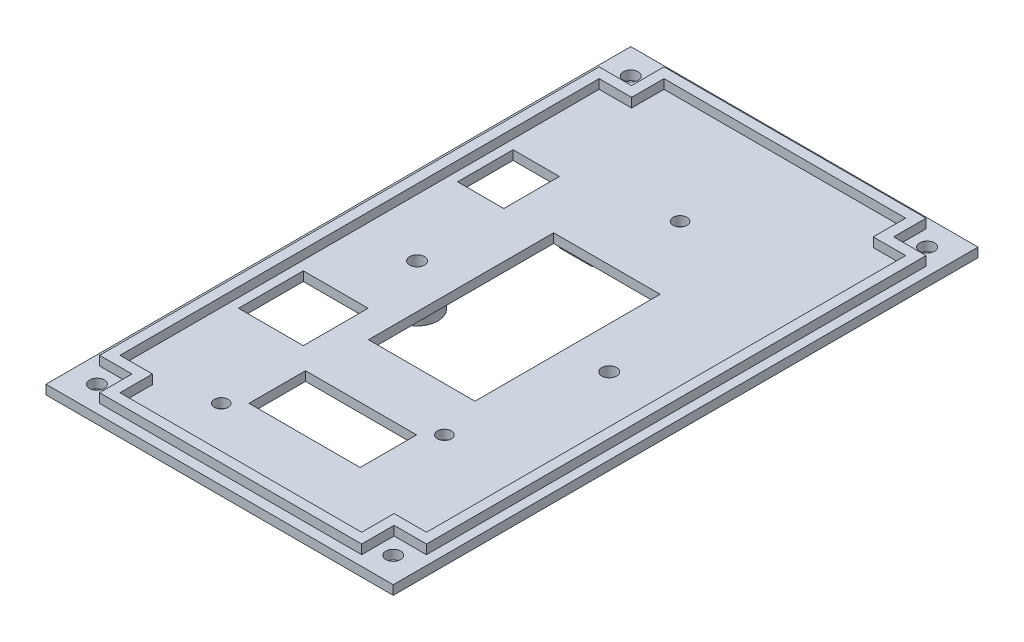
ISO-10303-21;
HEADER;
FILE_DESCRIPTION(('STEP AP214'),'2;1');
FILE_NAME('part.step','',(''),(''),'','','');
FILE_SCHEMA(('AUTOMOTIVE_DESIGN { 1 0 10303 214 1 1 1 1 }'));
ENDSEC;
DATA;
#1=APPLICATION_CONTEXT('core data for automotive mechanical design processes');
#2=APPLICATION_PROTOCOL_DEFINITION('international standard','automotive_design',2000,#1);
#3=PRODUCT_CONTEXT('',#1,'mechanical');
#4=PRODUCT('Part','Part','',(#3));
#5=PRODUCT_RELATED_PRODUCT_CATEGORY('part','',(#4));
#6=PRODUCT_DEFINITION_FORMATION('','',#4);
#7=PRODUCT_DEFINITION_CONTEXT('part definition',#1,'design');
#8=PRODUCT_DEFINITION('design','',#6,#7);
#9=PRODUCT_DEFINITION_SHAPE('','',#8);
#10=(LENGTH_UNIT() NAMED_UNIT(*) SI_UNIT(.MILLI.,.METRE.));
#11=(NAMED_UNIT(*) PLANE_ANGLE_UNIT() SI_UNIT($,.RADIAN.));
#12=(NAMED_UNIT(*) SI_UNIT($,.STERADIAN.) SOLID_ANGLE_UNIT());
#13=UNCERTAINTY_MEASURE_WITH_UNIT(LENGTH_MEASURE(1.E-05),#10,'distance_accuracy_value','');
#14=(GEOMETRIC_REPRESENTATION_CONTEXT(3) GLOBAL_UNCERTAINTY_ASSIGNED_CONTEXT((#13)) GLOBAL_UNIT_ASSIGNED_CONTEXT((#10,
#11,#12)) REPRESENTATION_CONTEXT('',''));
#15=CARTESIAN_POINT('',(0.,0.,0.));
#16=DIRECTION('',(0.,0.,1.));
#17=DIRECTION('',(1.,0.,0.));
#18=AXIS2_PLACEMENT_3D('',#15,#16,#17);
#19=CARTESIAN_POINT('',(0.,0.,0.));
#20=DIRECTION('',(0.,1.,0.));
#21=DIRECTION('',(0.,0.,1.));
#22=AXIS2_PLACEMENT_3D('',#19,#20,#21);
#23=PLANE('',#22);
#24=DIRECTION('',(1.,0.,0.));
#25=VECTOR('',#24,1.);
#26=CARTESIAN_POINT('',(0.,0.,-64.7222963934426));
#27=LINE('',#26,#25);
#28=CARTESIAN_POINT('',(-60.6700196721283,0.,-64.7222963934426));
#29=VERTEX_POINT('',#28);
#30=CARTESIAN_POINT('',(-50.6700196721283,0.,-64.7222963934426));
#31=VERTEX_POINT('',#30);
#32=EDGE_CURVE('E648',#29,#31,#27,.T.);
#33=ORIENTED_EDGE('',*,*,#32,.F.);
#34=DIRECTION('',(0.,0.,1.));
#35=VECTOR('',#34,1.);
#36=CARTESIAN_POINT('',(-60.6700196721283,0.,0.));
#37=LINE('',#36,#35);
#38=CARTESIAN_POINT('',(-60.6700196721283,0.,37.1777036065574));
#39=VERTEX_POINT('',#38);
#40=EDGE_CURVE('E566',#29,#39,#37,.T.);
#41=ORIENTED_EDGE('',*,*,#40,.T.);
#42=DIRECTION('',(1.,0.,0.));
#43=VECTOR('',#42,1.);
#44=CARTESIAN_POINT('',(0.,0.,37.1777036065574));
#45=LINE('',#44,#43);
#46=CARTESIAN_POINT('',(-50.6700196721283,0.,37.1777036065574));
#47=VERTEX_POINT('',#46);
#48=EDGE_CURVE('E675',#39,#47,#45,.T.);
#49=ORIENTED_EDGE('',*,*,#48,.T.);
#50=DIRECTION('',(0.,0.,-1.));
#51=VECTOR('',#50,1.);
#52=CARTESIAN_POINT('',(-50.6700196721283,0.,0.));
#53=LINE('',#52,#51);
#54=CARTESIAN_POINT('',(-50.6700196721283,0.,47.1777036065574));
#55=VERTEX_POINT('',#54);
#56=EDGE_CURVE('E52',#55,#47,#53,.T.);
#57=ORIENTED_EDGE('',*,*,#56,.F.);
#58=DIRECTION('',(1.,0.,0.));
#59=VECTOR('',#58,1.);
#60=CARTESIAN_POINT('',(0.,0.,47.1777036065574));
#61=LINE('',#60,#59);
#62=CARTESIAN_POINT('',(-0.0700196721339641,0.,47.1777036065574));
#63=VERTEX_POINT('',#62);
#64=EDGE_CURVE('E671',#55,#63,#61,.T.);
#65=ORIENTED_EDGE('',*,*,#64,.T.);
#66=DIRECTION('',(0.,0.,-1.));
#67=VECTOR('',#66,1.);
#68=CARTESIAN_POINT('',(-0.0700196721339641,0.,0.));
#69=LINE('',#68,#67);
#70=CARTESIAN_POINT('',(-0.0700196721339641,0.,37.1777036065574));
#71=VERTEX_POINT('',#70);
#72=EDGE_CURVE('E668',#63,#71,#69,.T.);
#73=ORIENTED_EDGE('',*,*,#72,.T.);
#74=DIRECTION('',(-1.,0.,0.));
#75=VECTOR('',#74,1.);
#76=CARTESIAN_POINT('',(0.,0.,37.1777036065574));
#77=LINE('',#76,#75);
#78=CARTESIAN_POINT('',(9.92998032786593,0.,37.1777036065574));
#79=VERTEX_POINT('',#78);
#80=EDGE_CURVE('E665',#79,#71,#77,.T.);
#81=ORIENTED_EDGE('',*,*,#80,.F.);
#82=DIRECTION('',(0.,0.,-1.));
#83=VECTOR('',#82,1.);
#84=CARTESIAN_POINT('',(9.92998032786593,0.,0.));
#85=LINE('',#84,#83);
#86=CARTESIAN_POINT('',(9.92998032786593,0.,-64.7222963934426));
#87=VERTEX_POINT('',#86);
#88=EDGE_CURVE('E662',#79,#87,#85,.T.);
#89=ORIENTED_EDGE('',*,*,#88,.T.);
#90=DIRECTION('',(-1.,0.,0.));
#91=VECTOR('',#90,1.);
#92=CARTESIAN_POINT('',(0.,0.,-64.7222963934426));
#93=LINE('',#92,#91);
#94=CARTESIAN_POINT('',(-0.0700196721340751,0.,-64.7222963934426));
#95=VERTEX_POINT('',#94);
#96=EDGE_CURVE('E659',#87,#95,#93,.T.);
#97=ORIENTED_EDGE('',*,*,#96,.T.);
#98=DIRECTION('',(0.,0.,1.));
#99=VECTOR('',#98,1.);
#100=CARTESIAN_POINT('',(-0.0700196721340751,0.,0.));
#101=LINE('',#100,#99);
#102=CARTESIAN_POINT('',(-0.0700196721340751,0.,-74.7222963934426));
#103=VERTEX_POINT('',#102);
#104=EDGE_CURVE('E656',#103,#95,#101,.T.);
#105=ORIENTED_EDGE('',*,*,#104,.F.);
#106=DIRECTION('',(-1.,0.,0.));
#107=VECTOR('',#106,1.);
#108=CARTESIAN_POINT('',(0.,0.,-74.7222963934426));
#109=LINE('',#108,#107);
#110=CARTESIAN_POINT('',(-50.6700196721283,0.,-74.7222963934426));
#111=VERTEX_POINT('',#110);
#112=EDGE_CURVE('E653',#103,#111,#109,.T.);
#113=ORIENTED_EDGE('',*,*,#112,.T.);
#114=DIRECTION('',(0.,0.,1.));
#115=VECTOR('',#114,1.);
#116=CARTESIAN_POINT('',(-50.6700196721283,0.,0.));
#117=LINE('',#116,#115);
#118=EDGE_CURVE('E650',#111,#31,#117,.T.);
#119=ORIENTED_EDGE('',*,*,#118,.T.);
#120=EDGE_LOOP('',(#33,#41,#49,#57,#65,#73,#81,#89,#97,#105,#113,#119));
#121=FACE_BOUND('',#120,.T.);
#122=DIRECTION('',(0.,0.,1.));
#123=VECTOR('',#122,1.);
#124=CARTESIAN_POINT('',(-62.8700196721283,0.,0.));
#125=LINE('',#124,#123);
#126=CARTESIAN_POINT('',(-62.8700196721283,0.,-76.9222963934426));
#127=VERTEX_POINT('',#126);
#128=CARTESIAN_POINT('',(-62.8700196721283,0.,49.3777036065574));
#129=VERTEX_POINT('',#128);
#130=EDGE_CURVE('E1271',#127,#129,#125,.T.);
#131=ORIENTED_EDGE('',*,*,#130,.F.);
#132=DIRECTION('',(-1.,0.,0.));
#133=VECTOR('',#132,1.);
#134=CARTESIAN_POINT('',(0.,0.,-76.9222963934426));
#135=LINE('',#134,#133);
#136=CARTESIAN_POINT('',(12.129980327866,0.,-76.9222963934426));
#137=VERTEX_POINT('',#136);
#138=EDGE_CURVE('E1241',#137,#127,#135,.T.);
#139=ORIENTED_EDGE('',*,*,#138,.F.);
#140=DIRECTION('',(0.,0.,-1.));
#141=VECTOR('',#140,1.);
#142=CARTESIAN_POINT('',(12.129980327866,0.,0.));
#143=LINE('',#142,#141);
#144=CARTESIAN_POINT('',(12.129980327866,0.,49.3777036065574));
#145=VERTEX_POINT('',#144);
#146=EDGE_CURVE('E1276',#145,#137,#143,.T.);
#147=ORIENTED_EDGE('',*,*,#146,.F.);
#148=DIRECTION('',(1.,0.,0.));
#149=VECTOR('',#148,1.);
#150=CARTESIAN_POINT('',(0.,0.,49.3777036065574));
#151=LINE('',#150,#149);
#152=EDGE_CURVE('E1274',#129,#145,#151,.T.);
#153=ORIENTED_EDGE('',*,*,#152,.F.);
#154=EDGE_LOOP('',(#131,#139,#147,#153));
#155=FACE_BOUND('',#154,.T.);
#156=CARTESIAN_POINT('',(-57.3700196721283,0.,43.8777036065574));
#157=DIRECTION('',(0.,1.,0.));
#158=DIRECTION('',(0.,0.,1.));
#159=AXIS2_PLACEMENT_3D('',#156,#157,#158);
#160=CIRCLE('',#159,1.6);
#161=CARTESIAN_POINT('',(-57.3700196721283,0.,45.4777036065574));
#162=VERTEX_POINT('',#161);
#163=EDGE_CURVE('E1268',#162,#162,#160,.T.);
#164=ORIENTED_EDGE('',*,*,#163,.T.);
#165=EDGE_LOOP('',(#164));
#166=FACE_BOUND('',#165,.T.);
#167=CARTESIAN_POINT('',(6.62998032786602,0.,43.8777036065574));
#168=DIRECTION('',(0.,1.,0.));
#169=DIRECTION('',(0.,0.,1.));
#170=AXIS2_PLACEMENT_3D('',#167,#168,#169);
#171=CIRCLE('',#170,1.6);
#172=CARTESIAN_POINT('',(6.62998032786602,0.,45.4777036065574));
#173=VERTEX_POINT('',#172);
#174=EDGE_CURVE('E1265',#173,#173,#171,.T.);
#175=ORIENTED_EDGE('',*,*,#174,.T.);
#176=EDGE_LOOP('',(#175));
#177=FACE_BOUND('',#176,.T.);
#178=CARTESIAN_POINT('',(6.62998032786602,0.,-71.4222963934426));
#179=DIRECTION('',(0.,1.,0.));
#180=DIRECTION('',(0.,0.,1.));
#181=AXIS2_PLACEMENT_3D('',#178,#179,#180);
#182=CIRCLE('',#181,1.6);
#183=CARTESIAN_POINT('',(6.62998032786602,0.,-69.8222963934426));
#184=VERTEX_POINT('',#183);
#185=EDGE_CURVE('E1262',#184,#184,#182,.T.);
#186=ORIENTED_EDGE('',*,*,#185,.T.);
#187=EDGE_LOOP('',(#186));
#188=FACE_BOUND('',#187,.T.);
#189=CARTESIAN_POINT('',(-57.3700196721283,0.,-71.4222963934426));
#190=DIRECTION('',(0.,1.,0.));
#191=DIRECTION('',(0.,0.,1.));
#192=AXIS2_PLACEMENT_3D('',#189,#190,#191);
#193=CIRCLE('',#192,1.6);
#194=CARTESIAN_POINT('',(-57.3700196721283,0.,-69.8222963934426));
#195=VERTEX_POINT('',#194);
#196=EDGE_CURVE('E1236',#195,#195,#193,.T.);
#197=ORIENTED_EDGE('',*,*,#196,.T.);
#198=EDGE_LOOP('',(#197));
#199=FACE_BOUND('',#198,.T.);
#200=ADVANCED_FACE('F37',(#121,#155,#166,#177,#188,#199),#23,.F.);
#201=DIRECTION('',(0.,0.,1.));
#202=VECTOR('',#201,1.);
#203=CARTESIAN_POINT('',(-58.6700196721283,0.,0.));
#204=LINE('',#203,#202);
#205=CARTESIAN_POINT('',(-58.6700196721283,0.,-62.7222963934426));
#206=VERTEX_POINT('',#205);
#207=CARTESIAN_POINT('',(-58.6700196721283,0.,35.1777036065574));
#208=VERTEX_POINT('',#207);
#209=EDGE_CURVE('E60',#206,#208,#204,.T.);
#210=ORIENTED_EDGE('',*,*,#209,.F.);
#211=DIRECTION('',(1.,0.,0.));
#212=VECTOR('',#211,1.);
#213=CARTESIAN_POINT('',(0.,0.,-62.7222963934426));
#214=LINE('',#213,#212);
#215=CARTESIAN_POINT('',(-48.6700196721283,0.,-62.7222963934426));
#216=VERTEX_POINT('',#215);
#217=EDGE_CURVE('E678',#206,#216,#214,.T.);
#218=ORIENTED_EDGE('',*,*,#217,.T.);
#219=DIRECTION('',(0.,0.,1.));
#220=VECTOR('',#219,1.);
#221=CARTESIAN_POINT('',(-48.6700196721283,0.,0.));
#222=LINE('',#221,#220);
#223=CARTESIAN_POINT('',(-48.6700196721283,0.,-72.7222963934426));
#224=VERTEX_POINT('',#223);
#225=EDGE_CURVE('E585',#224,#216,#222,.T.);
#226=ORIENTED_EDGE('',*,*,#225,.F.);
#227=DIRECTION('',(-1.,0.,0.));
#228=VECTOR('',#227,1.);
#229=CARTESIAN_POINT('',(0.,0.,-72.7222963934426));
#230=LINE('',#229,#228);
#231=CARTESIAN_POINT('',(-2.07001967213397,0.,-72.7222963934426));
#232=VERTEX_POINT('',#231);
#233=EDGE_CURVE('E588',#232,#224,#230,.T.);
#234=ORIENTED_EDGE('',*,*,#233,.F.);
#235=DIRECTION('',(0.,0.,1.));
#236=VECTOR('',#235,1.);
#237=CARTESIAN_POINT('',(-2.07001967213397,0.,0.));
#238=LINE('',#237,#236);
#239=CARTESIAN_POINT('',(-2.07001967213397,0.,-62.7222963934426));
#240=VERTEX_POINT('',#239);
#241=EDGE_CURVE('E700',#232,#240,#238,.T.);
#242=ORIENTED_EDGE('',*,*,#241,.T.);
#243=DIRECTION('',(-1.,0.,0.));
#244=VECTOR('',#243,1.);
#245=CARTESIAN_POINT('',(0.,0.,-62.7222963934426));
#246=LINE('',#245,#244);
#247=CARTESIAN_POINT('',(7.92998032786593,0.,-62.7222963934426));
#248=VERTEX_POINT('',#247);
#249=EDGE_CURVE('E697',#248,#240,#246,.T.);
#250=ORIENTED_EDGE('',*,*,#249,.F.);
#251=DIRECTION('',(0.,0.,-1.));
#252=VECTOR('',#251,1.);
#253=CARTESIAN_POINT('',(7.92998032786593,0.,0.));
#254=LINE('',#253,#252);
#255=CARTESIAN_POINT('',(7.92998032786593,0.,35.1777036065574));
#256=VERTEX_POINT('',#255);
#257=EDGE_CURVE('E694',#256,#248,#254,.T.);
#258=ORIENTED_EDGE('',*,*,#257,.F.);
#259=DIRECTION('',(-1.,0.,0.));
#260=VECTOR('',#259,1.);
#261=CARTESIAN_POINT('',(0.,0.,35.1777036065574));
#262=LINE('',#261,#260);
#263=CARTESIAN_POINT('',(-2.07001967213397,0.,35.1777036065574));
#264=VERTEX_POINT('',#263);
#265=EDGE_CURVE('E692',#256,#264,#262,.T.);
#266=ORIENTED_EDGE('',*,*,#265,.T.);
#267=DIRECTION('',(0.,0.,-1.));
#268=VECTOR('',#267,1.);
#269=CARTESIAN_POINT('',(-2.07001967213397,0.,0.));
#270=LINE('',#269,#268);
#271=CARTESIAN_POINT('',(-2.07001967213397,0.,45.1777036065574));
#272=VERTEX_POINT('',#271);
#273=EDGE_CURVE('E689',#272,#264,#270,.T.);
#274=ORIENTED_EDGE('',*,*,#273,.F.);
#275=DIRECTION('',(1.,0.,0.));
#276=VECTOR('',#275,1.);
#277=CARTESIAN_POINT('',(0.,0.,45.1777036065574));
#278=LINE('',#277,#276);
#279=CARTESIAN_POINT('',(-48.6700196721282,0.,45.1777036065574));
#280=VERTEX_POINT('',#279);
#281=EDGE_CURVE('E686',#280,#272,#278,.T.);
#282=ORIENTED_EDGE('',*,*,#281,.F.);
#283=DIRECTION('',(0.,0.,-1.));
#284=VECTOR('',#283,1.);
#285=CARTESIAN_POINT('',(-48.6700196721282,0.,0.));
#286=LINE('',#285,#284);
#287=CARTESIAN_POINT('',(-48.6700196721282,0.,35.1777036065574));
#288=VERTEX_POINT('',#287);
#289=EDGE_CURVE('E684',#280,#288,#286,.T.);
#290=ORIENTED_EDGE('',*,*,#289,.T.);
#291=DIRECTION('',(1.,0.,0.));
#292=VECTOR('',#291,1.);
#293=CARTESIAN_POINT('',(0.,0.,35.1777036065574));
#294=LINE('',#293,#292);
#295=EDGE_CURVE('E681',#208,#288,#294,.T.);
#296=ORIENTED_EDGE('',*,*,#295,.F.);
#297=EDGE_LOOP('',(#210,#218,#226,#234,#242,#250,#258,#266,#274,#282,#290,#296));
#298=FACE_BOUND('',#297,.T.);
#299=DIRECTION('',(0.,0.,-1.));
#300=VECTOR('',#299,1.);
#301=CARTESIAN_POINT('',(-46.2909711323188,0.,0.));
#302=LINE('',#301,#300);
#303=CARTESIAN_POINT('',(-46.2909711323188,0.,-32.9222963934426));
#304=VERTEX_POINT('',#303);
#305=CARTESIAN_POINT('',(-46.2909711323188,0.,-44.9222963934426));
#306=VERTEX_POINT('',#305);
#307=EDGE_CURVE('E738',#304,#306,#302,.T.);
#308=ORIENTED_EDGE('',*,*,#307,.T.);
#309=DIRECTION('',(1.,0.,0.));
#310=VECTOR('',#309,1.);
#311=CARTESIAN_POINT('',(0.,0.,-44.9222963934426));
#312=LINE('',#311,#310);
#313=CARTESIAN_POINT('',(-56.2909711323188,0.,-44.9222963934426));
#314=VERTEX_POINT('',#313);
#315=EDGE_CURVE('E795',#314,#306,#312,.T.);
#316=ORIENTED_EDGE('',*,*,#315,.F.);
#317=DIRECTION('',(0.,0.,-1.));
#318=VECTOR('',#317,1.);
#319=CARTESIAN_POINT('',(-56.2909711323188,0.,0.));
#320=LINE('',#319,#318);
#321=CARTESIAN_POINT('',(-56.2909711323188,0.,-32.9222963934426));
#322=VERTEX_POINT('',#321);
#323=EDGE_CURVE('E809',#322,#314,#320,.T.);
#324=ORIENTED_EDGE('',*,*,#323,.F.);
#325=DIRECTION('',(1.,0.,0.));
#326=VECTOR('',#325,1.);
#327=CARTESIAN_POINT('',(0.,0.,-32.9222963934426));
#328=LINE('',#327,#326);
#329=EDGE_CURVE('E806',#322,#304,#328,.T.);
#330=ORIENTED_EDGE('',*,*,#329,.T.);
#331=EDGE_LOOP('',(#308,#316,#324,#330));
#332=FACE_BOUND('',#331,.T.);
#333=DIRECTION('',(-1.,0.,0.));
#334=VECTOR('',#333,1.);
#335=CARTESIAN_POINT('',(0.,0.,-56.5722963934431));
#336=LINE('',#335,#334);
#337=CARTESIAN_POINT('',(-34.8700196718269,0.,-56.5722963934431));
#338=VERTEX_POINT('',#337);
#339=CARTESIAN_POINT('',(-39.870019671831,0.,-56.5722963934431));
#340=VERTEX_POINT('',#339);
#341=EDGE_CURVE('E846',#338,#340,#336,.T.);
#342=ORIENTED_EDGE('',*,*,#341,.F.);
#343=DIRECTION('',(0.,0.,-1.));
#344=VECTOR('',#343,1.);
#345=CARTESIAN_POINT('',(-34.8700196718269,0.,0.));
#346=LINE('',#345,#344);
#347=CARTESIAN_POINT('',(-34.8700196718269,0.,-58.5722963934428));
#348=VERTEX_POINT('',#347);
#349=EDGE_CURVE('E785',#338,#348,#346,.T.);
#350=ORIENTED_EDGE('',*,*,#349,.T.);
#351=DIRECTION('',(-1.,0.,0.));
#352=VECTOR('',#351,1.);
#353=CARTESIAN_POINT('',(0.,0.,-58.5722963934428));
#354=LINE('',#353,#352);
#355=CARTESIAN_POINT('',(-41.8700196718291,0.,-58.5722963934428));
#356=VERTEX_POINT('',#355);
#357=EDGE_CURVE('E825',#348,#356,#354,.T.);
#358=ORIENTED_EDGE('',*,*,#357,.T.);
#359=DIRECTION('',(0.,0.,1.));
#360=VECTOR('',#359,1.);
#361=CARTESIAN_POINT('',(-41.8700196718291,0.,0.));
#362=LINE('',#361,#360);
#363=CARTESIAN_POINT('',(-41.8700196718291,0.,-40.5722963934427));
#364=VERTEX_POINT('',#363);
#365=EDGE_CURVE('E860',#356,#364,#362,.T.);
#366=ORIENTED_EDGE('',*,*,#365,.T.);
#367=DIRECTION('',(-1.,0.,0.));
#368=VECTOR('',#367,1.);
#369=CARTESIAN_POINT('',(0.,0.,-40.5722963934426));
#370=LINE('',#369,#368);
#371=CARTESIAN_POINT('',(-34.8700196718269,0.,-40.5722963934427));
#372=VERTEX_POINT('',#371);
#373=EDGE_CURVE('E857',#372,#364,#370,.T.);
#374=ORIENTED_EDGE('',*,*,#373,.F.);
#375=DIRECTION('',(0.,0.,-1.));
#376=VECTOR('',#375,1.);
#377=CARTESIAN_POINT('',(-34.8700196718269,0.,0.));
#378=LINE('',#377,#376);
#379=CARTESIAN_POINT('',(-34.8700196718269,0.,-42.5722963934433));
#380=VERTEX_POINT('',#379);
#381=EDGE_CURVE('E854',#372,#380,#378,.T.);
#382=ORIENTED_EDGE('',*,*,#381,.T.);
#383=DIRECTION('',(-1.,0.,0.));
#384=VECTOR('',#383,1.);
#385=CARTESIAN_POINT('',(0.,0.,-42.5722963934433));
#386=LINE('',#385,#384);
#387=CARTESIAN_POINT('',(-39.870019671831,0.,-42.5722963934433));
#388=VERTEX_POINT('',#387);
#389=EDGE_CURVE('E851',#380,#388,#386,.T.);
#390=ORIENTED_EDGE('',*,*,#389,.T.);
#391=DIRECTION('',(0.,0.,1.));
#392=VECTOR('',#391,1.);
#393=CARTESIAN_POINT('',(-39.870019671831,0.,0.));
#394=LINE('',#393,#392);
#395=EDGE_CURVE('E848',#340,#388,#394,.T.);
#396=ORIENTED_EDGE('',*,*,#395,.F.);
#397=EDGE_LOOP('',(#342,#350,#358,#366,#374,#382,#390,#396));
#398=FACE_BOUND('',#397,.T.);
#399=DIRECTION('',(0.,0.,-1.));
#400=VECTOR('',#399,1.);
#401=CARTESIAN_POINT('',(-13.3700196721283,0.,0.));
#402=LINE('',#401,#400);
#403=CARTESIAN_POINT('',(-13.3700196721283,0.,6.22770360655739));
#404=VERTEX_POINT('',#403);
#405=CARTESIAN_POINT('',(-13.3700196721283,0.,-33.7722963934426));
#406=VERTEX_POINT('',#405);
#407=EDGE_CURVE('E955',#404,#406,#402,.T.);
#408=ORIENTED_EDGE('',*,*,#407,.T.);
#409=DIRECTION('',(1.,0.,0.));
#410=VECTOR('',#409,1.);
#411=CARTESIAN_POINT('',(0.,0.,-33.7722963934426));
#412=LINE('',#411,#410);
#413=CARTESIAN_POINT('',(-36.3700196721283,0.,-33.7722963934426));
#414=VERTEX_POINT('',#413);
#415=EDGE_CURVE('E975',#414,#406,#412,.T.);
#416=ORIENTED_EDGE('',*,*,#415,.F.);
#417=DIRECTION('',(0.,0.,-1.));
#418=VECTOR('',#417,1.);
#419=CARTESIAN_POINT('',(-36.3700196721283,0.,0.));
#420=LINE('',#419,#418);
#421=CARTESIAN_POINT('',(-36.3700196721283,0.,6.22770360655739));
#422=VERTEX_POINT('',#421);
#423=EDGE_CURVE('E989',#422,#414,#420,.T.);
#424=ORIENTED_EDGE('',*,*,#423,.F.);
#425=DIRECTION('',(1.,0.,0.));
#426=VECTOR('',#425,1.);
#427=CARTESIAN_POINT('',(0.,0.,6.22770360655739));
#428=LINE('',#427,#426);
#429=EDGE_CURVE('E986',#422,#404,#428,.T.);
#430=ORIENTED_EDGE('',*,*,#429,.T.);
#431=EDGE_LOOP('',(#408,#416,#424,#430));
#432=FACE_BOUND('',#431,.T.);
#433=CARTESIAN_POINT('',(-24.8700196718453,0.,-49.5722963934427));
#434=DIRECTION('',(0.,-1.,0.));
#435=DIRECTION('',(0.,0.,-1.));
#436=AXIS2_PLACEMENT_3D('',#433,#434,#435);
#437=CIRCLE('',#436,1.5);
#438=CARTESIAN_POINT('',(-24.8700196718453,0.,-51.0722963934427));
#439=VERTEX_POINT('',#438);
#440=EDGE_CURVE('E968',#439,#439,#437,.T.);
#441=ORIENTED_EDGE('',*,*,#440,.F.);
#442=EDGE_LOOP('',(#441));
#443=FACE_BOUND('',#442,.T.);
#444=CARTESIAN_POINT('',(-10.370019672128,0.,15.8277036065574));
#445=DIRECTION('',(0.,-1.,0.));
#446=DIRECTION('',(0.,0.,-1.));
#447=AXIS2_PLACEMENT_3D('',#444,#445,#446);
#448=CIRCLE('',#447,1.50000000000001);
#449=CARTESIAN_POINT('',(-10.370019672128,0.,14.3277036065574));
#450=VERTEX_POINT('',#449);
#451=EDGE_CURVE('E1003',#450,#450,#448,.T.);
#452=ORIENTED_EDGE('',*,*,#451,.F.);
#453=EDGE_LOOP('',(#452));
#454=FACE_BOUND('',#453,.T.);
#455=DIRECTION('',(-1.,0.,0.));
#456=VECTOR('',#455,1.);
#457=CARTESIAN_POINT('',(0.,0.,18.8277036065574));
#458=LINE('',#457,#456);
#459=CARTESIAN_POINT('',(-13.3700196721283,0.,18.8277036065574));
#460=VERTEX_POINT('',#459);
#461=CARTESIAN_POINT('',(-37.3700196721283,0.,18.8277036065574));
#462=VERTEX_POINT('',#461);
#463=EDGE_CURVE('E1019',#460,#462,#458,.T.);
#464=ORIENTED_EDGE('',*,*,#463,.T.);
#465=DIRECTION('',(0.,0.,-1.));
#466=VECTOR('',#465,1.);
#467=CARTESIAN_POINT('',(-37.3700196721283,0.,0.));
#468=LINE('',#467,#466);
#469=CARTESIAN_POINT('',(-37.3700196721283,0.,31.0277036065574));
#470=VERTEX_POINT('',#469);
#471=EDGE_CURVE('E1010',#470,#462,#468,.T.);
#472=ORIENTED_EDGE('',*,*,#471,.F.);
#473=DIRECTION('',(-1.,0.,0.));
#474=VECTOR('',#473,1.);
#475=CARTESIAN_POINT('',(0.,0.,31.0277036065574));
#476=LINE('',#475,#474);
#477=CARTESIAN_POINT('',(-13.3700196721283,0.,31.0277036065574));
#478=VERTEX_POINT('',#477);
#479=EDGE_CURVE('E1026',#478,#470,#476,.T.);
#480=ORIENTED_EDGE('',*,*,#479,.F.);
#481=DIRECTION('',(0.,0.,-1.));
#482=VECTOR('',#481,1.);
#483=CARTESIAN_POINT('',(-13.3700196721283,0.,0.));
#484=LINE('',#483,#482);
#485=EDGE_CURVE('E1022',#478,#460,#484,.T.);
#486=ORIENTED_EDGE('',*,*,#485,.T.);
#487=EDGE_LOOP('',(#464,#472,#480,#486));
#488=FACE_BOUND('',#487,.T.);
#489=CARTESIAN_POINT('',(-40.3700196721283,0.,34.0277036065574));
#490=DIRECTION('',(0.,-1.,0.));
#491=DIRECTION('',(0.,0.,-1.));
#492=AXIS2_PLACEMENT_3D('',#489,#490,#491);
#493=CIRCLE('',#492,1.5);
#494=CARTESIAN_POINT('',(-40.3700196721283,0.,32.5277036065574));
#495=VERTEX_POINT('',#494);
#496=EDGE_CURVE('E960',#495,#495,#493,.T.);
#497=ORIENTED_EDGE('',*,*,#496,.F.);
#498=EDGE_LOOP('',(#497));
#499=FACE_BOUND('',#498,.T.);
#500=CARTESIAN_POINT('',(-45.8700196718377,0.,-13.7722963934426));
#501=DIRECTION('',(0.,1.,0.));
#502=DIRECTION('',(0.,0.,1.));
#503=AXIS2_PLACEMENT_3D('',#500,#501,#502);
#504=CIRCLE('',#503,4.5);
#505=CARTESIAN_POINT('',(-45.8700196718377,0.,-9.27229639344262));
#506=VERTEX_POINT('',#505);
#507=EDGE_CURVE('E45',#506,#506,#504,.F.);
#508=ORIENTED_EDGE('',*,*,#507,.F.);
#509=EDGE_LOOP('',(#508));
#510=FACE_BOUND('',#509,.T.);
#511=CARTESIAN_POINT('',(-4.37001967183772,0.,-13.7722963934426));
#512=DIRECTION('',(0.,1.,0.));
#513=DIRECTION('',(0.,0.,1.));
#514=AXIS2_PLACEMENT_3D('',#511,#512,#513);
#515=CIRCLE('',#514,4.5);
#516=CARTESIAN_POINT('',(-4.37001967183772,0.,-9.27229639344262));
#517=VERTEX_POINT('',#516);
#518=EDGE_CURVE('E11',#517,#517,#515,.F.);
#519=ORIENTED_EDGE('',*,*,#518,.F.);
#520=EDGE_LOOP('',(#519));
#521=FACE_BOUND('',#520,.T.);
#522=DIRECTION('',(-1.,0.,0.));
#523=VECTOR('',#522,1.);
#524=CARTESIAN_POINT('',(0.,0.,-56.5722963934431));
#525=LINE('',#524,#523);
#526=CARTESIAN_POINT('',(-10.8700196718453,0.,-56.5722963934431));
#527=VERTEX_POINT('',#526);
#528=CARTESIAN_POINT('',(-15.8700196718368,0.,-56.5722963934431));
#529=VERTEX_POINT('',#528);
#530=EDGE_CURVE('E882',#527,#529,#525,.T.);
#531=ORIENTED_EDGE('',*,*,#530,.F.);
#532=DIRECTION('',(0.,0.,1.));
#533=VECTOR('',#532,1.);
#534=CARTESIAN_POINT('',(-10.8700196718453,0.,0.));
#535=LINE('',#534,#533);
#536=CARTESIAN_POINT('',(-10.8700196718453,0.,-42.5722963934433));
#537=VERTEX_POINT('',#536);
#538=EDGE_CURVE('E887',#527,#537,#535,.T.);
#539=ORIENTED_EDGE('',*,*,#538,.T.);
#540=DIRECTION('',(-1.,0.,0.));
#541=VECTOR('',#540,1.);
#542=CARTESIAN_POINT('',(0.,0.,-42.5722963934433));
#543=LINE('',#542,#541);
#544=CARTESIAN_POINT('',(-15.8700196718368,0.,-42.5722963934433));
#545=VERTEX_POINT('',#544);
#546=EDGE_CURVE('E920',#537,#545,#543,.T.);
#547=ORIENTED_EDGE('',*,*,#546,.T.);
#548=DIRECTION('',(0.,0.,-1.));
#549=VECTOR('',#548,1.);
#550=CARTESIAN_POINT('',(-15.8700196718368,0.,0.));
#551=LINE('',#550,#549);
#552=CARTESIAN_POINT('',(-15.8700196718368,0.,-40.5722963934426));
#553=VERTEX_POINT('',#552);
#554=EDGE_CURVE('E917',#553,#545,#551,.T.);
#555=ORIENTED_EDGE('',*,*,#554,.F.);
#556=DIRECTION('',(-1.,0.,0.));
#557=VECTOR('',#556,1.);
#558=CARTESIAN_POINT('',(0.,0.,-40.5722963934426));
#559=LINE('',#558,#557);
#560=CARTESIAN_POINT('',(-8.87001967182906,0.,-40.5722963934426));
#561=VERTEX_POINT('',#560);
#562=EDGE_CURVE('E915',#561,#553,#559,.T.);
#563=ORIENTED_EDGE('',*,*,#562,.F.);
#564=DIRECTION('',(0.,0.,1.));
#565=VECTOR('',#564,1.);
#566=CARTESIAN_POINT('',(-8.87001967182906,0.,0.));
#567=LINE('',#566,#565);
#568=CARTESIAN_POINT('',(-8.87001967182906,0.,-58.5722963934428));
#569=VERTEX_POINT('',#568);
#570=EDGE_CURVE('E913',#569,#561,#567,.T.);
#571=ORIENTED_EDGE('',*,*,#570,.F.);
#572=DIRECTION('',(-1.,0.,0.));
#573=VECTOR('',#572,1.);
#574=CARTESIAN_POINT('',(0.,0.,-58.5722963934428));
#575=LINE('',#574,#573);
#576=CARTESIAN_POINT('',(-15.8700196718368,0.,-58.5722963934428));
#577=VERTEX_POINT('',#576);
#578=EDGE_CURVE('E910',#569,#577,#575,.T.);
#579=ORIENTED_EDGE('',*,*,#578,.T.);
#580=DIRECTION('',(0.,0.,-1.));
#581=VECTOR('',#580,1.);
#582=CARTESIAN_POINT('',(-15.8700196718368,0.,0.));
#583=LINE('',#582,#581);
#584=EDGE_CURVE('E907',#529,#577,#583,.T.);
#585=ORIENTED_EDGE('',*,*,#584,.F.);
#586=EDGE_LOOP('',(#531,#539,#547,#555,#563,#571,#579,#585));
#587=FACE_BOUND('',#586,.T.);
#588=DIRECTION('',(0.,0.,-1.));
#589=VECTOR('',#588,1.);
#590=CARTESIAN_POINT('',(-42.2909711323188,0.,0.));
#591=LINE('',#590,#589);
#592=CARTESIAN_POINT('',(-42.2909711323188,0.,14.3777036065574));
#593=VERTEX_POINT('',#592);
#594=CARTESIAN_POINT('',(-42.2909711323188,0.,0.377703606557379));
#595=VERTEX_POINT('',#594);
#596=EDGE_CURVE('E771',#593,#595,#591,.T.);
#597=ORIENTED_EDGE('',*,*,#596,.T.);
#598=DIRECTION('',(1.,0.,0.));
#599=VECTOR('',#598,1.);
#600=CARTESIAN_POINT('',(0.,0.,0.377703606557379));
#601=LINE('',#600,#599);
#602=CARTESIAN_POINT('',(-56.2909711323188,0.,0.377703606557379));
#603=VERTEX_POINT('',#602);
#604=EDGE_CURVE('E762',#603,#595,#601,.T.);
#605=ORIENTED_EDGE('',*,*,#604,.F.);
#606=DIRECTION('',(0.,0.,-1.));
#607=VECTOR('',#606,1.);
#608=CARTESIAN_POINT('',(-56.2909711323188,0.,0.));
#609=LINE('',#608,#607);
#610=CARTESIAN_POINT('',(-56.2909711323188,0.,14.3777036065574));
#611=VERTEX_POINT('',#610);
#612=EDGE_CURVE('E778',#611,#603,#609,.T.);
#613=ORIENTED_EDGE('',*,*,#612,.F.);
#614=DIRECTION('',(1.,0.,0.));
#615=VECTOR('',#614,1.);
#616=CARTESIAN_POINT('',(0.,0.,14.3777036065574));
#617=LINE('',#616,#615);
#618=EDGE_CURVE('E774',#611,#593,#617,.T.);
#619=ORIENTED_EDGE('',*,*,#618,.T.);
#620=EDGE_LOOP('',(#597,#605,#613,#619));
#621=FACE_BOUND('',#620,.T.);
#622=ADVANCED_FACE('F1294',(#298,#332,#398,#432,#443,#454,#488,#499,#510,#521,#587,#621),#23,.F.);
#623=CARTESIAN_POINT('',(0.,2.,0.));
#624=DIRECTION('',(0.,1.,0.));
#625=DIRECTION('',(0.,0.,1.));
#626=AXIS2_PLACEMENT_3D('',#623,#624,#625);
#627=PLANE('',#626);
#628=DIRECTION('',(0.,0.,-1.));
#629=VECTOR('',#628,1.);
#630=CARTESIAN_POINT('',(-13.3700196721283,2.,0.));
#631=LINE('',#630,#629);
#632=CARTESIAN_POINT('',(-13.3700196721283,2.,6.22770360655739));
#633=VERTEX_POINT('',#632);
#634=CARTESIAN_POINT('',(-13.3700196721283,2.,-33.7722963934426));
#635=VERTEX_POINT('',#634);
#636=EDGE_CURVE('E972',#633,#635,#631,.T.);
#637=ORIENTED_EDGE('',*,*,#636,.F.);
#638=DIRECTION('',(1.,0.,0.));
#639=VECTOR('',#638,1.);
#640=CARTESIAN_POINT('',(0.,2.,6.22770360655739));
#641=LINE('',#640,#639);
#642=CARTESIAN_POINT('',(-36.3700196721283,2.,6.22770360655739));
#643=VERTEX_POINT('',#642);
#644=EDGE_CURVE('E974',#643,#633,#641,.T.);
#645=ORIENTED_EDGE('',*,*,#644,.F.);
#646=DIRECTION('',(0.,0.,-1.));
#647=VECTOR('',#646,1.);
#648=CARTESIAN_POINT('',(-36.3700196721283,2.,0.));
#649=LINE('',#648,#647);
#650=CARTESIAN_POINT('',(-36.3700196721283,2.,-33.7722963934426));
#651=VERTEX_POINT('',#650);
#652=EDGE_CURVE('E977',#643,#651,#649,.T.);
#653=ORIENTED_EDGE('',*,*,#652,.T.);
#654=DIRECTION('',(1.,0.,0.));
#655=VECTOR('',#654,1.);
#656=CARTESIAN_POINT('',(0.,2.,-33.7722963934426));
#657=LINE('',#656,#655);
#658=EDGE_CURVE('E980',#651,#635,#657,.T.);
#659=ORIENTED_EDGE('',*,*,#658,.T.);
#660=EDGE_LOOP('',(#637,#645,#653,#659));
#661=FACE_BOUND('',#660,.T.);
#662=CARTESIAN_POINT('',(-40.3700196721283,2.,34.0277036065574));
#663=DIRECTION('',(0.,-1.,0.));
#664=DIRECTION('',(0.,0.,-1.));
#665=AXIS2_PLACEMENT_3D('',#662,#663,#664);
#666=CIRCLE('',#665,1.5);
#667=CARTESIAN_POINT('',(-40.3700196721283,2.,32.5277036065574));
#668=VERTEX_POINT('',#667);
#669=EDGE_CURVE('E956',#668,#668,#666,.T.);
#670=ORIENTED_EDGE('',*,*,#669,.T.);
#671=EDGE_LOOP('',(#670));
#672=FACE_BOUND('',#671,.T.);
#673=CARTESIAN_POINT('',(-24.8700196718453,2.,-49.5722963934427));
#674=DIRECTION('',(0.,-1.,0.));
#675=DIRECTION('',(0.,0.,-1.));
#676=AXIS2_PLACEMENT_3D('',#673,#674,#675);
#677=CIRCLE('',#676,1.5);
#678=CARTESIAN_POINT('',(-24.8700196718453,2.,-51.0722963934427));
#679=VERTEX_POINT('',#678);
#680=EDGE_CURVE('E964',#679,#679,#677,.T.);
#681=ORIENTED_EDGE('',*,*,#680,.T.);
#682=EDGE_LOOP('',(#681));
#683=FACE_BOUND('',#682,.T.);
#684=CARTESIAN_POINT('',(-4.37001967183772,2.,-13.7722963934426));
#685=DIRECTION('',(0.,-1.,0.));
#686=DIRECTION('',(0.,0.,-1.));
#687=AXIS2_PLACEMENT_3D('',#684,#685,#686);
#688=CIRCLE('',#687,1.6);
#689=CARTESIAN_POINT('',(-4.37001967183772,2.,-15.3722963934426));
#690=VERTEX_POINT('',#689);
#691=EDGE_CURVE('E967',#690,#690,#688,.T.);
#692=ORIENTED_EDGE('',*,*,#691,.T.);
#693=EDGE_LOOP('',(#692));
#694=FACE_BOUND('',#693,.T.);
#695=CARTESIAN_POINT('',(-45.8700196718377,2.,-13.7722963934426));
#696=DIRECTION('',(0.,-1.,0.));
#697=DIRECTION('',(0.,0.,-1.));
#698=AXIS2_PLACEMENT_3D('',#695,#696,#697);
#699=CIRCLE('',#698,1.6);
#700=CARTESIAN_POINT('',(-45.8700196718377,2.,-15.3722963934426));
#701=VERTEX_POINT('',#700);
#702=EDGE_CURVE('E1023',#701,#701,#699,.T.);
#703=ORIENTED_EDGE('',*,*,#702,.T.);
#704=EDGE_LOOP('',(#703));
#705=FACE_BOUND('',#704,.T.);
#706=CARTESIAN_POINT('',(-10.370019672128,2.,15.8277036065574));
#707=DIRECTION('',(0.,-1.,0.));
#708=DIRECTION('',(0.,0.,-1.));
#709=AXIS2_PLACEMENT_3D('',#706,#707,#708);
#710=CIRCLE('',#709,1.50000000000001);
#711=CARTESIAN_POINT('',(-10.370019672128,2.,14.3277036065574));
#712=VERTEX_POINT('',#711);
#713=EDGE_CURVE('E963',#712,#712,#710,.T.);
#714=ORIENTED_EDGE('',*,*,#713,.T.);
#715=EDGE_LOOP('',(#714));
#716=FACE_BOUND('',#715,.T.);
#717=DIRECTION('',(1.,0.,0.));
#718=VECTOR('',#717,1.);
#719=CARTESIAN_POINT('',(0.,2.,-72.5222963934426));
#720=LINE('',#719,#718);
#721=CARTESIAN_POINT('',(-51.2909711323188,2.,-72.5222963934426));
#722=VERTEX_POINT('',#721);
#723=CARTESIAN_POINT('',(0.909028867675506,2.,-72.5222963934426));
#724=VERTEX_POINT('',#723);
#725=EDGE_CURVE('E1233',#722,#724,#720,.T.);
#726=ORIENTED_EDGE('',*,*,#725,.F.);
#727=DIRECTION('',(0.,0.,-1.));
#728=VECTOR('',#727,1.);
#729=CARTESIAN_POINT('',(-51.2909711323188,2.,0.));
#730=LINE('',#729,#728);
#731=CARTESIAN_POINT('',(-51.2909711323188,2.,-65.5222963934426));
#732=VERTEX_POINT('',#731);
#733=EDGE_CURVE('E1139',#732,#722,#730,.T.);
#734=ORIENTED_EDGE('',*,*,#733,.F.);
#735=DIRECTION('',(-1.,0.,0.));
#736=VECTOR('',#735,1.);
#737=CARTESIAN_POINT('',(0.,2.,-65.5222963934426));
#738=LINE('',#737,#736);
#739=CARTESIAN_POINT('',(-58.2909711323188,2.,-65.5222963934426));
#740=VERTEX_POINT('',#739);
#741=EDGE_CURVE('E1207',#732,#740,#738,.T.);
#742=ORIENTED_EDGE('',*,*,#741,.T.);
#743=DIRECTION('',(0.,0.,-1.));
#744=VECTOR('',#743,1.);
#745=CARTESIAN_POINT('',(-58.2909711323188,2.,0.));
#746=LINE('',#745,#744);
#747=CARTESIAN_POINT('',(-58.2909711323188,2.,37.9777036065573));
#748=VERTEX_POINT('',#747);
#749=EDGE_CURVE('E1209',#748,#740,#746,.T.);
#750=ORIENTED_EDGE('',*,*,#749,.F.);
#751=DIRECTION('',(-1.,0.,0.));
#752=VECTOR('',#751,1.);
#753=CARTESIAN_POINT('',(0.,2.,37.9777036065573));
#754=LINE('',#753,#752);
#755=CARTESIAN_POINT('',(-51.2909711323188,2.,37.9777036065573));
#756=VERTEX_POINT('',#755);
#757=EDGE_CURVE('E1212',#756,#748,#754,.T.);
#758=ORIENTED_EDGE('',*,*,#757,.F.);
#759=DIRECTION('',(0.,0.,1.));
#760=VECTOR('',#759,1.);
#761=CARTESIAN_POINT('',(-51.2909711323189,2.,1.01686459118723E-13));
#762=LINE('',#761,#760);
#763=CARTESIAN_POINT('',(-51.2909711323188,2.,44.9777036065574));
#764=VERTEX_POINT('',#763);
#765=EDGE_CURVE('E1215',#756,#764,#762,.T.);
#766=ORIENTED_EDGE('',*,*,#765,.T.);
#767=DIRECTION('',(-1.,0.,0.));
#768=VECTOR('',#767,1.);
#769=CARTESIAN_POINT('',(0.,2.,44.9777036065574));
#770=LINE('',#769,#768);
#771=CARTESIAN_POINT('',(0.909028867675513,2.,44.9777036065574));
#772=VERTEX_POINT('',#771);
#773=EDGE_CURVE('E1217',#772,#764,#770,.T.);
#774=ORIENTED_EDGE('',*,*,#773,.F.);
#775=DIRECTION('',(0.,0.,1.));
#776=VECTOR('',#775,1.);
#777=CARTESIAN_POINT('',(0.909028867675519,2.,0.));
#778=LINE('',#777,#776);
#779=CARTESIAN_POINT('',(0.909028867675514,2.,37.9777036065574));
#780=VERTEX_POINT('',#779);
#781=EDGE_CURVE('E1220',#780,#772,#778,.T.);
#782=ORIENTED_EDGE('',*,*,#781,.F.);
#783=DIRECTION('',(1.,0.,0.));
#784=VECTOR('',#783,1.);
#785=CARTESIAN_POINT('',(0.,2.,37.9777036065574));
#786=LINE('',#785,#784);
#787=CARTESIAN_POINT('',(7.9090288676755,2.,37.9777036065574));
#788=VERTEX_POINT('',#787);
#789=EDGE_CURVE('E1223',#780,#788,#786,.T.);
#790=ORIENTED_EDGE('',*,*,#789,.T.);
#791=DIRECTION('',(0.,0.,1.));
#792=VECTOR('',#791,1.);
#793=CARTESIAN_POINT('',(7.9090288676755,2.,0.));
#794=LINE('',#793,#792);
#795=CARTESIAN_POINT('',(7.9090288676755,2.,-65.5222963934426));
#796=VERTEX_POINT('',#795);
#797=EDGE_CURVE('E1225',#796,#788,#794,.T.);
#798=ORIENTED_EDGE('',*,*,#797,.F.);
#799=DIRECTION('',(1.,0.,0.));
#800=VECTOR('',#799,1.);
#801=CARTESIAN_POINT('',(0.,2.,-65.5222963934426));
#802=LINE('',#801,#800);
#803=CARTESIAN_POINT('',(0.909028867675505,2.,-65.5222963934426));
#804=VERTEX_POINT('',#803);
#805=EDGE_CURVE('E1228',#804,#796,#802,.T.);
#806=ORIENTED_EDGE('',*,*,#805,.F.);
#807=DIRECTION('',(0.,0.,-1.));
#808=VECTOR('',#807,1.);
#809=CARTESIAN_POINT('',(0.909028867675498,2.,0.));
#810=LINE('',#809,#808);
#811=EDGE_CURVE('E1231',#804,#724,#810,.T.);
#812=ORIENTED_EDGE('',*,*,#811,.T.);
#813=EDGE_LOOP('',(#726,#734,#742,#750,#758,#766,#774,#782,#790,#798,#806,#812));
#814=FACE_BOUND('',#813,.T.);
#815=DIRECTION('',(0.,0.,-1.));
#816=VECTOR('',#815,1.);
#817=CARTESIAN_POINT('',(-37.3700196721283,2.,0.));
#818=LINE('',#817,#816);
#819=CARTESIAN_POINT('',(-37.3700196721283,2.,31.0277036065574));
#820=VERTEX_POINT('',#819);
#821=CARTESIAN_POINT('',(-37.3700196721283,2.,18.8277036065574));
#822=VERTEX_POINT('',#821);
#823=EDGE_CURVE('E1015',#820,#822,#818,.T.);
#824=ORIENTED_EDGE('',*,*,#823,.T.);
#825=DIRECTION('',(-1.,0.,0.));
#826=VECTOR('',#825,1.);
#827=CARTESIAN_POINT('',(0.,2.,18.8277036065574));
#828=LINE('',#827,#826);
#829=CARTESIAN_POINT('',(-13.3700196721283,2.,18.8277036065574));
#830=VERTEX_POINT('',#829);
#831=EDGE_CURVE('E1007',#830,#822,#828,.T.);
#832=ORIENTED_EDGE('',*,*,#831,.F.);
#833=DIRECTION('',(0.,0.,-1.));
#834=VECTOR('',#833,1.);
#835=CARTESIAN_POINT('',(-13.3700196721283,2.,0.));
#836=LINE('',#835,#834);
#837=CARTESIAN_POINT('',(-13.3700196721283,2.,31.0277036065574));
#838=VERTEX_POINT('',#837);
#839=EDGE_CURVE('E1009',#838,#830,#836,.T.);
#840=ORIENTED_EDGE('',*,*,#839,.F.);
#841=DIRECTION('',(-1.,0.,0.));
#842=VECTOR('',#841,1.);
#843=CARTESIAN_POINT('',(0.,2.,31.0277036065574));
#844=LINE('',#843,#842);
#845=EDGE_CURVE('E1012',#838,#820,#844,.T.);
#846=ORIENTED_EDGE('',*,*,#845,.T.);
#847=EDGE_LOOP('',(#824,#832,#840,#846));
#848=FACE_BOUND('',#847,.T.);
#849=DIRECTION('',(1.,0.,0.));
#850=VECTOR('',#849,1.);
#851=CARTESIAN_POINT('',(0.,2.,-44.9222963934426));
#852=LINE('',#851,#850);
#853=CARTESIAN_POINT('',(-56.2909711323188,2.,-44.9222963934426));
#854=VERTEX_POINT('',#853);
#855=CARTESIAN_POINT('',(-46.2909711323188,2.,-44.9222963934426));
#856=VERTEX_POINT('',#855);
#857=EDGE_CURVE('E800',#854,#856,#852,.T.);
#858=ORIENTED_EDGE('',*,*,#857,.T.);
#859=DIRECTION('',(0.,0.,-1.));
#860=VECTOR('',#859,1.);
#861=CARTESIAN_POINT('',(-46.2909711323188,2.,0.));
#862=LINE('',#861,#860);
#863=CARTESIAN_POINT('',(-46.2909711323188,2.,-32.9222963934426));
#864=VERTEX_POINT('',#863);
#865=EDGE_CURVE('E792',#864,#856,#862,.T.);
#866=ORIENTED_EDGE('',*,*,#865,.F.);
#867=DIRECTION('',(1.,0.,0.));
#868=VECTOR('',#867,1.);
#869=CARTESIAN_POINT('',(0.,2.,-32.9222963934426));
#870=LINE('',#869,#868);
#871=CARTESIAN_POINT('',(-56.2909711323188,2.,-32.9222963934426));
#872=VERTEX_POINT('',#871);
#873=EDGE_CURVE('E794',#872,#864,#870,.T.);
#874=ORIENTED_EDGE('',*,*,#873,.F.);
#875=DIRECTION('',(0.,0.,-1.));
#876=VECTOR('',#875,1.);
#877=CARTESIAN_POINT('',(-56.2909711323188,2.,0.));
#878=LINE('',#877,#876);
#879=EDGE_CURVE('E797',#872,#854,#878,.T.);
#880=ORIENTED_EDGE('',*,*,#879,.T.);
#881=EDGE_LOOP('',(#858,#866,#874,#880));
#882=FACE_BOUND('',#881,.T.);
#883=DIRECTION('',(1.,0.,0.));
#884=VECTOR('',#883,1.);
#885=CARTESIAN_POINT('',(0.,2.,0.377703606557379));
#886=LINE('',#885,#884);
#887=CARTESIAN_POINT('',(-56.2909711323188,2.,0.377703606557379));
#888=VERTEX_POINT('',#887);
#889=CARTESIAN_POINT('',(-42.2909711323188,2.,0.377703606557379));
#890=VERTEX_POINT('',#889);
#891=EDGE_CURVE('E767',#888,#890,#886,.T.);
#892=ORIENTED_EDGE('',*,*,#891,.T.);
#893=DIRECTION('',(0.,0.,-1.));
#894=VECTOR('',#893,1.);
#895=CARTESIAN_POINT('',(-42.2909711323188,2.,0.));
#896=LINE('',#895,#894);
#897=CARTESIAN_POINT('',(-42.2909711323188,2.,14.3777036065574));
#898=VERTEX_POINT('',#897);
#899=EDGE_CURVE('E759',#898,#890,#896,.T.);
#900=ORIENTED_EDGE('',*,*,#899,.F.);
#901=DIRECTION('',(1.,0.,0.));
#902=VECTOR('',#901,1.);
#903=CARTESIAN_POINT('',(0.,2.,14.3777036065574));
#904=LINE('',#903,#902);
#905=CARTESIAN_POINT('',(-56.2909711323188,2.,14.3777036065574));
#906=VERTEX_POINT('',#905);
#907=EDGE_CURVE('E761',#906,#898,#904,.T.);
#908=ORIENTED_EDGE('',*,*,#907,.F.);
#909=DIRECTION('',(0.,0.,-1.));
#910=VECTOR('',#909,1.);
#911=CARTESIAN_POINT('',(-56.2909711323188,2.,0.));
#912=LINE('',#911,#910);
#913=EDGE_CURVE('E764',#906,#888,#912,.T.);
#914=ORIENTED_EDGE('',*,*,#913,.T.);
#915=EDGE_LOOP('',(#892,#900,#908,#914));
#916=FACE_BOUND('',#915,.T.);
#917=ADVANCED_FACE('F1297',(#661,#672,#683,#694,#705,#716,#814,#848,#882,#916),#627,.T.);
#918=DIRECTION('',(0.,0.,-1.));
#919=VECTOR('',#918,1.);
#920=CARTESIAN_POINT('',(3.10902886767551,2.,0.));
#921=LINE('',#920,#919);
#922=CARTESIAN_POINT('',(3.10902886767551,2.,-67.7222963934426));
#923=VERTEX_POINT('',#922);
#924=CARTESIAN_POINT('',(3.10902886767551,2.,-74.7222963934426));
#925=VERTEX_POINT('',#924);
#926=EDGE_CURVE('E1205',#923,#925,#921,.T.);
#927=ORIENTED_EDGE('',*,*,#926,.F.);
#928=DIRECTION('',(1.,0.,0.));
#929=VECTOR('',#928,1.);
#930=CARTESIAN_POINT('',(0.,2.,-67.7222963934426));
#931=LINE('',#930,#929);
#932=CARTESIAN_POINT('',(10.1090288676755,2.,-67.7222963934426));
#933=VERTEX_POINT('',#932);
#934=EDGE_CURVE('E1175',#923,#933,#931,.T.);
#935=ORIENTED_EDGE('',*,*,#934,.T.);
#936=DIRECTION('',(0.,0.,1.));
#937=VECTOR('',#936,1.);
#938=CARTESIAN_POINT('',(10.1090288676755,2.,0.));
#939=LINE('',#938,#937);
#940=CARTESIAN_POINT('',(10.1090288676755,2.,40.1777036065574));
#941=VERTEX_POINT('',#940);
#942=EDGE_CURVE('E1178',#933,#941,#939,.T.);
#943=ORIENTED_EDGE('',*,*,#942,.T.);
#944=DIRECTION('',(1.,0.,0.));
#945=VECTOR('',#944,1.);
#946=CARTESIAN_POINT('',(0.,2.,40.1777036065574));
#947=LINE('',#946,#945);
#948=CARTESIAN_POINT('',(3.10902886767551,2.,40.1777036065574));
#949=VERTEX_POINT('',#948);
#950=EDGE_CURVE('E1181',#949,#941,#947,.T.);
#951=ORIENTED_EDGE('',*,*,#950,.F.);
#952=DIRECTION('',(0.,0.,1.));
#953=VECTOR('',#952,1.);
#954=CARTESIAN_POINT('',(3.10902886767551,2.,0.));
#955=LINE('',#954,#953);
#956=CARTESIAN_POINT('',(3.10902886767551,2.,47.1777036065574));
#957=VERTEX_POINT('',#956);
#958=EDGE_CURVE('E1183',#949,#957,#955,.T.);
#959=ORIENTED_EDGE('',*,*,#958,.T.);
#960=DIRECTION('',(-1.,0.,0.));
#961=VECTOR('',#960,1.);
#962=CARTESIAN_POINT('',(0.,2.,47.1777036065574));
#963=LINE('',#962,#961);
#964=CARTESIAN_POINT('',(-53.4909711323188,2.,47.1777036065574));
#965=VERTEX_POINT('',#964);
#966=EDGE_CURVE('E1186',#957,#965,#963,.T.);
#967=ORIENTED_EDGE('',*,*,#966,.T.);
#968=DIRECTION('',(0.,0.,1.));
#969=VECTOR('',#968,1.);
#970=CARTESIAN_POINT('',(-53.4909711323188,2.,0.));
#971=LINE('',#970,#969);
#972=CARTESIAN_POINT('',(-53.4909711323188,2.,40.1777036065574));
#973=VERTEX_POINT('',#972);
#974=EDGE_CURVE('E1189',#973,#965,#971,.T.);
#975=ORIENTED_EDGE('',*,*,#974,.F.);
#976=DIRECTION('',(-1.,0.,0.));
#977=VECTOR('',#976,1.);
#978=CARTESIAN_POINT('',(-1.59307898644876E-13,2.,40.1777036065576));
#979=LINE('',#978,#977);
#980=CARTESIAN_POINT('',(-60.4909711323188,2.,40.1777036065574));
#981=VERTEX_POINT('',#980);
#982=EDGE_CURVE('E1191',#973,#981,#979,.T.);
#983=ORIENTED_EDGE('',*,*,#982,.T.);
#984=DIRECTION('',(0.,0.,-1.));
#985=VECTOR('',#984,1.);
#986=CARTESIAN_POINT('',(-60.4909711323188,2.,0.));
#987=LINE('',#986,#985);
#988=CARTESIAN_POINT('',(-60.4909711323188,2.,-67.7222963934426));
#989=VERTEX_POINT('',#988);
#990=EDGE_CURVE('E1194',#981,#989,#987,.T.);
#991=ORIENTED_EDGE('',*,*,#990,.T.);
#992=DIRECTION('',(-1.,0.,0.));
#993=VECTOR('',#992,1.);
#994=CARTESIAN_POINT('',(0.,2.,-67.7222963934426));
#995=LINE('',#994,#993);
#996=CARTESIAN_POINT('',(-53.4909711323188,2.,-67.7222963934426));
#997=VERTEX_POINT('',#996);
#998=EDGE_CURVE('E1197',#997,#989,#995,.T.);
#999=ORIENTED_EDGE('',*,*,#998,.F.);
#1000=DIRECTION('',(0.,0.,-1.));
#1001=VECTOR('',#1000,1.);
#1002=CARTESIAN_POINT('',(-53.4909711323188,2.,0.));
#1003=LINE('',#1002,#1001);
#1004=CARTESIAN_POINT('',(-53.4909711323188,2.,-74.7222963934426));
#1005=VERTEX_POINT('',#1004);
#1006=EDGE_CURVE('E1199',#997,#1005,#1003,.T.);
#1007=ORIENTED_EDGE('',*,*,#1006,.T.);
#1008=DIRECTION('',(1.,0.,0.));
#1009=VECTOR('',#1008,1.);
#1010=CARTESIAN_POINT('',(0.,2.,-74.7222963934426));
#1011=LINE('',#1010,#1009);
#1012=EDGE_CURVE('E1202',#1005,#925,#1011,.T.);
#1013=ORIENTED_EDGE('',*,*,#1012,.T.);
#1014=EDGE_LOOP('',(#927,#935,#943,#951,#959,#967,#975,#983,#991,#999,#1007,#1013));
#1015=FACE_BOUND('',#1014,.T.);
#1016=CARTESIAN_POINT('',(-57.3700196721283,2.,-71.4222963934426));
#1017=DIRECTION('',(0.,1.,0.));
#1018=DIRECTION('',(0.,0.,1.));
#1019=AXIS2_PLACEMENT_3D('',#1016,#1017,#1018);
#1020=CIRCLE('',#1019,1.6);
#1021=CARTESIAN_POINT('',(-57.3700196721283,2.,-69.8222963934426));
#1022=VERTEX_POINT('',#1021);
#1023=EDGE_CURVE('E1237',#1022,#1022,#1020,.T.);
#1024=ORIENTED_EDGE('',*,*,#1023,.F.);
#1025=EDGE_LOOP('',(#1024));
#1026=FACE_BOUND('',#1025,.T.);
#1027=CARTESIAN_POINT('',(6.62998032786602,2.,-71.4222963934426));
#1028=DIRECTION('',(0.,1.,0.));
#1029=DIRECTION('',(0.,0.,1.));
#1030=AXIS2_PLACEMENT_3D('',#1027,#1028,#1029);
#1031=CIRCLE('',#1030,1.6);
#1032=CARTESIAN_POINT('',(6.62998032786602,2.,-69.8222963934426));
#1033=VERTEX_POINT('',#1032);
#1034=EDGE_CURVE('E1240',#1033,#1033,#1031,.T.);
#1035=ORIENTED_EDGE('',*,*,#1034,.F.);
#1036=EDGE_LOOP('',(#1035));
#1037=FACE_BOUND('',#1036,.T.);
#1038=CARTESIAN_POINT('',(6.62998032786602,2.,43.8777036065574));
#1039=DIRECTION('',(0.,1.,0.));
#1040=DIRECTION('',(0.,0.,1.));
#1041=AXIS2_PLACEMENT_3D('',#1038,#1039,#1040);
#1042=CIRCLE('',#1041,1.6);
#1043=CARTESIAN_POINT('',(6.62998032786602,2.,45.4777036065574));
#1044=VERTEX_POINT('',#1043);
#1045=EDGE_CURVE('E1244',#1044,#1044,#1042,.T.);
#1046=ORIENTED_EDGE('',*,*,#1045,.F.);
#1047=EDGE_LOOP('',(#1046));
#1048=FACE_BOUND('',#1047,.T.);
#1049=CARTESIAN_POINT('',(-57.3700196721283,2.,43.8777036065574));
#1050=DIRECTION('',(0.,1.,0.));
#1051=DIRECTION('',(0.,0.,1.));
#1052=AXIS2_PLACEMENT_3D('',#1049,#1050,#1051);
#1053=CIRCLE('',#1052,1.6);
#1054=CARTESIAN_POINT('',(-57.3700196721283,2.,45.4777036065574));
#1055=VERTEX_POINT('',#1054);
#1056=EDGE_CURVE('E1247',#1055,#1055,#1053,.T.);
#1057=ORIENTED_EDGE('',*,*,#1056,.F.);
#1058=EDGE_LOOP('',(#1057));
#1059=FACE_BOUND('',#1058,.T.);
#1060=DIRECTION('',(0.,0.,1.));
#1061=VECTOR('',#1060,1.);
#1062=CARTESIAN_POINT('',(-62.8700196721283,2.,0.));
#1063=LINE('',#1062,#1061);
#1064=CARTESIAN_POINT('',(-62.8700196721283,2.,-76.9222963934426));
#1065=VERTEX_POINT('',#1064);
#1066=CARTESIAN_POINT('',(-62.8700196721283,2.,49.3777036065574));
#1067=VERTEX_POINT('',#1066);
#1068=EDGE_CURVE('E1250',#1065,#1067,#1063,.T.);
#1069=ORIENTED_EDGE('',*,*,#1068,.T.);
#1070=DIRECTION('',(1.,0.,0.));
#1071=VECTOR('',#1070,1.);
#1072=CARTESIAN_POINT('',(0.,2.,49.3777036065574));
#1073=LINE('',#1072,#1071);
#1074=CARTESIAN_POINT('',(12.129980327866,2.,49.3777036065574));
#1075=VERTEX_POINT('',#1074);
#1076=EDGE_CURVE('E1253',#1067,#1075,#1073,.T.);
#1077=ORIENTED_EDGE('',*,*,#1076,.T.);
#1078=DIRECTION('',(0.,0.,-1.));
#1079=VECTOR('',#1078,1.);
#1080=CARTESIAN_POINT('',(12.129980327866,2.,0.));
#1081=LINE('',#1080,#1079);
#1082=CARTESIAN_POINT('',(12.129980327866,2.,-76.9222963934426));
#1083=VERTEX_POINT('',#1082);
#1084=EDGE_CURVE('E1255',#1075,#1083,#1081,.T.);
#1085=ORIENTED_EDGE('',*,*,#1084,.T.);
#1086=DIRECTION('',(-1.,0.,0.));
#1087=VECTOR('',#1086,1.);
#1088=CARTESIAN_POINT('',(0.,2.,-76.9222963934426));
#1089=LINE('',#1088,#1087);
#1090=EDGE_CURVE('E1257',#1083,#1065,#1089,.T.);
#1091=ORIENTED_EDGE('',*,*,#1090,.T.);
#1092=EDGE_LOOP('',(#1069,#1077,#1085,#1091));
#1093=FACE_BOUND('',#1092,.T.);
#1094=ADVANCED_FACE('F1356',(#1015,#1026,#1037,#1048,#1059,#1093),#627,.T.);
#1095=CARTESIAN_POINT('',(-62.8700196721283,2.,0.));
#1096=DIRECTION('',(1.,0.,0.));
#1097=DIRECTION('',(0.,0.,-1.));
#1098=AXIS2_PLACEMENT_3D('',#1095,#1096,#1097);
#1099=PLANE('',#1098);
#1100=ORIENTED_EDGE('',*,*,#130,.T.);
#1101=DIRECTION('',(0.,-1.,0.));
#1102=VECTOR('',#1101,1.);
#1103=CARTESIAN_POINT('',(-62.8700196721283,2.,49.3777036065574));
#1104=LINE('',#1103,#1102);
#1105=EDGE_CURVE('E1287',#1067,#129,#1104,.T.);
#1106=ORIENTED_EDGE('',*,*,#1105,.F.);
#1107=ORIENTED_EDGE('',*,*,#1068,.F.);
#1108=DIRECTION('',(0.,-1.,0.));
#1109=VECTOR('',#1108,1.);
#1110=CARTESIAN_POINT('',(-62.8700196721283,2.,-76.9222963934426));
#1111=LINE('',#1110,#1109);
#1112=EDGE_CURVE('E1259',#1065,#127,#1111,.T.);
#1113=ORIENTED_EDGE('',*,*,#1112,.T.);
#1114=EDGE_LOOP('',(#1100,#1106,#1107,#1113));
#1115=FACE_BOUND('',#1114,.T.);
#1116=ADVANCED_FACE('F1352',(#1115),#1099,.F.);
#1117=CARTESIAN_POINT('',(0.,2.,49.3777036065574));
#1118=DIRECTION('',(0.,0.,-1.));
#1119=DIRECTION('',(-1.,0.,0.));
#1120=AXIS2_PLACEMENT_3D('',#1117,#1118,#1119);
#1121=PLANE('',#1120);
#1122=ORIENTED_EDGE('',*,*,#152,.T.);
#1123=DIRECTION('',(0.,-1.,0.));
#1124=VECTOR('',#1123,1.);
#1125=CARTESIAN_POINT('',(12.129980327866,2.,49.3777036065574));
#1126=LINE('',#1125,#1124);
#1127=EDGE_CURVE('E1284',#1075,#145,#1126,.T.);
#1128=ORIENTED_EDGE('',*,*,#1127,.F.);
#1129=ORIENTED_EDGE('',*,*,#1076,.F.);
#1130=ORIENTED_EDGE('',*,*,#1105,.T.);
#1131=EDGE_LOOP('',(#1122,#1128,#1129,#1130));
#1132=FACE_BOUND('',#1131,.T.);
#1133=ADVANCED_FACE('F1348',(#1132),#1121,.F.);
#1134=CARTESIAN_POINT('',(12.129980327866,2.,0.));
#1135=DIRECTION('',(-1.,0.,0.));
#1136=DIRECTION('',(0.,0.,1.));
#1137=AXIS2_PLACEMENT_3D('',#1134,#1135,#1136);
#1138=PLANE('',#1137);
#1139=ORIENTED_EDGE('',*,*,#146,.T.);
#1140=DIRECTION('',(0.,-1.,0.));
#1141=VECTOR('',#1140,1.);
#1142=CARTESIAN_POINT('',(12.129980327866,2.,-76.9222963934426));
#1143=LINE('',#1142,#1141);
#1144=EDGE_CURVE('E1281',#1083,#137,#1143,.T.);
#1145=ORIENTED_EDGE('',*,*,#1144,.F.);
#1146=ORIENTED_EDGE('',*,*,#1084,.F.);
#1147=ORIENTED_EDGE('',*,*,#1127,.T.);
#1148=EDGE_LOOP('',(#1139,#1145,#1146,#1147));
#1149=FACE_BOUND('',#1148,.T.);
#1150=ADVANCED_FACE('F1344',(#1149),#1138,.F.);
#1151=CARTESIAN_POINT('',(-57.3700196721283,2.,43.8777036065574));
#1152=DIRECTION('',(0.,-1.,0.));
#1153=DIRECTION('',(0.,0.,-1.));
#1154=AXIS2_PLACEMENT_3D('',#1151,#1152,#1153);
#1155=CYLINDRICAL_SURFACE('',#1154,1.6);
#1156=ORIENTED_EDGE('',*,*,#1056,.T.);
#1157=EDGE_LOOP('',(#1156));
#1158=FACE_BOUND('',#1157,.T.);
#1159=ORIENTED_EDGE('',*,*,#163,.F.);
#1160=EDGE_LOOP('',(#1159));
#1161=FACE_BOUND('',#1160,.T.);
#1162=ADVANCED_FACE('F1347',(#1158,#1161),#1155,.F.);
#1163=CARTESIAN_POINT('',(6.62998032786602,2.,43.8777036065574));
#1164=DIRECTION('',(0.,-1.,0.));
#1165=DIRECTION('',(0.,0.,-1.));
#1166=AXIS2_PLACEMENT_3D('',#1163,#1164,#1165);
#1167=CYLINDRICAL_SURFACE('',#1166,1.6);
#1168=ORIENTED_EDGE('',*,*,#1045,.T.);
#1169=EDGE_LOOP('',(#1168));
#1170=FACE_BOUND('',#1169,.T.);
#1171=ORIENTED_EDGE('',*,*,#174,.F.);
#1172=EDGE_LOOP('',(#1171));
#1173=FACE_BOUND('',#1172,.T.);
#1174=ADVANCED_FACE('F1360',(#1170,#1173),#1167,.F.);
#1175=CARTESIAN_POINT('',(6.62998032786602,2.,-71.4222963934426));
#1176=DIRECTION('',(0.,-1.,0.));
#1177=DIRECTION('',(0.,0.,-1.));
#1178=AXIS2_PLACEMENT_3D('',#1175,#1176,#1177);
#1179=CYLINDRICAL_SURFACE('',#1178,1.6);
#1180=ORIENTED_EDGE('',*,*,#1034,.T.);
#1181=EDGE_LOOP('',(#1180));
#1182=FACE_BOUND('',#1181,.T.);
#1183=ORIENTED_EDGE('',*,*,#185,.F.);
#1184=EDGE_LOOP('',(#1183));
#1185=FACE_BOUND('',#1184,.T.);
#1186=ADVANCED_FACE('F1363',(#1182,#1185),#1179,.F.);
#1187=CARTESIAN_POINT('',(-57.3700196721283,2.,-71.4222963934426));
#1188=DIRECTION('',(0.,-1.,0.));
#1189=DIRECTION('',(0.,0.,-1.));
#1190=AXIS2_PLACEMENT_3D('',#1187,#1188,#1189);
#1191=CYLINDRICAL_SURFACE('',#1190,1.6);
#1192=ORIENTED_EDGE('',*,*,#1023,.T.);
#1193=EDGE_LOOP('',(#1192));
#1194=FACE_BOUND('',#1193,.T.);
#1195=ORIENTED_EDGE('',*,*,#196,.F.);
#1196=EDGE_LOOP('',(#1195));
#1197=FACE_BOUND('',#1196,.T.);
#1198=ADVANCED_FACE('F39',(#1194,#1197),#1191,.F.);
#1199=CARTESIAN_POINT('',(0.,2.,-76.9222963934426));
#1200=DIRECTION('',(0.,0.,1.));
#1201=DIRECTION('',(1.,0.,0.));
#1202=AXIS2_PLACEMENT_3D('',#1199,#1200,#1201);
#1203=PLANE('',#1202);
#1204=ORIENTED_EDGE('',*,*,#138,.T.);
#1205=ORIENTED_EDGE('',*,*,#1112,.F.);
#1206=ORIENTED_EDGE('',*,*,#1090,.F.);
#1207=ORIENTED_EDGE('',*,*,#1144,.T.);
#1208=EDGE_LOOP('',(#1204,#1205,#1206,#1207));
#1209=FACE_BOUND('',#1208,.T.);
#1210=ADVANCED_FACE('F1339',(#1209),#1203,.F.);
#1211=CARTESIAN_POINT('',(0.,4.,-72.5222963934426));
#1212=DIRECTION('',(0.,0.,1.));
#1213=DIRECTION('',(1.,0.,0.));
#1214=AXIS2_PLACEMENT_3D('',#1211,#1212,#1213);
#1215=PLANE('',#1214);
#1216=DIRECTION('',(0.,-1.,0.));
#1217=VECTOR('',#1216,1.);
#1218=CARTESIAN_POINT('',(-51.2909711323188,4.,-72.5222963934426));
#1219=LINE('',#1218,#1217);
#1220=CARTESIAN_POINT('',(-51.2909711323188,4.,-72.5222963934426));
#1221=VERTEX_POINT('',#1220);
#1222=EDGE_CURVE('E1102',#1221,#722,#1219,.T.);
#1223=ORIENTED_EDGE('',*,*,#1222,.T.);
#1224=ORIENTED_EDGE('',*,*,#725,.T.);
#1225=DIRECTION('',(0.,-1.,0.));
#1226=VECTOR('',#1225,1.);
#1227=CARTESIAN_POINT('',(0.909028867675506,4.,-72.5222963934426));
#1228=LINE('',#1227,#1226);
#1229=CARTESIAN_POINT('',(0.909028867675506,4.,-72.5222963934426));
#1230=VERTEX_POINT('',#1229);
#1231=EDGE_CURVE('E1136',#1230,#724,#1228,.T.);
#1232=ORIENTED_EDGE('',*,*,#1231,.F.);
#1233=DIRECTION('',(-1.,0.,0.));
#1234=VECTOR('',#1233,1.);
#1235=CARTESIAN_POINT('',(0.,4.,-72.5222963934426));
#1236=LINE('',#1235,#1234);
#1237=EDGE_CURVE('E1069',#1230,#1221,#1236,.T.);
#1238=ORIENTED_EDGE('',*,*,#1237,.T.);
#1239=EDGE_LOOP('',(#1223,#1224,#1232,#1238));
#1240=FACE_BOUND('',#1239,.T.);
#1241=ADVANCED_FACE('F1342',(#1240),#1215,.T.);
#1242=CARTESIAN_POINT('',(0.909028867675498,4.,0.));
#1243=DIRECTION('',(1.,0.,0.));
#1244=DIRECTION('',(0.,0.,-1.));
#1245=AXIS2_PLACEMENT_3D('',#1242,#1243,#1244);
#1246=PLANE('',#1245);
#1247=ORIENTED_EDGE('',*,*,#811,.F.);
#1248=DIRECTION('',(0.,-1.,0.));
#1249=VECTOR('',#1248,1.);
#1250=CARTESIAN_POINT('',(0.909028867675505,4.,-65.5222963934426));
#1251=LINE('',#1250,#1249);
#1252=CARTESIAN_POINT('',(0.909028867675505,4.,-65.5222963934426));
#1253=VERTEX_POINT('',#1252);
#1254=EDGE_CURVE('E1133',#1253,#804,#1251,.T.);
#1255=ORIENTED_EDGE('',*,*,#1254,.F.);
#1256=DIRECTION('',(0.,0.,1.));
#1257=VECTOR('',#1256,1.);
#1258=CARTESIAN_POINT('',(0.909028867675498,4.,0.));
#1259=LINE('',#1258,#1257);
#1260=EDGE_CURVE('E1072',#1230,#1253,#1259,.T.);
#1261=ORIENTED_EDGE('',*,*,#1260,.F.);
#1262=ORIENTED_EDGE('',*,*,#1231,.T.);
#1263=EDGE_LOOP('',(#1247,#1255,#1261,#1262));
#1264=FACE_BOUND('',#1263,.T.);
#1265=ADVANCED_FACE('F1514',(#1264),#1246,.F.);
#1266=CARTESIAN_POINT('',(0.,4.,-65.5222963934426));
#1267=DIRECTION('',(0.,0.,1.));
#1268=DIRECTION('',(1.,0.,0.));
#1269=AXIS2_PLACEMENT_3D('',#1266,#1267,#1268);
#1270=PLANE('',#1269);
#1271=ORIENTED_EDGE('',*,*,#1254,.T.);
#1272=ORIENTED_EDGE('',*,*,#805,.T.);
#1273=DIRECTION('',(0.,-1.,0.));
#1274=VECTOR('',#1273,1.);
#1275=CARTESIAN_POINT('',(7.9090288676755,4.,-65.5222963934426));
#1276=LINE('',#1275,#1274);
#1277=CARTESIAN_POINT('',(7.9090288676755,4.,-65.5222963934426));
#1278=VERTEX_POINT('',#1277);
#1279=EDGE_CURVE('E1130',#1278,#796,#1276,.T.);
#1280=ORIENTED_EDGE('',*,*,#1279,.F.);
#1281=DIRECTION('',(-1.,0.,0.));
#1282=VECTOR('',#1281,1.);
#1283=CARTESIAN_POINT('',(0.,4.,-65.5222963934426));
#1284=LINE('',#1283,#1282);
#1285=EDGE_CURVE('E1074',#1278,#1253,#1284,.T.);
#1286=ORIENTED_EDGE('',*,*,#1285,.T.);
#1287=EDGE_LOOP('',(#1271,#1272,#1280,#1286));
#1288=FACE_BOUND('',#1287,.T.);
#1289=ADVANCED_FACE('F1510',(#1288),#1270,.T.);
#1290=CARTESIAN_POINT('',(7.9090288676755,4.,0.));
#1291=DIRECTION('',(-1.,0.,0.));
#1292=DIRECTION('',(0.,0.,1.));
#1293=AXIS2_PLACEMENT_3D('',#1290,#1291,#1292);
#1294=PLANE('',#1293);
#1295=ORIENTED_EDGE('',*,*,#1279,.T.);
#1296=ORIENTED_EDGE('',*,*,#797,.T.);
#1297=DIRECTION('',(0.,-1.,0.));
#1298=VECTOR('',#1297,1.);
#1299=CARTESIAN_POINT('',(7.9090288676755,4.,37.9777036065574));
#1300=LINE('',#1299,#1298);
#1301=CARTESIAN_POINT('',(7.9090288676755,4.,37.9777036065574));
#1302=VERTEX_POINT('',#1301);
#1303=EDGE_CURVE('E1127',#1302,#788,#1300,.T.);
#1304=ORIENTED_EDGE('',*,*,#1303,.F.);
#1305=DIRECTION('',(0.,0.,-1.));
#1306=VECTOR('',#1305,1.);
#1307=CARTESIAN_POINT('',(7.9090288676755,4.,0.));
#1308=LINE('',#1307,#1306);
#1309=EDGE_CURVE('E1077',#1302,#1278,#1308,.T.);
#1310=ORIENTED_EDGE('',*,*,#1309,.T.);
#1311=EDGE_LOOP('',(#1295,#1296,#1304,#1310));
#1312=FACE_BOUND('',#1311,.T.);
#1313=ADVANCED_FACE('F1506',(#1312),#1294,.T.);
#1314=CARTESIAN_POINT('',(0.,4.,37.9777036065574));
#1315=DIRECTION('',(0.,0.,1.));
#1316=DIRECTION('',(1.,0.,0.));
#1317=AXIS2_PLACEMENT_3D('',#1314,#1315,#1316);
#1318=PLANE('',#1317);
#1319=ORIENTED_EDGE('',*,*,#789,.F.);
#1320=DIRECTION('',(0.,-1.,0.));
#1321=VECTOR('',#1320,1.);
#1322=CARTESIAN_POINT('',(0.909028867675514,4.,37.9777036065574));
#1323=LINE('',#1322,#1321);
#1324=CARTESIAN_POINT('',(0.909028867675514,4.,37.9777036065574));
#1325=VERTEX_POINT('',#1324);
#1326=EDGE_CURVE('E1124',#1325,#780,#1323,.T.);
#1327=ORIENTED_EDGE('',*,*,#1326,.F.);
#1328=DIRECTION('',(-1.,0.,0.));
#1329=VECTOR('',#1328,1.);
#1330=CARTESIAN_POINT('',(0.,4.,37.9777036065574));
#1331=LINE('',#1330,#1329);
#1332=EDGE_CURVE('E1080',#1302,#1325,#1331,.T.);
#1333=ORIENTED_EDGE('',*,*,#1332,.F.);
#1334=ORIENTED_EDGE('',*,*,#1303,.T.);
#1335=EDGE_LOOP('',(#1319,#1327,#1333,#1334));
#1336=FACE_BOUND('',#1335,.T.);
#1337=ADVANCED_FACE('F1502',(#1336),#1318,.F.);
#1338=CARTESIAN_POINT('',(0.909028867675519,4.,0.));
#1339=DIRECTION('',(-1.,0.,0.));
#1340=DIRECTION('',(0.,0.,1.));
#1341=AXIS2_PLACEMENT_3D('',#1338,#1339,#1340);
#1342=PLANE('',#1341);
#1343=ORIENTED_EDGE('',*,*,#1326,.T.);
#1344=ORIENTED_EDGE('',*,*,#781,.T.);
#1345=DIRECTION('',(0.,-1.,0.));
#1346=VECTOR('',#1345,1.);
#1347=CARTESIAN_POINT('',(0.909028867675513,4.,44.9777036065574));
#1348=LINE('',#1347,#1346);
#1349=CARTESIAN_POINT('',(0.909028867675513,4.,44.9777036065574));
#1350=VERTEX_POINT('',#1349);
#1351=EDGE_CURVE('E1121',#1350,#772,#1348,.T.);
#1352=ORIENTED_EDGE('',*,*,#1351,.F.);
#1353=DIRECTION('',(0.,0.,-1.));
#1354=VECTOR('',#1353,1.);
#1355=CARTESIAN_POINT('',(0.909028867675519,4.,0.));
#1356=LINE('',#1355,#1354);
#1357=EDGE_CURVE('E1082',#1350,#1325,#1356,.T.);
#1358=ORIENTED_EDGE('',*,*,#1357,.T.);
#1359=EDGE_LOOP('',(#1343,#1344,#1352,#1358));
#1360=FACE_BOUND('',#1359,.T.);
#1361=ADVANCED_FACE('F1498',(#1360),#1342,.T.);
#1362=CARTESIAN_POINT('',(0.,4.,44.9777036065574));
#1363=DIRECTION('',(0.,0.,-1.));
#1364=DIRECTION('',(-1.,0.,0.));
#1365=AXIS2_PLACEMENT_3D('',#1362,#1363,#1364);
#1366=PLANE('',#1365);
#1367=ORIENTED_EDGE('',*,*,#1351,.T.);
#1368=ORIENTED_EDGE('',*,*,#773,.T.);
#1369=DIRECTION('',(0.,-1.,0.));
#1370=VECTOR('',#1369,1.);
#1371=CARTESIAN_POINT('',(-51.2909711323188,4.,44.9777036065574));
#1372=LINE('',#1371,#1370);
#1373=CARTESIAN_POINT('',(-51.2909711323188,4.,44.9777036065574));
#1374=VERTEX_POINT('',#1373);
#1375=EDGE_CURVE('E1118',#1374,#764,#1372,.T.);
#1376=ORIENTED_EDGE('',*,*,#1375,.F.);
#1377=DIRECTION('',(1.,0.,0.));
#1378=VECTOR('',#1377,1.);
#1379=CARTESIAN_POINT('',(0.,4.,44.9777036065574));
#1380=LINE('',#1379,#1378);
#1381=EDGE_CURVE('E1085',#1374,#1350,#1380,.T.);
#1382=ORIENTED_EDGE('',*,*,#1381,.T.);
#1383=EDGE_LOOP('',(#1367,#1368,#1376,#1382));
#1384=FACE_BOUND('',#1383,.T.);
#1385=ADVANCED_FACE('F1494',(#1384),#1366,.T.);
#1386=CARTESIAN_POINT('',(-51.2909711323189,4.,1.01686459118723E-13));
#1387=DIRECTION('',(-1.,0.,0.));
#1388=DIRECTION('',(0.,0.,1.));
#1389=AXIS2_PLACEMENT_3D('',#1386,#1387,#1388);
#1390=PLANE('',#1389);
#1391=ORIENTED_EDGE('',*,*,#765,.F.);
#1392=DIRECTION('',(0.,-1.,0.));
#1393=VECTOR('',#1392,1.);
#1394=CARTESIAN_POINT('',(-51.2909711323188,4.,37.9777036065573));
#1395=LINE('',#1394,#1393);
#1396=CARTESIAN_POINT('',(-51.2909711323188,4.,37.9777036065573));
#1397=VERTEX_POINT('',#1396);
#1398=EDGE_CURVE('E1115',#1397,#756,#1395,.T.);
#1399=ORIENTED_EDGE('',*,*,#1398,.F.);
#1400=DIRECTION('',(0.,0.,-1.));
#1401=VECTOR('',#1400,1.);
#1402=CARTESIAN_POINT('',(-51.2909711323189,4.,1.01686459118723E-13));
#1403=LINE('',#1402,#1401);
#1404=EDGE_CURVE('E1088',#1374,#1397,#1403,.T.);
#1405=ORIENTED_EDGE('',*,*,#1404,.F.);
#1406=ORIENTED_EDGE('',*,*,#1375,.T.);
#1407=EDGE_LOOP('',(#1391,#1399,#1405,#1406));
#1408=FACE_BOUND('',#1407,.T.);
#1409=ADVANCED_FACE('F1490',(#1408),#1390,.F.);
#1410=CARTESIAN_POINT('',(0.,4.,37.9777036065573));
#1411=DIRECTION('',(0.,0.,-1.));
#1412=DIRECTION('',(-1.,0.,0.));
#1413=AXIS2_PLACEMENT_3D('',#1410,#1411,#1412);
#1414=PLANE('',#1413);
#1415=ORIENTED_EDGE('',*,*,#1398,.T.);
#1416=ORIENTED_EDGE('',*,*,#757,.T.);
#1417=DIRECTION('',(0.,-1.,0.));
#1418=VECTOR('',#1417,1.);
#1419=CARTESIAN_POINT('',(-58.2909711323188,4.,37.9777036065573));
#1420=LINE('',#1419,#1418);
#1421=CARTESIAN_POINT('',(-58.2909711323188,4.,37.9777036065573));
#1422=VERTEX_POINT('',#1421);
#1423=EDGE_CURVE('E1112',#1422,#748,#1420,.T.);
#1424=ORIENTED_EDGE('',*,*,#1423,.F.);
#1425=DIRECTION('',(1.,0.,0.));
#1426=VECTOR('',#1425,1.);
#1427=CARTESIAN_POINT('',(0.,4.,37.9777036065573));
#1428=LINE('',#1427,#1426);
#1429=EDGE_CURVE('E1090',#1422,#1397,#1428,.T.);
#1430=ORIENTED_EDGE('',*,*,#1429,.T.);
#1431=EDGE_LOOP('',(#1415,#1416,#1424,#1430));
#1432=FACE_BOUND('',#1431,.T.);
#1433=ADVANCED_FACE('F1480',(#1432),#1414,.T.);
#1434=CARTESIAN_POINT('',(-58.2909711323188,4.,0.));
#1435=DIRECTION('',(1.,0.,0.));
#1436=DIRECTION('',(0.,0.,-1.));
#1437=AXIS2_PLACEMENT_3D('',#1434,#1435,#1436);
#1438=PLANE('',#1437);
#1439=ORIENTED_EDGE('',*,*,#1423,.T.);
#1440=ORIENTED_EDGE('',*,*,#749,.T.);
#1441=DIRECTION('',(0.,-1.,0.));
#1442=VECTOR('',#1441,1.);
#1443=CARTESIAN_POINT('',(-58.2909711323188,4.,-65.5222963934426));
#1444=LINE('',#1443,#1442);
#1445=CARTESIAN_POINT('',(-58.2909711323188,4.,-65.5222963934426));
#1446=VERTEX_POINT('',#1445);
#1447=EDGE_CURVE('E1109',#1446,#740,#1444,.T.);
#1448=ORIENTED_EDGE('',*,*,#1447,.F.);
#1449=DIRECTION('',(0.,0.,1.));
#1450=VECTOR('',#1449,1.);
#1451=CARTESIAN_POINT('',(-58.2909711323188,4.,0.));
#1452=LINE('',#1451,#1450);
#1453=EDGE_CURVE('E1093',#1446,#1422,#1452,.T.);
#1454=ORIENTED_EDGE('',*,*,#1453,.T.);
#1455=EDGE_LOOP('',(#1439,#1440,#1448,#1454));
#1456=FACE_BOUND('',#1455,.T.);
#1457=ADVANCED_FACE('F1474',(#1456),#1438,.T.);
#1458=CARTESIAN_POINT('',(0.,4.,-65.5222963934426));
#1459=DIRECTION('',(0.,0.,-1.));
#1460=DIRECTION('',(-1.,0.,0.));
#1461=AXIS2_PLACEMENT_3D('',#1458,#1459,#1460);
#1462=PLANE('',#1461);
#1463=ORIENTED_EDGE('',*,*,#741,.F.);
#1464=DIRECTION('',(0.,-1.,0.));
#1465=VECTOR('',#1464,1.);
#1466=CARTESIAN_POINT('',(-51.2909711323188,4.,-65.5222963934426));
#1467=LINE('',#1466,#1465);
#1468=CARTESIAN_POINT('',(-51.2909711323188,4.,-65.5222963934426));
#1469=VERTEX_POINT('',#1468);
#1470=EDGE_CURVE('E1105',#1469,#732,#1467,.T.);
#1471=ORIENTED_EDGE('',*,*,#1470,.F.);
#1472=DIRECTION('',(1.,0.,0.));
#1473=VECTOR('',#1472,1.);
#1474=CARTESIAN_POINT('',(0.,4.,-65.5222963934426));
#1475=LINE('',#1474,#1473);
#1476=EDGE_CURVE('E1096',#1446,#1469,#1475,.T.);
#1477=ORIENTED_EDGE('',*,*,#1476,.F.);
#1478=ORIENTED_EDGE('',*,*,#1447,.T.);
#1479=EDGE_LOOP('',(#1463,#1471,#1477,#1478));
#1480=FACE_BOUND('',#1479,.T.);
#1481=ADVANCED_FACE('F1470',(#1480),#1462,.F.);
#1482=CARTESIAN_POINT('',(3.10902886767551,4.,0.));
#1483=DIRECTION('',(1.,0.,0.));
#1484=DIRECTION('',(0.,0.,-1.));
#1485=AXIS2_PLACEMENT_3D('',#1482,#1483,#1484);
#1486=PLANE('',#1485);
#1487=DIRECTION('',(0.,-1.,0.));
#1488=VECTOR('',#1487,1.);
#1489=CARTESIAN_POINT('',(3.10902886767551,4.,-67.7222963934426));
#1490=LINE('',#1489,#1488);
#1491=CARTESIAN_POINT('',(3.10902886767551,4.,-67.7222963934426));
#1492=VERTEX_POINT('',#1491);
#1493=EDGE_CURVE('E1101',#1492,#923,#1490,.T.);
#1494=ORIENTED_EDGE('',*,*,#1493,.T.);
#1495=ORIENTED_EDGE('',*,*,#926,.T.);
#1496=DIRECTION('',(0.,-1.,0.));
#1497=VECTOR('',#1496,1.);
#1498=CARTESIAN_POINT('',(3.10902886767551,4.,-74.7222963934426));
#1499=LINE('',#1498,#1497);
#1500=CARTESIAN_POINT('',(3.10902886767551,4.,-74.7222963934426));
#1501=VERTEX_POINT('',#1500);
#1502=EDGE_CURVE('E1106',#1501,#925,#1499,.T.);
#1503=ORIENTED_EDGE('',*,*,#1502,.F.);
#1504=DIRECTION('',(0.,0.,1.));
#1505=VECTOR('',#1504,1.);
#1506=CARTESIAN_POINT('',(3.10902886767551,4.,0.));
#1507=LINE('',#1506,#1505);
#1508=EDGE_CURVE('E959',#1501,#1492,#1507,.T.);
#1509=ORIENTED_EDGE('',*,*,#1508,.T.);
#1510=EDGE_LOOP('',(#1494,#1495,#1503,#1509));
#1511=FACE_BOUND('',#1510,.T.);
#1512=ADVANCED_FACE('F1410',(#1511),#1486,.T.);
#1513=CARTESIAN_POINT('',(0.,4.,-74.7222963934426));
#1514=DIRECTION('',(0.,0.,1.));
#1515=DIRECTION('',(1.,0.,0.));
#1516=AXIS2_PLACEMENT_3D('',#1513,#1514,#1515);
#1517=PLANE('',#1516);
#1518=ORIENTED_EDGE('',*,*,#1012,.F.);
#1519=DIRECTION('',(0.,-1.,0.));
#1520=VECTOR('',#1519,1.);
#1521=CARTESIAN_POINT('',(-53.4909711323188,4.,-74.7222963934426));
#1522=LINE('',#1521,#1520);
#1523=CARTESIAN_POINT('',(-53.4909711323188,4.,-74.7222963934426));
#1524=VERTEX_POINT('',#1523);
#1525=EDGE_CURVE('E1168',#1524,#1005,#1522,.T.);
#1526=ORIENTED_EDGE('',*,*,#1525,.F.);
#1527=DIRECTION('',(-1.,0.,0.));
#1528=VECTOR('',#1527,1.);
#1529=CARTESIAN_POINT('',(0.,4.,-74.7222963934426));
#1530=LINE('',#1529,#1528);
#1531=EDGE_CURVE('E1044',#1501,#1524,#1530,.T.);
#1532=ORIENTED_EDGE('',*,*,#1531,.F.);
#1533=ORIENTED_EDGE('',*,*,#1502,.T.);
#1534=EDGE_LOOP('',(#1518,#1526,#1532,#1533));
#1535=FACE_BOUND('',#1534,.T.);
#1536=ADVANCED_FACE('F1414',(#1535),#1517,.F.);
#1537=CARTESIAN_POINT('',(-53.4909711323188,4.,0.));
#1538=DIRECTION('',(1.,0.,0.));
#1539=DIRECTION('',(0.,0.,-1.));
#1540=AXIS2_PLACEMENT_3D('',#1537,#1538,#1539);
#1541=PLANE('',#1540);
#1542=ORIENTED_EDGE('',*,*,#1006,.F.);
#1543=DIRECTION('',(0.,-1.,0.));
#1544=VECTOR('',#1543,1.);
#1545=CARTESIAN_POINT('',(-53.4909711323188,4.,-67.7222963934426));
#1546=LINE('',#1545,#1544);
#1547=CARTESIAN_POINT('',(-53.4909711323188,4.,-67.7222963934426));
#1548=VERTEX_POINT('',#1547);
#1549=EDGE_CURVE('E1165',#1548,#997,#1546,.T.);
#1550=ORIENTED_EDGE('',*,*,#1549,.F.);
#1551=DIRECTION('',(0.,0.,1.));
#1552=VECTOR('',#1551,1.);
#1553=CARTESIAN_POINT('',(-53.4909711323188,4.,0.));
#1554=LINE('',#1553,#1552);
#1555=EDGE_CURVE('E1046',#1524,#1548,#1554,.T.);
#1556=ORIENTED_EDGE('',*,*,#1555,.F.);
#1557=ORIENTED_EDGE('',*,*,#1525,.T.);
#1558=EDGE_LOOP('',(#1542,#1550,#1556,#1557));
#1559=FACE_BOUND('',#1558,.T.);
#1560=ADVANCED_FACE('F1459',(#1559),#1541,.F.);
#1561=CARTESIAN_POINT('',(0.,4.,-67.7222963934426));
#1562=DIRECTION('',(0.,0.,-1.));
#1563=DIRECTION('',(-1.,0.,0.));
#1564=AXIS2_PLACEMENT_3D('',#1561,#1562,#1563);
#1565=PLANE('',#1564);
#1566=ORIENTED_EDGE('',*,*,#1549,.T.);
#1567=ORIENTED_EDGE('',*,*,#998,.T.);
#1568=DIRECTION('',(0.,-1.,0.));
#1569=VECTOR('',#1568,1.);
#1570=CARTESIAN_POINT('',(-60.4909711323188,4.,-67.7222963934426));
#1571=LINE('',#1570,#1569);
#1572=CARTESIAN_POINT('',(-60.4909711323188,4.,-67.7222963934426));
#1573=VERTEX_POINT('',#1572);
#1574=EDGE_CURVE('E1162',#1573,#989,#1571,.T.);
#1575=ORIENTED_EDGE('',*,*,#1574,.F.);
#1576=DIRECTION('',(1.,0.,0.));
#1577=VECTOR('',#1576,1.);
#1578=CARTESIAN_POINT('',(0.,4.,-67.7222963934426));
#1579=LINE('',#1578,#1577);
#1580=EDGE_CURVE('E1048',#1573,#1548,#1579,.T.);
#1581=ORIENTED_EDGE('',*,*,#1580,.T.);
#1582=EDGE_LOOP('',(#1566,#1567,#1575,#1581));
#1583=FACE_BOUND('',#1582,.T.);
#1584=ADVANCED_FACE('F1456',(#1583),#1565,.T.);
#1585=CARTESIAN_POINT('',(-60.4909711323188,4.,0.));
#1586=DIRECTION('',(1.,0.,0.));
#1587=DIRECTION('',(0.,0.,-1.));
#1588=AXIS2_PLACEMENT_3D('',#1585,#1586,#1587);
#1589=PLANE('',#1588);
#1590=ORIENTED_EDGE('',*,*,#990,.F.);
#1591=DIRECTION('',(0.,-1.,0.));
#1592=VECTOR('',#1591,1.);
#1593=CARTESIAN_POINT('',(-60.4909711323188,4.,40.1777036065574));
#1594=LINE('',#1593,#1592);
#1595=CARTESIAN_POINT('',(-60.4909711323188,4.,40.1777036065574));
#1596=VERTEX_POINT('',#1595);
#1597=EDGE_CURVE('E1159',#1596,#981,#1594,.T.);
#1598=ORIENTED_EDGE('',*,*,#1597,.F.);
#1599=DIRECTION('',(0.,0.,1.));
#1600=VECTOR('',#1599,1.);
#1601=CARTESIAN_POINT('',(-60.4909711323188,4.,0.));
#1602=LINE('',#1601,#1600);
#1603=EDGE_CURVE('E1051',#1573,#1596,#1602,.T.);
#1604=ORIENTED_EDGE('',*,*,#1603,.F.);
#1605=ORIENTED_EDGE('',*,*,#1574,.T.);
#1606=EDGE_LOOP('',(#1590,#1598,#1604,#1605));
#1607=FACE_BOUND('',#1606,.T.);
#1608=ADVANCED_FACE('F1452',(#1607),#1589,.F.);
#1609=CARTESIAN_POINT('',(-1.59307898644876E-13,4.,40.1777036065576));
#1610=DIRECTION('',(0.,0.,-1.));
#1611=DIRECTION('',(-1.,0.,0.));
#1612=AXIS2_PLACEMENT_3D('',#1609,#1610,#1611);
#1613=PLANE('',#1612);
#1614=ORIENTED_EDGE('',*,*,#982,.F.);
#1615=DIRECTION('',(0.,-1.,0.));
#1616=VECTOR('',#1615,1.);
#1617=CARTESIAN_POINT('',(-53.4909711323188,4.,40.1777036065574));
#1618=LINE('',#1617,#1616);
#1619=CARTESIAN_POINT('',(-53.4909711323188,4.,40.1777036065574));
#1620=VERTEX_POINT('',#1619);
#1621=EDGE_CURVE('E1156',#1620,#973,#1618,.T.);
#1622=ORIENTED_EDGE('',*,*,#1621,.F.);
#1623=DIRECTION('',(1.,0.,0.));
#1624=VECTOR('',#1623,1.);
#1625=CARTESIAN_POINT('',(-1.59307898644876E-13,4.,40.1777036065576));
#1626=LINE('',#1625,#1624);
#1627=EDGE_CURVE('E1053',#1596,#1620,#1626,.T.);
#1628=ORIENTED_EDGE('',*,*,#1627,.F.);
#1629=ORIENTED_EDGE('',*,*,#1597,.T.);
#1630=EDGE_LOOP('',(#1614,#1622,#1628,#1629));
#1631=FACE_BOUND('',#1630,.T.);
#1632=ADVANCED_FACE('F1448',(#1631),#1613,.F.);
#1633=CARTESIAN_POINT('',(-53.4909711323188,4.,0.));
#1634=DIRECTION('',(-1.,0.,0.));
#1635=DIRECTION('',(0.,0.,1.));
#1636=AXIS2_PLACEMENT_3D('',#1633,#1634,#1635);
#1637=PLANE('',#1636);
#1638=ORIENTED_EDGE('',*,*,#1621,.T.);
#1639=ORIENTED_EDGE('',*,*,#974,.T.);
#1640=DIRECTION('',(0.,-1.,0.));
#1641=VECTOR('',#1640,1.);
#1642=CARTESIAN_POINT('',(-53.4909711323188,4.,47.1777036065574));
#1643=LINE('',#1642,#1641);
#1644=CARTESIAN_POINT('',(-53.4909711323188,4.,47.1777036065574));
#1645=VERTEX_POINT('',#1644);
#1646=EDGE_CURVE('E1153',#1645,#965,#1643,.T.);
#1647=ORIENTED_EDGE('',*,*,#1646,.F.);
#1648=DIRECTION('',(0.,0.,-1.));
#1649=VECTOR('',#1648,1.);
#1650=CARTESIAN_POINT('',(-53.4909711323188,4.,0.));
#1651=LINE('',#1650,#1649);
#1652=EDGE_CURVE('E1055',#1645,#1620,#1651,.T.);
#1653=ORIENTED_EDGE('',*,*,#1652,.T.);
#1654=EDGE_LOOP('',(#1638,#1639,#1647,#1653));
#1655=FACE_BOUND('',#1654,.T.);
#1656=ADVANCED_FACE('F1444',(#1655),#1637,.T.);
#1657=CARTESIAN_POINT('',(0.,4.,47.1777036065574));
#1658=DIRECTION('',(0.,0.,-1.));
#1659=DIRECTION('',(-1.,0.,0.));
#1660=AXIS2_PLACEMENT_3D('',#1657,#1658,#1659);
#1661=PLANE('',#1660);
#1662=ORIENTED_EDGE('',*,*,#966,.F.);
#1663=DIRECTION('',(0.,-1.,0.));
#1664=VECTOR('',#1663,1.);
#1665=CARTESIAN_POINT('',(3.10902886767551,4.,47.1777036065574));
#1666=LINE('',#1665,#1664);
#1667=CARTESIAN_POINT('',(3.10902886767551,4.,47.1777036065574));
#1668=VERTEX_POINT('',#1667);
#1669=EDGE_CURVE('E1150',#1668,#957,#1666,.T.);
#1670=ORIENTED_EDGE('',*,*,#1669,.F.);
#1671=DIRECTION('',(1.,0.,0.));
#1672=VECTOR('',#1671,1.);
#1673=CARTESIAN_POINT('',(0.,4.,47.1777036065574));
#1674=LINE('',#1673,#1672);
#1675=EDGE_CURVE('E1058',#1645,#1668,#1674,.T.);
#1676=ORIENTED_EDGE('',*,*,#1675,.F.);
#1677=ORIENTED_EDGE('',*,*,#1646,.T.);
#1678=EDGE_LOOP('',(#1662,#1670,#1676,#1677));
#1679=FACE_BOUND('',#1678,.T.);
#1680=ADVANCED_FACE('F1440',(#1679),#1661,.F.);
#1681=CARTESIAN_POINT('',(3.10902886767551,4.,0.));
#1682=DIRECTION('',(-1.,0.,0.));
#1683=DIRECTION('',(0.,0.,1.));
#1684=AXIS2_PLACEMENT_3D('',#1681,#1682,#1683);
#1685=PLANE('',#1684);
#1686=ORIENTED_EDGE('',*,*,#958,.F.);
#1687=DIRECTION('',(0.,-1.,0.));
#1688=VECTOR('',#1687,1.);
#1689=CARTESIAN_POINT('',(3.10902886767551,4.,40.1777036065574));
#1690=LINE('',#1689,#1688);
#1691=CARTESIAN_POINT('',(3.10902886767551,4.,40.1777036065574));
#1692=VERTEX_POINT('',#1691);
#1693=EDGE_CURVE('E1147',#1692,#949,#1690,.T.);
#1694=ORIENTED_EDGE('',*,*,#1693,.F.);
#1695=DIRECTION('',(0.,0.,-1.));
#1696=VECTOR('',#1695,1.);
#1697=CARTESIAN_POINT('',(3.10902886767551,4.,0.));
#1698=LINE('',#1697,#1696);
#1699=EDGE_CURVE('E1060',#1668,#1692,#1698,.T.);
#1700=ORIENTED_EDGE('',*,*,#1699,.F.);
#1701=ORIENTED_EDGE('',*,*,#1669,.T.);
#1702=EDGE_LOOP('',(#1686,#1694,#1700,#1701));
#1703=FACE_BOUND('',#1702,.T.);
#1704=ADVANCED_FACE('F1436',(#1703),#1685,.F.);
#1705=CARTESIAN_POINT('',(0.,4.,40.1777036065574));
#1706=DIRECTION('',(0.,0.,1.));
#1707=DIRECTION('',(1.,0.,0.));
#1708=AXIS2_PLACEMENT_3D('',#1705,#1706,#1707);
#1709=PLANE('',#1708);
#1710=ORIENTED_EDGE('',*,*,#1693,.T.);
#1711=ORIENTED_EDGE('',*,*,#950,.T.);
#1712=DIRECTION('',(0.,-1.,0.));
#1713=VECTOR('',#1712,1.);
#1714=CARTESIAN_POINT('',(10.1090288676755,4.,40.1777036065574));
#1715=LINE('',#1714,#1713);
#1716=CARTESIAN_POINT('',(10.1090288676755,4.,40.1777036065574));
#1717=VERTEX_POINT('',#1716);
#1718=EDGE_CURVE('E1144',#1717,#941,#1715,.T.);
#1719=ORIENTED_EDGE('',*,*,#1718,.F.);
#1720=DIRECTION('',(-1.,0.,0.));
#1721=VECTOR('',#1720,1.);
#1722=CARTESIAN_POINT('',(0.,4.,40.1777036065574));
#1723=LINE('',#1722,#1721);
#1724=EDGE_CURVE('E1062',#1717,#1692,#1723,.T.);
#1725=ORIENTED_EDGE('',*,*,#1724,.T.);
#1726=EDGE_LOOP('',(#1710,#1711,#1719,#1725));
#1727=FACE_BOUND('',#1726,.T.);
#1728=ADVANCED_FACE('F1432',(#1727),#1709,.T.);
#1729=CARTESIAN_POINT('',(10.1090288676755,4.,0.));
#1730=DIRECTION('',(-1.,0.,0.));
#1731=DIRECTION('',(0.,0.,1.));
#1732=AXIS2_PLACEMENT_3D('',#1729,#1730,#1731);
#1733=PLANE('',#1732);
#1734=ORIENTED_EDGE('',*,*,#942,.F.);
#1735=DIRECTION('',(0.,-1.,0.));
#1736=VECTOR('',#1735,1.);
#1737=CARTESIAN_POINT('',(10.1090288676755,4.,-67.7222963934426));
#1738=LINE('',#1737,#1736);
#1739=CARTESIAN_POINT('',(10.1090288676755,4.,-67.7222963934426));
#1740=VERTEX_POINT('',#1739);
#1741=EDGE_CURVE('E1142',#1740,#933,#1738,.T.);
#1742=ORIENTED_EDGE('',*,*,#1741,.F.);
#1743=DIRECTION('',(0.,0.,-1.));
#1744=VECTOR('',#1743,1.);
#1745=CARTESIAN_POINT('',(10.1090288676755,4.,0.));
#1746=LINE('',#1745,#1744);
#1747=EDGE_CURVE('E1065',#1717,#1740,#1746,.T.);
#1748=ORIENTED_EDGE('',*,*,#1747,.F.);
#1749=ORIENTED_EDGE('',*,*,#1718,.T.);
#1750=EDGE_LOOP('',(#1734,#1742,#1748,#1749));
#1751=FACE_BOUND('',#1750,.T.);
#1752=ADVANCED_FACE('F1429',(#1751),#1733,.F.);
#1753=CARTESIAN_POINT('',(0.,4.,-67.7222963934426));
#1754=DIRECTION('',(0.,0.,1.));
#1755=DIRECTION('',(1.,0.,0.));
#1756=AXIS2_PLACEMENT_3D('',#1753,#1754,#1755);
#1757=PLANE('',#1756);
#1758=ORIENTED_EDGE('',*,*,#934,.F.);
#1759=ORIENTED_EDGE('',*,*,#1493,.F.);
#1760=DIRECTION('',(-1.,0.,0.));
#1761=VECTOR('',#1760,1.);
#1762=CARTESIAN_POINT('',(0.,4.,-67.7222963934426));
#1763=LINE('',#1762,#1761);
#1764=EDGE_CURVE('E1067',#1740,#1492,#1763,.T.);
#1765=ORIENTED_EDGE('',*,*,#1764,.F.);
#1766=ORIENTED_EDGE('',*,*,#1741,.T.);
#1767=EDGE_LOOP('',(#1758,#1759,#1765,#1766));
#1768=FACE_BOUND('',#1767,.T.);
#1769=ADVANCED_FACE('F1426',(#1768),#1757,.F.);
#1770=CARTESIAN_POINT('',(-51.2909711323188,4.,0.));
#1771=DIRECTION('',(1.,0.,0.));
#1772=DIRECTION('',(0.,0.,-1.));
#1773=AXIS2_PLACEMENT_3D('',#1770,#1771,#1772);
#1774=PLANE('',#1773);
#1775=ORIENTED_EDGE('',*,*,#1470,.T.);
#1776=ORIENTED_EDGE('',*,*,#733,.T.);
#1777=ORIENTED_EDGE('',*,*,#1222,.F.);
#1778=DIRECTION('',(0.,0.,1.));
#1779=VECTOR('',#1778,1.);
#1780=CARTESIAN_POINT('',(-51.2909711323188,4.,0.));
#1781=LINE('',#1780,#1779);
#1782=EDGE_CURVE('E1098',#1221,#1469,#1781,.T.);
#1783=ORIENTED_EDGE('',*,*,#1782,.T.);
#1784=EDGE_LOOP('',(#1775,#1776,#1777,#1783));
#1785=FACE_BOUND('',#1784,.T.);
#1786=ADVANCED_FACE('F1485',(#1785),#1774,.T.);
#1787=CARTESIAN_POINT('',(0.,4.,0.));
#1788=DIRECTION('',(0.,1.,0.));
#1789=DIRECTION('',(0.,0.,1.));
#1790=AXIS2_PLACEMENT_3D('',#1787,#1788,#1789);
#1791=PLANE('',#1790);
#1792=ORIENTED_EDGE('',*,*,#1508,.F.);
#1793=ORIENTED_EDGE('',*,*,#1531,.T.);
#1794=ORIENTED_EDGE('',*,*,#1555,.T.);
#1795=ORIENTED_EDGE('',*,*,#1580,.F.);
#1796=ORIENTED_EDGE('',*,*,#1603,.T.);
#1797=ORIENTED_EDGE('',*,*,#1627,.T.);
#1798=ORIENTED_EDGE('',*,*,#1652,.F.);
#1799=ORIENTED_EDGE('',*,*,#1675,.T.);
#1800=ORIENTED_EDGE('',*,*,#1699,.T.);
#1801=ORIENTED_EDGE('',*,*,#1724,.F.);
#1802=ORIENTED_EDGE('',*,*,#1747,.T.);
#1803=ORIENTED_EDGE('',*,*,#1764,.T.);
#1804=EDGE_LOOP('',(#1792,#1793,#1794,#1795,#1796,#1797,#1798,#1799,#1800,#1801,#1802,#1803));
#1805=FACE_BOUND('',#1804,.T.);
#1806=ORIENTED_EDGE('',*,*,#1237,.F.);
#1807=ORIENTED_EDGE('',*,*,#1260,.T.);
#1808=ORIENTED_EDGE('',*,*,#1285,.F.);
#1809=ORIENTED_EDGE('',*,*,#1309,.F.);
#1810=ORIENTED_EDGE('',*,*,#1332,.T.);
#1811=ORIENTED_EDGE('',*,*,#1357,.F.);
#1812=ORIENTED_EDGE('',*,*,#1381,.F.);
#1813=ORIENTED_EDGE('',*,*,#1404,.T.);
#1814=ORIENTED_EDGE('',*,*,#1429,.F.);
#1815=ORIENTED_EDGE('',*,*,#1453,.F.);
#1816=ORIENTED_EDGE('',*,*,#1476,.T.);
#1817=ORIENTED_EDGE('',*,*,#1782,.F.);
#1818=EDGE_LOOP('',(#1806,#1807,#1808,#1809,#1810,#1811,#1812,#1813,#1814,#1815,#1816,#1817));
#1819=FACE_BOUND('',#1818,.T.);
#1820=ADVANCED_FACE('F1419',(#1805,#1819),#1791,.T.);
#1821=CARTESIAN_POINT('',(-10.370019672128,2.,15.8277036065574));
#1822=DIRECTION('',(0.,-1.,0.));
#1823=DIRECTION('',(0.,0.,-1.));
#1824=AXIS2_PLACEMENT_3D('',#1821,#1822,#1823);
#1825=CYLINDRICAL_SURFACE('',#1824,1.50000000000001);
#1826=ORIENTED_EDGE('',*,*,#713,.F.);
#1827=EDGE_LOOP('',(#1826));
#1828=FACE_BOUND('',#1827,.T.);
#1829=ORIENTED_EDGE('',*,*,#451,.T.);
#1830=EDGE_LOOP('',(#1829));
#1831=FACE_BOUND('',#1830,.T.);
#1832=ADVANCED_FACE('F1580',(#1828,#1831),#1825,.F.);
#1833=CARTESIAN_POINT('',(0.,2.,18.8277036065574));
#1834=DIRECTION('',(0.,0.,1.));
#1835=DIRECTION('',(1.,0.,0.));
#1836=AXIS2_PLACEMENT_3D('',#1833,#1834,#1835);
#1837=PLANE('',#1836);
#1838=ORIENTED_EDGE('',*,*,#463,.F.);
#1839=DIRECTION('',(0.,-1.,0.));
#1840=VECTOR('',#1839,1.);
#1841=CARTESIAN_POINT('',(-13.3700196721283,2.,18.8277036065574));
#1842=LINE('',#1841,#1840);
#1843=EDGE_CURVE('E1018',#830,#460,#1842,.T.);
#1844=ORIENTED_EDGE('',*,*,#1843,.F.);
#1845=ORIENTED_EDGE('',*,*,#831,.T.);
#1846=DIRECTION('',(0.,-1.,0.));
#1847=VECTOR('',#1846,1.);
#1848=CARTESIAN_POINT('',(-37.3700196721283,2.,18.8277036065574));
#1849=LINE('',#1848,#1847);
#1850=EDGE_CURVE('E1006',#822,#462,#1849,.T.);
#1851=ORIENTED_EDGE('',*,*,#1850,.T.);
#1852=EDGE_LOOP('',(#1838,#1844,#1845,#1851));
#1853=FACE_BOUND('',#1852,.T.);
#1854=ADVANCED_FACE('F1586',(#1853),#1837,.T.);
#1855=CARTESIAN_POINT('',(-37.3700196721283,2.,0.));
#1856=DIRECTION('',(-1.,0.,0.));
#1857=DIRECTION('',(0.,0.,1.));
#1858=AXIS2_PLACEMENT_3D('',#1855,#1856,#1857);
#1859=PLANE('',#1858);
#1860=ORIENTED_EDGE('',*,*,#471,.T.);
#1861=ORIENTED_EDGE('',*,*,#1850,.F.);
#1862=ORIENTED_EDGE('',*,*,#823,.F.);
#1863=DIRECTION('',(0.,-1.,0.));
#1864=VECTOR('',#1863,1.);
#1865=CARTESIAN_POINT('',(-37.3700196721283,2.,31.0277036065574));
#1866=LINE('',#1865,#1864);
#1867=EDGE_CURVE('E1032',#820,#470,#1866,.T.);
#1868=ORIENTED_EDGE('',*,*,#1867,.T.);
#1869=EDGE_LOOP('',(#1860,#1861,#1862,#1868));
#1870=FACE_BOUND('',#1869,.T.);
#1871=ADVANCED_FACE('F1594',(#1870),#1859,.F.);
#1872=CARTESIAN_POINT('',(0.,2.,31.0277036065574));
#1873=DIRECTION('',(0.,0.,1.));
#1874=DIRECTION('',(1.,0.,0.));
#1875=AXIS2_PLACEMENT_3D('',#1872,#1873,#1874);
#1876=PLANE('',#1875);
#1877=ORIENTED_EDGE('',*,*,#479,.T.);
#1878=ORIENTED_EDGE('',*,*,#1867,.F.);
#1879=ORIENTED_EDGE('',*,*,#845,.F.);
#1880=DIRECTION('',(0.,-1.,0.));
#1881=VECTOR('',#1880,1.);
#1882=CARTESIAN_POINT('',(-13.3700196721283,2.,31.0277036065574));
#1883=LINE('',#1882,#1881);
#1884=EDGE_CURVE('E1034',#838,#478,#1883,.T.);
#1885=ORIENTED_EDGE('',*,*,#1884,.T.);
#1886=EDGE_LOOP('',(#1877,#1878,#1879,#1885));
#1887=FACE_BOUND('',#1886,.T.);
#1888=ADVANCED_FACE('F1602',(#1887),#1876,.F.);
#1889=CARTESIAN_POINT('',(-13.3700196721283,2.,0.));
#1890=DIRECTION('',(-1.,0.,0.));
#1891=DIRECTION('',(0.,0.,1.));
#1892=AXIS2_PLACEMENT_3D('',#1889,#1890,#1891);
#1893=PLANE('',#1892);
#1894=ORIENTED_EDGE('',*,*,#485,.F.);
#1895=ORIENTED_EDGE('',*,*,#1884,.F.);
#1896=ORIENTED_EDGE('',*,*,#839,.T.);
#1897=ORIENTED_EDGE('',*,*,#1843,.T.);
#1898=EDGE_LOOP('',(#1894,#1895,#1896,#1897));
#1899=FACE_BOUND('',#1898,.T.);
#1900=ADVANCED_FACE('F1610',(#1899),#1893,.T.);
#1901=CARTESIAN_POINT('',(-45.8700196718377,2.,-13.7722963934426));
#1902=DIRECTION('',(0.,-1.,0.));
#1903=DIRECTION('',(0.,0.,-1.));
#1904=AXIS2_PLACEMENT_3D('',#1901,#1902,#1903);
#1905=CYLINDRICAL_SURFACE('',#1904,1.6);
#1906=ORIENTED_EDGE('',*,*,#702,.F.);
#1907=EDGE_LOOP('',(#1906));
#1908=FACE_BOUND('',#1907,.T.);
#1909=CARTESIAN_POINT('',(-45.8700196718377,-7.,-13.7722963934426));
#1910=DIRECTION('',(0.,-1.,0.));
#1911=DIRECTION('',(0.,0.,-1.));
#1912=AXIS2_PLACEMENT_3D('',#1909,#1910,#1911);
#1913=CIRCLE('',#1912,1.6);
#1914=CARTESIAN_POINT('',(-45.8700196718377,-7.,-15.3722963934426));
#1915=VERTEX_POINT('',#1914);
#1916=EDGE_CURVE('E949',#1915,#1915,#1913,.T.);
#1917=ORIENTED_EDGE('',*,*,#1916,.T.);
#1918=EDGE_LOOP('',(#1917));
#1919=FACE_BOUND('',#1918,.T.);
#1920=ADVANCED_FACE('F1618',(#1908,#1919),#1905,.F.);
#1921=CARTESIAN_POINT('',(-4.37001967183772,2.,-13.7722963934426));
#1922=DIRECTION('',(0.,-1.,0.));
#1923=DIRECTION('',(0.,0.,-1.));
#1924=AXIS2_PLACEMENT_3D('',#1921,#1922,#1923);
#1925=CYLINDRICAL_SURFACE('',#1924,1.6);
#1926=ORIENTED_EDGE('',*,*,#691,.F.);
#1927=EDGE_LOOP('',(#1926));
#1928=FACE_BOUND('',#1927,.T.);
#1929=CARTESIAN_POINT('',(-4.37001967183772,-7.,-13.7722963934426));
#1930=DIRECTION('',(0.,-1.,0.));
#1931=DIRECTION('',(0.,0.,-1.));
#1932=AXIS2_PLACEMENT_3D('',#1929,#1930,#1931);
#1933=CIRCLE('',#1932,1.6);
#1934=CARTESIAN_POINT('',(-4.37001967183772,-7.,-15.3722963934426));
#1935=VERTEX_POINT('',#1934);
#1936=EDGE_CURVE('E943',#1935,#1935,#1933,.T.);
#1937=ORIENTED_EDGE('',*,*,#1936,.T.);
#1938=EDGE_LOOP('',(#1937));
#1939=FACE_BOUND('',#1938,.T.);
#1940=ADVANCED_FACE('F1627',(#1928,#1939),#1925,.F.);
#1941=CARTESIAN_POINT('',(-24.8700196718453,2.,-49.5722963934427));
#1942=DIRECTION('',(0.,-1.,0.));
#1943=DIRECTION('',(0.,0.,-1.));
#1944=AXIS2_PLACEMENT_3D('',#1941,#1942,#1943);
#1945=CYLINDRICAL_SURFACE('',#1944,1.5);
#1946=ORIENTED_EDGE('',*,*,#680,.F.);
#1947=EDGE_LOOP('',(#1946));
#1948=FACE_BOUND('',#1947,.T.);
#1949=ORIENTED_EDGE('',*,*,#440,.T.);
#1950=EDGE_LOOP('',(#1949));
#1951=FACE_BOUND('',#1950,.T.);
#1952=ADVANCED_FACE('F1636',(#1948,#1951),#1945,.F.);
#1953=CARTESIAN_POINT('',(-40.3700196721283,2.,34.0277036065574));
#1954=DIRECTION('',(0.,-1.,0.));
#1955=DIRECTION('',(0.,0.,-1.));
#1956=AXIS2_PLACEMENT_3D('',#1953,#1954,#1955);
#1957=CYLINDRICAL_SURFACE('',#1956,1.5);
#1958=ORIENTED_EDGE('',*,*,#669,.F.);
#1959=EDGE_LOOP('',(#1958));
#1960=FACE_BOUND('',#1959,.T.);
#1961=ORIENTED_EDGE('',*,*,#496,.T.);
#1962=EDGE_LOOP('',(#1961));
#1963=FACE_BOUND('',#1962,.T.);
#1964=ADVANCED_FACE('F1644',(#1960,#1963),#1957,.F.);
#1965=CARTESIAN_POINT('',(-13.3700196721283,2.,0.));
#1966=DIRECTION('',(-1.,0.,0.));
#1967=DIRECTION('',(0.,0.,1.));
#1968=AXIS2_PLACEMENT_3D('',#1965,#1966,#1967);
#1969=PLANE('',#1968);
#1970=ORIENTED_EDGE('',*,*,#407,.F.);
#1971=DIRECTION('',(0.,-1.,0.));
#1972=VECTOR('',#1971,1.);
#1973=CARTESIAN_POINT('',(-13.3700196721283,2.,6.22770360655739));
#1974=LINE('',#1973,#1972);
#1975=EDGE_CURVE('E983',#633,#404,#1974,.T.);
#1976=ORIENTED_EDGE('',*,*,#1975,.F.);
#1977=ORIENTED_EDGE('',*,*,#636,.T.);
#1978=DIRECTION('',(0.,-1.,0.));
#1979=VECTOR('',#1978,1.);
#1980=CARTESIAN_POINT('',(-13.3700196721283,2.,-33.7722963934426));
#1981=LINE('',#1980,#1979);
#1982=EDGE_CURVE('E971',#635,#406,#1981,.T.);
#1983=ORIENTED_EDGE('',*,*,#1982,.T.);
#1984=EDGE_LOOP('',(#1970,#1976,#1977,#1983));
#1985=FACE_BOUND('',#1984,.T.);
#1986=ADVANCED_FACE('F1652',(#1985),#1969,.T.);
#1987=CARTESIAN_POINT('',(0.,2.,-33.7722963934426));
#1988=DIRECTION('',(0.,0.,-1.));
#1989=DIRECTION('',(-1.,0.,0.));
#1990=AXIS2_PLACEMENT_3D('',#1987,#1988,#1989);
#1991=PLANE('',#1990);
#1992=ORIENTED_EDGE('',*,*,#415,.T.);
#1993=ORIENTED_EDGE('',*,*,#1982,.F.);
#1994=ORIENTED_EDGE('',*,*,#658,.F.);
#1995=DIRECTION('',(0.,-1.,0.));
#1996=VECTOR('',#1995,1.);
#1997=CARTESIAN_POINT('',(-36.3700196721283,2.,-33.7722963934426));
#1998=LINE('',#1997,#1996);
#1999=EDGE_CURVE('E995',#651,#414,#1998,.T.);
#2000=ORIENTED_EDGE('',*,*,#1999,.T.);
#2001=EDGE_LOOP('',(#1992,#1993,#1994,#2000));
#2002=FACE_BOUND('',#2001,.T.);
#2003=ADVANCED_FACE('F1660',(#2002),#1991,.F.);
#2004=CARTESIAN_POINT('',(-36.3700196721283,2.,0.));
#2005=DIRECTION('',(-1.,0.,0.));
#2006=DIRECTION('',(0.,0.,1.));
#2007=AXIS2_PLACEMENT_3D('',#2004,#2005,#2006);
#2008=PLANE('',#2007);
#2009=ORIENTED_EDGE('',*,*,#423,.T.);
#2010=ORIENTED_EDGE('',*,*,#1999,.F.);
#2011=ORIENTED_EDGE('',*,*,#652,.F.);
#2012=DIRECTION('',(0.,-1.,0.));
#2013=VECTOR('',#2012,1.);
#2014=CARTESIAN_POINT('',(-36.3700196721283,2.,6.22770360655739));
#2015=LINE('',#2014,#2013);
#2016=EDGE_CURVE('E997',#643,#422,#2015,.T.);
#2017=ORIENTED_EDGE('',*,*,#2016,.T.);
#2018=EDGE_LOOP('',(#2009,#2010,#2011,#2017));
#2019=FACE_BOUND('',#2018,.T.);
#2020=ADVANCED_FACE('F1668',(#2019),#2008,.F.);
#2021=CARTESIAN_POINT('',(0.,2.,6.22770360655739));
#2022=DIRECTION('',(0.,0.,-1.));
#2023=DIRECTION('',(-1.,0.,0.));
#2024=AXIS2_PLACEMENT_3D('',#2021,#2022,#2023);
#2025=PLANE('',#2024);
#2026=ORIENTED_EDGE('',*,*,#429,.F.);
#2027=ORIENTED_EDGE('',*,*,#2016,.F.);
#2028=ORIENTED_EDGE('',*,*,#644,.T.);
#2029=ORIENTED_EDGE('',*,*,#1975,.T.);
#2030=EDGE_LOOP('',(#2026,#2027,#2028,#2029));
#2031=FACE_BOUND('',#2030,.T.);
#2032=ADVANCED_FACE('F1676',(#2031),#2025,.T.);
#2033=CARTESIAN_POINT('',(-45.8700196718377,-7.,-13.7722963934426));
#2034=DIRECTION('',(0.,1.,0.));
#2035=DIRECTION('',(0.,0.,1.));
#2036=AXIS2_PLACEMENT_3D('',#2033,#2034,#2035);
#2037=CYLINDRICAL_SURFACE('',#2036,4.5);
#2038=CARTESIAN_POINT('',(-45.8700196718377,-7.,-13.7722963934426));
#2039=DIRECTION('',(0.,-1.,0.));
#2040=DIRECTION('',(0.,0.,-1.));
#2041=AXIS2_PLACEMENT_3D('',#2038,#2039,#2040);
#2042=CIRCLE('',#2041,4.5);
#2043=CARTESIAN_POINT('',(-45.8700196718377,-7.,-18.2722963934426));
#2044=VERTEX_POINT('',#2043);
#2045=EDGE_CURVE('E952',#2044,#2044,#2042,.T.);
#2046=ORIENTED_EDGE('',*,*,#2045,.F.);
#2047=EDGE_LOOP('',(#2046));
#2048=FACE_BOUND('',#2047,.T.);
#2049=ORIENTED_EDGE('',*,*,#507,.T.);
#2050=EDGE_LOOP('',(#2049));
#2051=FACE_BOUND('',#2050,.T.);
#2052=ADVANCED_FACE('F1292',(#2048,#2051),#2037,.T.);
#2053=CARTESIAN_POINT('',(0.,-7.,0.));
#2054=DIRECTION('',(0.,-1.,0.));
#2055=DIRECTION('',(0.,0.,-1.));
#2056=AXIS2_PLACEMENT_3D('',#2053,#2054,#2055);
#2057=PLANE('',#2056);
#2058=ORIENTED_EDGE('',*,*,#1916,.F.);
#2059=EDGE_LOOP('',(#2058));
#2060=FACE_BOUND('',#2059,.T.);
#2061=ORIENTED_EDGE('',*,*,#2045,.T.);
#2062=EDGE_LOOP('',(#2061));
#2063=FACE_BOUND('',#2062,.T.);
#2064=ADVANCED_FACE('F1689',(#2060,#2063),#2057,.T.);
#2065=CARTESIAN_POINT('',(-4.37001967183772,-7.,-13.7722963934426));
#2066=DIRECTION('',(0.,1.,0.));
#2067=DIRECTION('',(0.,0.,1.));
#2068=AXIS2_PLACEMENT_3D('',#2065,#2066,#2067);
#2069=CYLINDRICAL_SURFACE('',#2068,4.5);
#2070=CARTESIAN_POINT('',(-4.37001967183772,-7.,-13.7722963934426));
#2071=DIRECTION('',(0.,-1.,0.));
#2072=DIRECTION('',(0.,0.,-1.));
#2073=AXIS2_PLACEMENT_3D('',#2070,#2071,#2072);
#2074=CIRCLE('',#2073,4.5);
#2075=CARTESIAN_POINT('',(-4.37001967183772,-7.,-18.2722963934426));
#2076=VERTEX_POINT('',#2075);
#2077=EDGE_CURVE('E946',#2076,#2076,#2074,.T.);
#2078=ORIENTED_EDGE('',*,*,#2077,.F.);
#2079=EDGE_LOOP('',(#2078));
#2080=FACE_BOUND('',#2079,.T.);
#2081=ORIENTED_EDGE('',*,*,#518,.T.);
#2082=EDGE_LOOP('',(#2081));
#2083=FACE_BOUND('',#2082,.T.);
#2084=ADVANCED_FACE('F1697',(#2080,#2083),#2069,.T.);
#2085=CARTESIAN_POINT('',(0.,-7.,0.));
#2086=DIRECTION('',(0.,-1.,0.));
#2087=DIRECTION('',(0.,0.,-1.));
#2088=AXIS2_PLACEMENT_3D('',#2085,#2086,#2087);
#2089=PLANE('',#2088);
#2090=ORIENTED_EDGE('',*,*,#1936,.F.);
#2091=EDGE_LOOP('',(#2090));
#2092=FACE_BOUND('',#2091,.T.);
#2093=ORIENTED_EDGE('',*,*,#2077,.T.);
#2094=EDGE_LOOP('',(#2093));
#2095=FACE_BOUND('',#2094,.T.);
#2096=ADVANCED_FACE('F1705',(#2092,#2095),#2089,.T.);
#2097=CARTESIAN_POINT('',(0.,-7.,-56.5722963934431));
#2098=DIRECTION('',(0.,0.,-1.));
#2099=DIRECTION('',(-1.,0.,0.));
#2100=AXIS2_PLACEMENT_3D('',#2097,#2098,#2099);
#2101=PLANE('',#2100);
#2102=ORIENTED_EDGE('',*,*,#530,.T.);
#2103=DIRECTION('',(0.,1.,0.));
#2104=VECTOR('',#2103,1.);
#2105=CARTESIAN_POINT('',(-15.8700196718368,-7.,-56.5722963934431));
#2106=LINE('',#2105,#2104);
#2107=CARTESIAN_POINT('',(-15.8700196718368,-7.,-56.5722963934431));
#2108=VERTEX_POINT('',#2107);
#2109=EDGE_CURVE('E941',#2108,#529,#2106,.T.);
#2110=ORIENTED_EDGE('',*,*,#2109,.F.);
#2111=DIRECTION('',(-1.,0.,0.));
#2112=VECTOR('',#2111,1.);
#2113=CARTESIAN_POINT('',(0.,-7.,-56.5722963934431));
#2114=LINE('',#2113,#2112);
#2115=CARTESIAN_POINT('',(-10.8700196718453,-7.,-56.5722963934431));
#2116=VERTEX_POINT('',#2115);
#2117=EDGE_CURVE('E883',#2116,#2108,#2114,.T.);
#2118=ORIENTED_EDGE('',*,*,#2117,.F.);
#2119=DIRECTION('',(0.,1.,0.));
#2120=VECTOR('',#2119,1.);
#2121=CARTESIAN_POINT('',(-10.8700196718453,-7.,-56.5722963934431));
#2122=LINE('',#2121,#2120);
#2123=EDGE_CURVE('E904',#2116,#527,#2122,.T.);
#2124=ORIENTED_EDGE('',*,*,#2123,.T.);
#2125=EDGE_LOOP('',(#2102,#2110,#2118,#2124));
#2126=FACE_BOUND('',#2125,.T.);
#2127=ADVANCED_FACE('F1713',(#2126),#2101,.F.);
#2128=CARTESIAN_POINT('',(-15.8700196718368,-7.,0.));
#2129=DIRECTION('',(1.,0.,0.));
#2130=DIRECTION('',(0.,0.,-1.));
#2131=AXIS2_PLACEMENT_3D('',#2128,#2129,#2130);
#2132=PLANE('',#2131);
#2133=ORIENTED_EDGE('',*,*,#584,.T.);
#2134=DIRECTION('',(0.,1.,0.));
#2135=VECTOR('',#2134,1.);
#2136=CARTESIAN_POINT('',(-15.8700196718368,-7.,-58.5722963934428));
#2137=LINE('',#2136,#2135);
#2138=CARTESIAN_POINT('',(-15.8700196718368,-7.,-58.5722963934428));
#2139=VERTEX_POINT('',#2138);
#2140=EDGE_CURVE('E939',#2139,#577,#2137,.T.);
#2141=ORIENTED_EDGE('',*,*,#2140,.F.);
#2142=DIRECTION('',(0.,0.,-1.));
#2143=VECTOR('',#2142,1.);
#2144=CARTESIAN_POINT('',(-15.8700196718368,-7.,0.));
#2145=LINE('',#2144,#2143);
#2146=EDGE_CURVE('E886',#2108,#2139,#2145,.T.);
#2147=ORIENTED_EDGE('',*,*,#2146,.F.);
#2148=ORIENTED_EDGE('',*,*,#2109,.T.);
#2149=EDGE_LOOP('',(#2133,#2141,#2147,#2148));
#2150=FACE_BOUND('',#2149,.T.);
#2151=ADVANCED_FACE('F1721',(#2150),#2132,.F.);
#2152=CARTESIAN_POINT('',(0.,-7.,-58.5722963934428));
#2153=DIRECTION('',(0.,0.,-1.));
#2154=DIRECTION('',(-1.,0.,0.));
#2155=AXIS2_PLACEMENT_3D('',#2152,#2153,#2154);
#2156=PLANE('',#2155);
#2157=ORIENTED_EDGE('',*,*,#578,.F.);
#2158=DIRECTION('',(0.,1.,0.));
#2159=VECTOR('',#2158,1.);
#2160=CARTESIAN_POINT('',(-8.87001967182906,-7.,-58.5722963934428));
#2161=LINE('',#2160,#2159);
#2162=CARTESIAN_POINT('',(-8.87001967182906,-7.,-58.5722963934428));
#2163=VERTEX_POINT('',#2162);
#2164=EDGE_CURVE('E937',#2163,#569,#2161,.T.);
#2165=ORIENTED_EDGE('',*,*,#2164,.F.);
#2166=DIRECTION('',(-1.,0.,0.));
#2167=VECTOR('',#2166,1.);
#2168=CARTESIAN_POINT('',(0.,-7.,-58.5722963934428));
#2169=LINE('',#2168,#2167);
#2170=EDGE_CURVE('E889',#2163,#2139,#2169,.T.);
#2171=ORIENTED_EDGE('',*,*,#2170,.T.);
#2172=ORIENTED_EDGE('',*,*,#2140,.T.);
#2173=EDGE_LOOP('',(#2157,#2165,#2171,#2172));
#2174=FACE_BOUND('',#2173,.T.);
#2175=ADVANCED_FACE('F1729',(#2174),#2156,.T.);
#2176=CARTESIAN_POINT('',(-8.87001967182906,-7.,0.));
#2177=DIRECTION('',(-1.,0.,0.));
#2178=DIRECTION('',(0.,0.,1.));
#2179=AXIS2_PLACEMENT_3D('',#2176,#2177,#2178);
#2180=PLANE('',#2179);
#2181=ORIENTED_EDGE('',*,*,#570,.T.);
#2182=DIRECTION('',(0.,1.,0.));
#2183=VECTOR('',#2182,1.);
#2184=CARTESIAN_POINT('',(-8.87001967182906,-7.,-40.5722963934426));
#2185=LINE('',#2184,#2183);
#2186=CARTESIAN_POINT('',(-8.87001967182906,-7.,-40.5722963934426));
#2187=VERTEX_POINT('',#2186);
#2188=EDGE_CURVE('E934',#2187,#561,#2185,.T.);
#2189=ORIENTED_EDGE('',*,*,#2188,.F.);
#2190=DIRECTION('',(0.,0.,1.));
#2191=VECTOR('',#2190,1.);
#2192=CARTESIAN_POINT('',(-8.87001967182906,-7.,0.));
#2193=LINE('',#2192,#2191);
#2194=EDGE_CURVE('E892',#2163,#2187,#2193,.T.);
#2195=ORIENTED_EDGE('',*,*,#2194,.F.);
#2196=ORIENTED_EDGE('',*,*,#2164,.T.);
#2197=EDGE_LOOP('',(#2181,#2189,#2195,#2196));
#2198=FACE_BOUND('',#2197,.T.);
#2199=ADVANCED_FACE('F1737',(#2198),#2180,.F.);
#2200=CARTESIAN_POINT('',(0.,-7.,-40.5722963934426));
#2201=DIRECTION('',(0.,0.,-1.));
#2202=DIRECTION('',(-1.,0.,0.));
#2203=AXIS2_PLACEMENT_3D('',#2200,#2201,#2202);
#2204=PLANE('',#2203);
#2205=ORIENTED_EDGE('',*,*,#562,.T.);
#2206=DIRECTION('',(0.,1.,0.));
#2207=VECTOR('',#2206,1.);
#2208=CARTESIAN_POINT('',(-15.8700196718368,-7.,-40.5722963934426));
#2209=LINE('',#2208,#2207);
#2210=CARTESIAN_POINT('',(-15.8700196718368,-7.,-40.5722963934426));
#2211=VERTEX_POINT('',#2210);
#2212=EDGE_CURVE('E931',#2211,#553,#2209,.T.);
#2213=ORIENTED_EDGE('',*,*,#2212,.F.);
#2214=DIRECTION('',(-1.,0.,0.));
#2215=VECTOR('',#2214,1.);
#2216=CARTESIAN_POINT('',(0.,-7.,-40.5722963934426));
#2217=LINE('',#2216,#2215);
#2218=EDGE_CURVE('E894',#2187,#2211,#2217,.T.);
#2219=ORIENTED_EDGE('',*,*,#2218,.F.);
#2220=ORIENTED_EDGE('',*,*,#2188,.T.);
#2221=EDGE_LOOP('',(#2205,#2213,#2219,#2220));
#2222=FACE_BOUND('',#2221,.T.);
#2223=ADVANCED_FACE('F1745',(#2222),#2204,.F.);
#2224=CARTESIAN_POINT('',(-15.8700196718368,-7.,0.));
#2225=DIRECTION('',(1.,0.,0.));
#2226=DIRECTION('',(0.,0.,-1.));
#2227=AXIS2_PLACEMENT_3D('',#2224,#2225,#2226);
#2228=PLANE('',#2227);
#2229=ORIENTED_EDGE('',*,*,#554,.T.);
#2230=DIRECTION('',(0.,1.,0.));
#2231=VECTOR('',#2230,1.);
#2232=CARTESIAN_POINT('',(-15.8700196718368,-7.,-42.5722963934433));
#2233=LINE('',#2232,#2231);
#2234=CARTESIAN_POINT('',(-15.8700196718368,-7.,-42.5722963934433));
#2235=VERTEX_POINT('',#2234);
#2236=EDGE_CURVE('E929',#2235,#545,#2233,.T.);
#2237=ORIENTED_EDGE('',*,*,#2236,.F.);
#2238=DIRECTION('',(0.,0.,-1.));
#2239=VECTOR('',#2238,1.);
#2240=CARTESIAN_POINT('',(-15.8700196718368,-7.,0.));
#2241=LINE('',#2240,#2239);
#2242=EDGE_CURVE('E896',#2211,#2235,#2241,.T.);
#2243=ORIENTED_EDGE('',*,*,#2242,.F.);
#2244=ORIENTED_EDGE('',*,*,#2212,.T.);
#2245=EDGE_LOOP('',(#2229,#2237,#2243,#2244));
#2246=FACE_BOUND('',#2245,.T.);
#2247=ADVANCED_FACE('F1753',(#2246),#2228,.F.);
#2248=CARTESIAN_POINT('',(0.,-7.,-42.5722963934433));
#2249=DIRECTION('',(0.,0.,-1.));
#2250=DIRECTION('',(-1.,0.,0.));
#2251=AXIS2_PLACEMENT_3D('',#2248,#2249,#2250);
#2252=PLANE('',#2251);
#2253=ORIENTED_EDGE('',*,*,#546,.F.);
#2254=DIRECTION('',(0.,1.,0.));
#2255=VECTOR('',#2254,1.);
#2256=CARTESIAN_POINT('',(-10.8700196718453,-7.,-42.5722963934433));
#2257=LINE('',#2256,#2255);
#2258=CARTESIAN_POINT('',(-10.8700196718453,-7.,-42.5722963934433));
#2259=VERTEX_POINT('',#2258);
#2260=EDGE_CURVE('E926',#2259,#537,#2257,.T.);
#2261=ORIENTED_EDGE('',*,*,#2260,.F.);
#2262=DIRECTION('',(-1.,0.,0.));
#2263=VECTOR('',#2262,1.);
#2264=CARTESIAN_POINT('',(0.,-7.,-42.5722963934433));
#2265=LINE('',#2264,#2263);
#2266=EDGE_CURVE('E898',#2259,#2235,#2265,.T.);
#2267=ORIENTED_EDGE('',*,*,#2266,.T.);
#2268=ORIENTED_EDGE('',*,*,#2236,.T.);
#2269=EDGE_LOOP('',(#2253,#2261,#2267,#2268));
#2270=FACE_BOUND('',#2269,.T.);
#2271=ADVANCED_FACE('F1761',(#2270),#2252,.T.);
#2272=CARTESIAN_POINT('',(-10.8700196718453,-7.,0.));
#2273=DIRECTION('',(-1.,0.,0.));
#2274=DIRECTION('',(0.,0.,1.));
#2275=AXIS2_PLACEMENT_3D('',#2272,#2273,#2274);
#2276=PLANE('',#2275);
#2277=ORIENTED_EDGE('',*,*,#538,.F.);
#2278=ORIENTED_EDGE('',*,*,#2123,.F.);
#2279=DIRECTION('',(0.,0.,1.));
#2280=VECTOR('',#2279,1.);
#2281=CARTESIAN_POINT('',(-10.8700196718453,-7.,0.));
#2282=LINE('',#2281,#2280);
#2283=EDGE_CURVE('E901',#2116,#2259,#2282,.T.);
#2284=ORIENTED_EDGE('',*,*,#2283,.T.);
#2285=ORIENTED_EDGE('',*,*,#2260,.T.);
#2286=EDGE_LOOP('',(#2277,#2278,#2284,#2285));
#2287=FACE_BOUND('',#2286,.T.);
#2288=ADVANCED_FACE('F1769',(#2287),#2276,.T.);
#2289=CARTESIAN_POINT('',(0.,-7.,0.));
#2290=DIRECTION('',(0.,-1.,0.));
#2291=DIRECTION('',(0.,0.,-1.));
#2292=AXIS2_PLACEMENT_3D('',#2289,#2290,#2291);
#2293=PLANE('',#2292);
#2294=ORIENTED_EDGE('',*,*,#2117,.T.);
#2295=ORIENTED_EDGE('',*,*,#2146,.T.);
#2296=ORIENTED_EDGE('',*,*,#2170,.F.);
#2297=ORIENTED_EDGE('',*,*,#2194,.T.);
#2298=ORIENTED_EDGE('',*,*,#2218,.T.);
#2299=ORIENTED_EDGE('',*,*,#2242,.T.);
#2300=ORIENTED_EDGE('',*,*,#2266,.F.);
#2301=ORIENTED_EDGE('',*,*,#2283,.F.);
#2302=EDGE_LOOP('',(#2294,#2295,#2296,#2297,#2298,#2299,#2300,#2301));
#2303=FACE_BOUND('',#2302,.T.);
#2304=ADVANCED_FACE('F1777',(#2303),#2293,.T.);
#2305=CARTESIAN_POINT('',(-34.8700196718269,-7.,0.));
#2306=DIRECTION('',(1.,0.,0.));
#2307=DIRECTION('',(0.,0.,-1.));
#2308=AXIS2_PLACEMENT_3D('',#2305,#2306,#2307);
#2309=PLANE('',#2308);
#2310=ORIENTED_EDGE('',*,*,#349,.F.);
#2311=DIRECTION('',(0.,1.,0.));
#2312=VECTOR('',#2311,1.);
#2313=CARTESIAN_POINT('',(-34.8700196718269,-7.,-56.5722963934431));
#2314=LINE('',#2313,#2312);
#2315=CARTESIAN_POINT('',(-34.8700196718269,-7.,-56.5722963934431));
#2316=VERTEX_POINT('',#2315);
#2317=EDGE_CURVE('E880',#2316,#338,#2314,.T.);
#2318=ORIENTED_EDGE('',*,*,#2317,.F.);
#2319=DIRECTION('',(0.,0.,-1.));
#2320=VECTOR('',#2319,1.);
#2321=CARTESIAN_POINT('',(-34.8700196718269,-7.,0.));
#2322=LINE('',#2321,#2320);
#2323=CARTESIAN_POINT('',(-34.8700196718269,-7.,-58.5722963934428));
#2324=VERTEX_POINT('',#2323);
#2325=EDGE_CURVE('E821',#2316,#2324,#2322,.T.);
#2326=ORIENTED_EDGE('',*,*,#2325,.T.);
#2327=DIRECTION('',(0.,1.,0.));
#2328=VECTOR('',#2327,1.);
#2329=CARTESIAN_POINT('',(-34.8700196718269,-7.,-58.5722963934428));
#2330=LINE('',#2329,#2328);
#2331=EDGE_CURVE('E843',#2324,#348,#2330,.T.);
#2332=ORIENTED_EDGE('',*,*,#2331,.T.);
#2333=EDGE_LOOP('',(#2310,#2318,#2326,#2332));
#2334=FACE_BOUND('',#2333,.T.);
#2335=ADVANCED_FACE('F1785',(#2334),#2309,.T.);
#2336=CARTESIAN_POINT('',(0.,-7.,-56.5722963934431));
#2337=DIRECTION('',(0.,0.,-1.));
#2338=DIRECTION('',(-1.,0.,0.));
#2339=AXIS2_PLACEMENT_3D('',#2336,#2337,#2338);
#2340=PLANE('',#2339);
#2341=ORIENTED_EDGE('',*,*,#341,.T.);
#2342=DIRECTION('',(0.,1.,0.));
#2343=VECTOR('',#2342,1.);
#2344=CARTESIAN_POINT('',(-39.870019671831,-7.,-56.5722963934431));
#2345=LINE('',#2344,#2343);
#2346=CARTESIAN_POINT('',(-39.870019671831,-7.,-56.5722963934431));
#2347=VERTEX_POINT('',#2346);
#2348=EDGE_CURVE('E877',#2347,#340,#2345,.T.);
#2349=ORIENTED_EDGE('',*,*,#2348,.F.);
#2350=DIRECTION('',(-1.,0.,0.));
#2351=VECTOR('',#2350,1.);
#2352=CARTESIAN_POINT('',(0.,-7.,-56.5722963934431));
#2353=LINE('',#2352,#2351);
#2354=EDGE_CURVE('E824',#2316,#2347,#2353,.T.);
#2355=ORIENTED_EDGE('',*,*,#2354,.F.);
#2356=ORIENTED_EDGE('',*,*,#2317,.T.);
#2357=EDGE_LOOP('',(#2341,#2349,#2355,#2356));
#2358=FACE_BOUND('',#2357,.T.);
#2359=ADVANCED_FACE('F1793',(#2358),#2340,.F.);
#2360=CARTESIAN_POINT('',(-39.870019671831,-7.,0.));
#2361=DIRECTION('',(-1.,0.,0.));
#2362=DIRECTION('',(0.,0.,1.));
#2363=AXIS2_PLACEMENT_3D('',#2360,#2361,#2362);
#2364=PLANE('',#2363);
#2365=ORIENTED_EDGE('',*,*,#395,.T.);
#2366=DIRECTION('',(0.,1.,0.));
#2367=VECTOR('',#2366,1.);
#2368=CARTESIAN_POINT('',(-39.870019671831,-7.,-42.5722963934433));
#2369=LINE('',#2368,#2367);
#2370=CARTESIAN_POINT('',(-39.870019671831,-7.,-42.5722963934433));
#2371=VERTEX_POINT('',#2370);
#2372=EDGE_CURVE('E875',#2371,#388,#2369,.T.);
#2373=ORIENTED_EDGE('',*,*,#2372,.F.);
#2374=DIRECTION('',(0.,0.,1.));
#2375=VECTOR('',#2374,1.);
#2376=CARTESIAN_POINT('',(-39.870019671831,-7.,0.));
#2377=LINE('',#2376,#2375);
#2378=EDGE_CURVE('E827',#2347,#2371,#2377,.T.);
#2379=ORIENTED_EDGE('',*,*,#2378,.F.);
#2380=ORIENTED_EDGE('',*,*,#2348,.T.);
#2381=EDGE_LOOP('',(#2365,#2373,#2379,#2380));
#2382=FACE_BOUND('',#2381,.T.);
#2383=ADVANCED_FACE('F1801',(#2382),#2364,.F.);
#2384=CARTESIAN_POINT('',(0.,-7.,-42.5722963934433));
#2385=DIRECTION('',(0.,0.,-1.));
#2386=DIRECTION('',(-1.,0.,0.));
#2387=AXIS2_PLACEMENT_3D('',#2384,#2385,#2386);
#2388=PLANE('',#2387);
#2389=ORIENTED_EDGE('',*,*,#389,.F.);
#2390=DIRECTION('',(0.,1.,0.));
#2391=VECTOR('',#2390,1.);
#2392=CARTESIAN_POINT('',(-34.8700196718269,-7.,-42.5722963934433));
#2393=LINE('',#2392,#2391);
#2394=CARTESIAN_POINT('',(-34.8700196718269,-7.,-42.5722963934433));
#2395=VERTEX_POINT('',#2394);
#2396=EDGE_CURVE('E873',#2395,#380,#2393,.T.);
#2397=ORIENTED_EDGE('',*,*,#2396,.F.);
#2398=DIRECTION('',(-1.,0.,0.));
#2399=VECTOR('',#2398,1.);
#2400=CARTESIAN_POINT('',(0.,-7.,-42.5722963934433));
#2401=LINE('',#2400,#2399);
#2402=EDGE_CURVE('E829',#2395,#2371,#2401,.T.);
#2403=ORIENTED_EDGE('',*,*,#2402,.T.);
#2404=ORIENTED_EDGE('',*,*,#2372,.T.);
#2405=EDGE_LOOP('',(#2389,#2397,#2403,#2404));
#2406=FACE_BOUND('',#2405,.T.);
#2407=ADVANCED_FACE('F1809',(#2406),#2388,.T.);
#2408=CARTESIAN_POINT('',(-34.8700196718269,-7.,0.));
#2409=DIRECTION('',(1.,0.,0.));
#2410=DIRECTION('',(0.,0.,-1.));
#2411=AXIS2_PLACEMENT_3D('',#2408,#2409,#2410);
#2412=PLANE('',#2411);
#2413=ORIENTED_EDGE('',*,*,#381,.F.);
#2414=DIRECTION('',(0.,1.,0.));
#2415=VECTOR('',#2414,1.);
#2416=CARTESIAN_POINT('',(-34.8700196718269,-7.,-40.5722963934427));
#2417=LINE('',#2416,#2415);
#2418=CARTESIAN_POINT('',(-34.8700196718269,-7.,-40.5722963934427));
#2419=VERTEX_POINT('',#2418);
#2420=EDGE_CURVE('E871',#2419,#372,#2417,.T.);
#2421=ORIENTED_EDGE('',*,*,#2420,.F.);
#2422=DIRECTION('',(0.,0.,-1.));
#2423=VECTOR('',#2422,1.);
#2424=CARTESIAN_POINT('',(-34.8700196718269,-7.,0.));
#2425=LINE('',#2424,#2423);
#2426=EDGE_CURVE('E832',#2419,#2395,#2425,.T.);
#2427=ORIENTED_EDGE('',*,*,#2426,.T.);
#2428=ORIENTED_EDGE('',*,*,#2396,.T.);
#2429=EDGE_LOOP('',(#2413,#2421,#2427,#2428));
#2430=FACE_BOUND('',#2429,.T.);
#2431=ADVANCED_FACE('F1817',(#2430),#2412,.T.);
#2432=CARTESIAN_POINT('',(0.,-7.,-40.5722963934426));
#2433=DIRECTION('',(0.,0.,-1.));
#2434=DIRECTION('',(-1.,0.,0.));
#2435=AXIS2_PLACEMENT_3D('',#2432,#2433,#2434);
#2436=PLANE('',#2435);
#2437=ORIENTED_EDGE('',*,*,#373,.T.);
#2438=DIRECTION('',(0.,1.,0.));
#2439=VECTOR('',#2438,1.);
#2440=CARTESIAN_POINT('',(-41.8700196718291,-7.,-40.5722963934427));
#2441=LINE('',#2440,#2439);
#2442=CARTESIAN_POINT('',(-41.8700196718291,-7.,-40.5722963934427));
#2443=VERTEX_POINT('',#2442);
#2444=EDGE_CURVE('E869',#2443,#364,#2441,.T.);
#2445=ORIENTED_EDGE('',*,*,#2444,.F.);
#2446=DIRECTION('',(-1.,0.,0.));
#2447=VECTOR('',#2446,1.);
#2448=CARTESIAN_POINT('',(0.,-7.,-40.5722963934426));
#2449=LINE('',#2448,#2447);
#2450=EDGE_CURVE('E835',#2419,#2443,#2449,.T.);
#2451=ORIENTED_EDGE('',*,*,#2450,.F.);
#2452=ORIENTED_EDGE('',*,*,#2420,.T.);
#2453=EDGE_LOOP('',(#2437,#2445,#2451,#2452));
#2454=FACE_BOUND('',#2453,.T.);
#2455=ADVANCED_FACE('F1825',(#2454),#2436,.F.);
#2456=CARTESIAN_POINT('',(-41.8700196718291,-7.,0.));
#2457=DIRECTION('',(-1.,0.,0.));
#2458=DIRECTION('',(0.,0.,1.));
#2459=AXIS2_PLACEMENT_3D('',#2456,#2457,#2458);
#2460=PLANE('',#2459);
#2461=ORIENTED_EDGE('',*,*,#365,.F.);
#2462=DIRECTION('',(0.,1.,0.));
#2463=VECTOR('',#2462,1.);
#2464=CARTESIAN_POINT('',(-41.8700196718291,-7.,-58.5722963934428));
#2465=LINE('',#2464,#2463);
#2466=CARTESIAN_POINT('',(-41.8700196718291,-7.,-58.5722963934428));
#2467=VERTEX_POINT('',#2466);
#2468=EDGE_CURVE('E866',#2467,#356,#2465,.T.);
#2469=ORIENTED_EDGE('',*,*,#2468,.F.);
#2470=DIRECTION('',(0.,0.,1.));
#2471=VECTOR('',#2470,1.);
#2472=CARTESIAN_POINT('',(-41.8700196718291,-7.,0.));
#2473=LINE('',#2472,#2471);
#2474=EDGE_CURVE('E837',#2467,#2443,#2473,.T.);
#2475=ORIENTED_EDGE('',*,*,#2474,.T.);
#2476=ORIENTED_EDGE('',*,*,#2444,.T.);
#2477=EDGE_LOOP('',(#2461,#2469,#2475,#2476));
#2478=FACE_BOUND('',#2477,.T.);
#2479=ADVANCED_FACE('F1833',(#2478),#2460,.T.);
#2480=CARTESIAN_POINT('',(0.,-7.,-58.5722963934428));
#2481=DIRECTION('',(0.,0.,-1.));
#2482=DIRECTION('',(-1.,0.,0.));
#2483=AXIS2_PLACEMENT_3D('',#2480,#2481,#2482);
#2484=PLANE('',#2483);
#2485=ORIENTED_EDGE('',*,*,#357,.F.);
#2486=ORIENTED_EDGE('',*,*,#2331,.F.);
#2487=DIRECTION('',(-1.,0.,0.));
#2488=VECTOR('',#2487,1.);
#2489=CARTESIAN_POINT('',(0.,-7.,-58.5722963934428));
#2490=LINE('',#2489,#2488);
#2491=EDGE_CURVE('E840',#2324,#2467,#2490,.T.);
#2492=ORIENTED_EDGE('',*,*,#2491,.T.);
#2493=ORIENTED_EDGE('',*,*,#2468,.T.);
#2494=EDGE_LOOP('',(#2485,#2486,#2492,#2493));
#2495=FACE_BOUND('',#2494,.T.);
#2496=ADVANCED_FACE('F1841',(#2495),#2484,.T.);
#2497=CARTESIAN_POINT('',(0.,-7.,0.));
#2498=DIRECTION('',(0.,-1.,0.));
#2499=DIRECTION('',(0.,0.,-1.));
#2500=AXIS2_PLACEMENT_3D('',#2497,#2498,#2499);
#2501=PLANE('',#2500);
#2502=ORIENTED_EDGE('',*,*,#2325,.F.);
#2503=ORIENTED_EDGE('',*,*,#2354,.T.);
#2504=ORIENTED_EDGE('',*,*,#2378,.T.);
#2505=ORIENTED_EDGE('',*,*,#2402,.F.);
#2506=ORIENTED_EDGE('',*,*,#2426,.F.);
#2507=ORIENTED_EDGE('',*,*,#2450,.T.);
#2508=ORIENTED_EDGE('',*,*,#2474,.F.);
#2509=ORIENTED_EDGE('',*,*,#2491,.F.);
#2510=EDGE_LOOP('',(#2502,#2503,#2504,#2505,#2506,#2507,#2508,#2509));
#2511=FACE_BOUND('',#2510,.T.);
#2512=ADVANCED_FACE('F1849',(#2511),#2501,.T.);
#2513=CARTESIAN_POINT('',(-46.2909711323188,2.,0.));
#2514=DIRECTION('',(-1.,0.,0.));
#2515=DIRECTION('',(0.,0.,1.));
#2516=AXIS2_PLACEMENT_3D('',#2513,#2514,#2515);
#2517=PLANE('',#2516);
#2518=ORIENTED_EDGE('',*,*,#307,.F.);
#2519=DIRECTION('',(0.,-1.,0.));
#2520=VECTOR('',#2519,1.);
#2521=CARTESIAN_POINT('',(-46.2909711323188,2.,-32.9222963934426));
#2522=LINE('',#2521,#2520);
#2523=EDGE_CURVE('E803',#864,#304,#2522,.T.);
#2524=ORIENTED_EDGE('',*,*,#2523,.F.);
#2525=ORIENTED_EDGE('',*,*,#865,.T.);
#2526=DIRECTION('',(0.,-1.,0.));
#2527=VECTOR('',#2526,1.);
#2528=CARTESIAN_POINT('',(-46.2909711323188,2.,-44.9222963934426));
#2529=LINE('',#2528,#2527);
#2530=EDGE_CURVE('E775',#856,#306,#2529,.T.);
#2531=ORIENTED_EDGE('',*,*,#2530,.T.);
#2532=EDGE_LOOP('',(#2518,#2524,#2525,#2531));
#2533=FACE_BOUND('',#2532,.T.);
#2534=ADVANCED_FACE('F1857',(#2533),#2517,.T.);
#2535=CARTESIAN_POINT('',(0.,2.,-44.9222963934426));
#2536=DIRECTION('',(0.,0.,-1.));
#2537=DIRECTION('',(-1.,0.,0.));
#2538=AXIS2_PLACEMENT_3D('',#2535,#2536,#2537);
#2539=PLANE('',#2538);
#2540=ORIENTED_EDGE('',*,*,#315,.T.);
#2541=ORIENTED_EDGE('',*,*,#2530,.F.);
#2542=ORIENTED_EDGE('',*,*,#857,.F.);
#2543=DIRECTION('',(0.,-1.,0.));
#2544=VECTOR('',#2543,1.);
#2545=CARTESIAN_POINT('',(-56.2909711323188,2.,-44.9222963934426));
#2546=LINE('',#2545,#2544);
#2547=EDGE_CURVE('E815',#854,#314,#2546,.T.);
#2548=ORIENTED_EDGE('',*,*,#2547,.T.);
#2549=EDGE_LOOP('',(#2540,#2541,#2542,#2548));
#2550=FACE_BOUND('',#2549,.T.);
#2551=ADVANCED_FACE('F1866',(#2550),#2539,.F.);
#2552=CARTESIAN_POINT('',(-56.2909711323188,2.,0.));
#2553=DIRECTION('',(-1.,0.,0.));
#2554=DIRECTION('',(0.,0.,1.));
#2555=AXIS2_PLACEMENT_3D('',#2552,#2553,#2554);
#2556=PLANE('',#2555);
#2557=ORIENTED_EDGE('',*,*,#323,.T.);
#2558=ORIENTED_EDGE('',*,*,#2547,.F.);
#2559=ORIENTED_EDGE('',*,*,#879,.F.);
#2560=DIRECTION('',(0.,-1.,0.));
#2561=VECTOR('',#2560,1.);
#2562=CARTESIAN_POINT('',(-56.2909711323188,2.,-32.9222963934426));
#2563=LINE('',#2562,#2561);
#2564=EDGE_CURVE('E817',#872,#322,#2563,.T.);
#2565=ORIENTED_EDGE('',*,*,#2564,.T.);
#2566=EDGE_LOOP('',(#2557,#2558,#2559,#2565));
#2567=FACE_BOUND('',#2566,.T.);
#2568=ADVANCED_FACE('F1874',(#2567),#2556,.F.);
#2569=CARTESIAN_POINT('',(0.,2.,-32.9222963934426));
#2570=DIRECTION('',(0.,0.,-1.));
#2571=DIRECTION('',(-1.,0.,0.));
#2572=AXIS2_PLACEMENT_3D('',#2569,#2570,#2571);
#2573=PLANE('',#2572);
#2574=ORIENTED_EDGE('',*,*,#329,.F.);
#2575=ORIENTED_EDGE('',*,*,#2564,.F.);
#2576=ORIENTED_EDGE('',*,*,#873,.T.);
#2577=ORIENTED_EDGE('',*,*,#2523,.T.);
#2578=EDGE_LOOP('',(#2574,#2575,#2576,#2577));
#2579=FACE_BOUND('',#2578,.T.);
#2580=ADVANCED_FACE('F1882',(#2579),#2573,.T.);
#2581=CARTESIAN_POINT('',(-42.2909711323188,2.,0.));
#2582=DIRECTION('',(-1.,0.,0.));
#2583=DIRECTION('',(0.,0.,1.));
#2584=AXIS2_PLACEMENT_3D('',#2581,#2582,#2583);
#2585=PLANE('',#2584);
#2586=ORIENTED_EDGE('',*,*,#596,.F.);
#2587=DIRECTION('',(0.,-1.,0.));
#2588=VECTOR('',#2587,1.);
#2589=CARTESIAN_POINT('',(-42.2909711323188,2.,14.3777036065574));
#2590=LINE('',#2589,#2588);
#2591=EDGE_CURVE('E770',#898,#593,#2590,.T.);
#2592=ORIENTED_EDGE('',*,*,#2591,.F.);
#2593=ORIENTED_EDGE('',*,*,#899,.T.);
#2594=DIRECTION('',(0.,-1.,0.));
#2595=VECTOR('',#2594,1.);
#2596=CARTESIAN_POINT('',(-42.2909711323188,2.,0.377703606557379));
#2597=LINE('',#2596,#2595);
#2598=EDGE_CURVE('E783',#890,#595,#2597,.T.);
#2599=ORIENTED_EDGE('',*,*,#2598,.T.);
#2600=EDGE_LOOP('',(#2586,#2592,#2593,#2599));
#2601=FACE_BOUND('',#2600,.T.);
#2602=ADVANCED_FACE('F1309',(#2601),#2585,.T.);
#2603=CARTESIAN_POINT('',(0.,2.,0.377703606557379));
#2604=DIRECTION('',(0.,0.,-1.));
#2605=DIRECTION('',(-1.,0.,0.));
#2606=AXIS2_PLACEMENT_3D('',#2603,#2604,#2605);
#2607=PLANE('',#2606);
#2608=ORIENTED_EDGE('',*,*,#604,.T.);
#2609=ORIENTED_EDGE('',*,*,#2598,.F.);
#2610=ORIENTED_EDGE('',*,*,#891,.F.);
#2611=DIRECTION('',(0.,-1.,0.));
#2612=VECTOR('',#2611,1.);
#2613=CARTESIAN_POINT('',(-56.2909711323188,2.,0.377703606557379));
#2614=LINE('',#2613,#2612);
#2615=EDGE_CURVE('E786',#888,#603,#2614,.T.);
#2616=ORIENTED_EDGE('',*,*,#2615,.T.);
#2617=EDGE_LOOP('',(#2608,#2609,#2610,#2616));
#2618=FACE_BOUND('',#2617,.T.);
#2619=ADVANCED_FACE('F1319',(#2618),#2607,.F.);
#2620=CARTESIAN_POINT('',(-56.2909711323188,2.,0.));
#2621=DIRECTION('',(-1.,0.,0.));
#2622=DIRECTION('',(0.,0.,1.));
#2623=AXIS2_PLACEMENT_3D('',#2620,#2621,#2622);
#2624=PLANE('',#2623);
#2625=ORIENTED_EDGE('',*,*,#612,.T.);
#2626=ORIENTED_EDGE('',*,*,#2615,.F.);
#2627=ORIENTED_EDGE('',*,*,#913,.F.);
#2628=DIRECTION('',(0.,-1.,0.));
#2629=VECTOR('',#2628,1.);
#2630=CARTESIAN_POINT('',(-56.2909711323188,2.,14.3777036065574));
#2631=LINE('',#2630,#2629);
#2632=EDGE_CURVE('E788',#906,#611,#2631,.T.);
#2633=ORIENTED_EDGE('',*,*,#2632,.T.);
#2634=EDGE_LOOP('',(#2625,#2626,#2627,#2633));
#2635=FACE_BOUND('',#2634,.T.);
#2636=ADVANCED_FACE('F1321',(#2635),#2624,.F.);
#2637=CARTESIAN_POINT('',(0.,2.,14.3777036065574));
#2638=DIRECTION('',(0.,0.,-1.));
#2639=DIRECTION('',(-1.,0.,0.));
#2640=AXIS2_PLACEMENT_3D('',#2637,#2638,#2639);
#2641=PLANE('',#2640);
#2642=ORIENTED_EDGE('',*,*,#618,.F.);
#2643=ORIENTED_EDGE('',*,*,#2632,.F.);
#2644=ORIENTED_EDGE('',*,*,#907,.T.);
#2645=ORIENTED_EDGE('',*,*,#2591,.T.);
#2646=EDGE_LOOP('',(#2642,#2643,#2644,#2645));
#2647=FACE_BOUND('',#2646,.T.);
#2648=ADVANCED_FACE('F1313',(#2647),#2641,.T.);
#2649=CARTESIAN_POINT('',(0.,-2.,-62.7222963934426));
#2650=DIRECTION('',(0.,0.,1.));
#2651=DIRECTION('',(1.,0.,0.));
#2652=AXIS2_PLACEMENT_3D('',#2649,#2650,#2651);
#2653=PLANE('',#2652);
#2654=ORIENTED_EDGE('',*,*,#217,.F.);
#2655=DIRECTION('',(0.,1.,0.));
#2656=VECTOR('',#2655,1.);
#2657=CARTESIAN_POINT('',(-58.6700196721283,-2.,-62.7222963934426));
#2658=LINE('',#2657,#2656);
#2659=CARTESIAN_POINT('',(-58.6700196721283,-2.,-62.7222963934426));
#2660=VERTEX_POINT('',#2659);
#2661=EDGE_CURVE('E736',#2660,#206,#2658,.T.);
#2662=ORIENTED_EDGE('',*,*,#2661,.F.);
#2663=DIRECTION('',(1.,0.,0.));
#2664=VECTOR('',#2663,1.);
#2665=CARTESIAN_POINT('',(0.,-2.,-62.7222963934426));
#2666=LINE('',#2665,#2664);
#2667=CARTESIAN_POINT('',(-48.6700196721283,-2.,-62.7222963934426));
#2668=VERTEX_POINT('',#2667);
#2669=EDGE_CURVE('E614',#2660,#2668,#2666,.T.);
#2670=ORIENTED_EDGE('',*,*,#2669,.T.);
#2671=DIRECTION('',(0.,1.,0.));
#2672=VECTOR('',#2671,1.);
#2673=CARTESIAN_POINT('',(-48.6700196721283,-2.,-62.7222963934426));
#2674=LINE('',#2673,#2672);
#2675=EDGE_CURVE('E570',#2668,#216,#2674,.T.);
#2676=ORIENTED_EDGE('',*,*,#2675,.T.);
#2677=EDGE_LOOP('',(#2654,#2662,#2670,#2676));
#2678=FACE_BOUND('',#2677,.T.);
#2679=ADVANCED_FACE('F1328',(#2678),#2653,.T.);
#2680=CARTESIAN_POINT('',(-58.6700196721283,-2.,0.));
#2681=DIRECTION('',(-1.,0.,0.));
#2682=DIRECTION('',(0.,0.,1.));
#2683=AXIS2_PLACEMENT_3D('',#2680,#2681,#2682);
#2684=PLANE('',#2683);
#2685=ORIENTED_EDGE('',*,*,#209,.T.);
#2686=DIRECTION('',(0.,1.,0.));
#2687=VECTOR('',#2686,1.);
#2688=CARTESIAN_POINT('',(-58.6700196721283,-2.,35.1777036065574));
#2689=LINE('',#2688,#2687);
#2690=CARTESIAN_POINT('',(-58.6700196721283,-2.,35.1777036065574));
#2691=VERTEX_POINT('',#2690);
#2692=EDGE_CURVE('E733',#2691,#208,#2689,.T.);
#2693=ORIENTED_EDGE('',*,*,#2692,.F.);
#2694=DIRECTION('',(0.,0.,1.));
#2695=VECTOR('',#2694,1.);
#2696=CARTESIAN_POINT('',(-58.6700196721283,-2.,0.));
#2697=LINE('',#2696,#2695);
#2698=EDGE_CURVE('E617',#2660,#2691,#2697,.T.);
#2699=ORIENTED_EDGE('',*,*,#2698,.F.);
#2700=ORIENTED_EDGE('',*,*,#2661,.T.);
#2701=EDGE_LOOP('',(#2685,#2693,#2699,#2700));
#2702=FACE_BOUND('',#2701,.T.);
#2703=ADVANCED_FACE('F1931',(#2702),#2684,.F.);
#2704=CARTESIAN_POINT('',(0.,-2.,35.1777036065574));
#2705=DIRECTION('',(0.,0.,1.));
#2706=DIRECTION('',(1.,0.,0.));
#2707=AXIS2_PLACEMENT_3D('',#2704,#2705,#2706);
#2708=PLANE('',#2707);
#2709=ORIENTED_EDGE('',*,*,#295,.T.);
#2710=DIRECTION('',(0.,1.,0.));
#2711=VECTOR('',#2710,1.);
#2712=CARTESIAN_POINT('',(-48.6700196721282,-2.,35.1777036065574));
#2713=LINE('',#2712,#2711);
#2714=CARTESIAN_POINT('',(-48.6700196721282,-2.,35.1777036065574));
#2715=VERTEX_POINT('',#2714);
#2716=EDGE_CURVE('E730',#2715,#288,#2713,.T.);
#2717=ORIENTED_EDGE('',*,*,#2716,.F.);
#2718=DIRECTION('',(1.,0.,0.));
#2719=VECTOR('',#2718,1.);
#2720=CARTESIAN_POINT('',(0.,-2.,35.1777036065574));
#2721=LINE('',#2720,#2719);
#2722=EDGE_CURVE('E620',#2691,#2715,#2721,.T.);
#2723=ORIENTED_EDGE('',*,*,#2722,.F.);
#2724=ORIENTED_EDGE('',*,*,#2692,.T.);
#2725=EDGE_LOOP('',(#2709,#2717,#2723,#2724));
#2726=FACE_BOUND('',#2725,.T.);
#2727=ADVANCED_FACE('F1941',(#2726),#2708,.F.);
#2728=CARTESIAN_POINT('',(-48.6700196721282,-2.,0.));
#2729=DIRECTION('',(1.,0.,0.));
#2730=DIRECTION('',(0.,0.,-1.));
#2731=AXIS2_PLACEMENT_3D('',#2728,#2729,#2730);
#2732=PLANE('',#2731);
#2733=ORIENTED_EDGE('',*,*,#289,.F.);
#2734=DIRECTION('',(0.,1.,0.));
#2735=VECTOR('',#2734,1.);
#2736=CARTESIAN_POINT('',(-48.6700196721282,-2.,45.1777036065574));
#2737=LINE('',#2736,#2735);
#2738=CARTESIAN_POINT('',(-48.6700196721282,-2.,45.1777036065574));
#2739=VERTEX_POINT('',#2738);
#2740=EDGE_CURVE('E727',#2739,#280,#2737,.T.);
#2741=ORIENTED_EDGE('',*,*,#2740,.F.);
#2742=DIRECTION('',(0.,0.,-1.));
#2743=VECTOR('',#2742,1.);
#2744=CARTESIAN_POINT('',(-48.6700196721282,-2.,0.));
#2745=LINE('',#2744,#2743);
#2746=EDGE_CURVE('E622',#2739,#2715,#2745,.T.);
#2747=ORIENTED_EDGE('',*,*,#2746,.T.);
#2748=ORIENTED_EDGE('',*,*,#2716,.T.);
#2749=EDGE_LOOP('',(#2733,#2741,#2747,#2748));
#2750=FACE_BOUND('',#2749,.T.);
#2751=ADVANCED_FACE('F1951',(#2750),#2732,.T.);
#2752=CARTESIAN_POINT('',(0.,-2.,45.1777036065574));
#2753=DIRECTION('',(0.,0.,1.));
#2754=DIRECTION('',(1.,0.,0.));
#2755=AXIS2_PLACEMENT_3D('',#2752,#2753,#2754);
#2756=PLANE('',#2755);
#2757=ORIENTED_EDGE('',*,*,#281,.T.);
#2758=DIRECTION('',(0.,1.,0.));
#2759=VECTOR('',#2758,1.);
#2760=CARTESIAN_POINT('',(-2.07001967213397,-2.,45.1777036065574));
#2761=LINE('',#2760,#2759);
#2762=CARTESIAN_POINT('',(-2.07001967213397,-2.,45.1777036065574));
#2763=VERTEX_POINT('',#2762);
#2764=EDGE_CURVE('E724',#2763,#272,#2761,.T.);
#2765=ORIENTED_EDGE('',*,*,#2764,.F.);
#2766=DIRECTION('',(1.,0.,0.));
#2767=VECTOR('',#2766,1.);
#2768=CARTESIAN_POINT('',(0.,-2.,45.1777036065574));
#2769=LINE('',#2768,#2767);
#2770=EDGE_CURVE('E625',#2739,#2763,#2769,.T.);
#2771=ORIENTED_EDGE('',*,*,#2770,.F.);
#2772=ORIENTED_EDGE('',*,*,#2740,.T.);
#2773=EDGE_LOOP('',(#2757,#2765,#2771,#2772));
#2774=FACE_BOUND('',#2773,.T.);
#2775=ADVANCED_FACE('F1961',(#2774),#2756,.F.);
#2776=CARTESIAN_POINT('',(-2.07001967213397,-2.,0.));
#2777=DIRECTION('',(1.,0.,0.));
#2778=DIRECTION('',(0.,0.,-1.));
#2779=AXIS2_PLACEMENT_3D('',#2776,#2777,#2778);
#2780=PLANE('',#2779);
#2781=ORIENTED_EDGE('',*,*,#273,.T.);
#2782=DIRECTION('',(0.,1.,0.));
#2783=VECTOR('',#2782,1.);
#2784=CARTESIAN_POINT('',(-2.07001967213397,-2.,35.1777036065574));
#2785=LINE('',#2784,#2783);
#2786=CARTESIAN_POINT('',(-2.07001967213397,-2.,35.1777036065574));
#2787=VERTEX_POINT('',#2786);
#2788=EDGE_CURVE('E721',#2787,#264,#2785,.T.);
#2789=ORIENTED_EDGE('',*,*,#2788,.F.);
#2790=DIRECTION('',(0.,0.,-1.));
#2791=VECTOR('',#2790,1.);
#2792=CARTESIAN_POINT('',(-2.07001967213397,-2.,0.));
#2793=LINE('',#2792,#2791);
#2794=EDGE_CURVE('E628',#2763,#2787,#2793,.T.);
#2795=ORIENTED_EDGE('',*,*,#2794,.F.);
#2796=ORIENTED_EDGE('',*,*,#2764,.T.);
#2797=EDGE_LOOP('',(#2781,#2789,#2795,#2796));
#2798=FACE_BOUND('',#2797,.T.);
#2799=ADVANCED_FACE('F1971',(#2798),#2780,.F.);
#2800=CARTESIAN_POINT('',(0.,-2.,35.1777036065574));
#2801=DIRECTION('',(0.,0.,-1.));
#2802=DIRECTION('',(-1.,0.,0.));
#2803=AXIS2_PLACEMENT_3D('',#2800,#2801,#2802);
#2804=PLANE('',#2803);
#2805=ORIENTED_EDGE('',*,*,#265,.F.);
#2806=DIRECTION('',(0.,1.,0.));
#2807=VECTOR('',#2806,1.);
#2808=CARTESIAN_POINT('',(7.92998032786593,-2.,35.1777036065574));
#2809=LINE('',#2808,#2807);
#2810=CARTESIAN_POINT('',(7.92998032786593,-2.,35.1777036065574));
#2811=VERTEX_POINT('',#2810);
#2812=EDGE_CURVE('E718',#2811,#256,#2809,.T.);
#2813=ORIENTED_EDGE('',*,*,#2812,.F.);
#2814=DIRECTION('',(-1.,0.,0.));
#2815=VECTOR('',#2814,1.);
#2816=CARTESIAN_POINT('',(0.,-2.,35.1777036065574));
#2817=LINE('',#2816,#2815);
#2818=EDGE_CURVE('E630',#2811,#2787,#2817,.T.);
#2819=ORIENTED_EDGE('',*,*,#2818,.T.);
#2820=ORIENTED_EDGE('',*,*,#2788,.T.);
#2821=EDGE_LOOP('',(#2805,#2813,#2819,#2820));
#2822=FACE_BOUND('',#2821,.T.);
#2823=ADVANCED_FACE('F1981',(#2822),#2804,.T.);
#2824=CARTESIAN_POINT('',(7.92998032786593,-2.,0.));
#2825=DIRECTION('',(1.,0.,0.));
#2826=DIRECTION('',(0.,0.,-1.));
#2827=AXIS2_PLACEMENT_3D('',#2824,#2825,#2826);
#2828=PLANE('',#2827);
#2829=ORIENTED_EDGE('',*,*,#257,.T.);
#2830=DIRECTION('',(0.,1.,0.));
#2831=VECTOR('',#2830,1.);
#2832=CARTESIAN_POINT('',(7.92998032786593,-2.,-62.7222963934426));
#2833=LINE('',#2832,#2831);
#2834=CARTESIAN_POINT('',(7.92998032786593,-2.,-62.7222963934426));
#2835=VERTEX_POINT('',#2834);
#2836=EDGE_CURVE('E715',#2835,#248,#2833,.T.);
#2837=ORIENTED_EDGE('',*,*,#2836,.F.);
#2838=DIRECTION('',(0.,0.,-1.));
#2839=VECTOR('',#2838,1.);
#2840=CARTESIAN_POINT('',(7.92998032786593,-2.,0.));
#2841=LINE('',#2840,#2839);
#2842=EDGE_CURVE('E633',#2811,#2835,#2841,.T.);
#2843=ORIENTED_EDGE('',*,*,#2842,.F.);
#2844=ORIENTED_EDGE('',*,*,#2812,.T.);
#2845=EDGE_LOOP('',(#2829,#2837,#2843,#2844));
#2846=FACE_BOUND('',#2845,.T.);
#2847=ADVANCED_FACE('F1991',(#2846),#2828,.F.);
#2848=CARTESIAN_POINT('',(0.,-2.,-62.7222963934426));
#2849=DIRECTION('',(0.,0.,-1.));
#2850=DIRECTION('',(-1.,0.,0.));
#2851=AXIS2_PLACEMENT_3D('',#2848,#2849,#2850);
#2852=PLANE('',#2851);
#2853=ORIENTED_EDGE('',*,*,#249,.T.);
#2854=DIRECTION('',(0.,1.,0.));
#2855=VECTOR('',#2854,1.);
#2856=CARTESIAN_POINT('',(-2.07001967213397,-2.,-62.7222963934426));
#2857=LINE('',#2856,#2855);
#2858=CARTESIAN_POINT('',(-2.07001967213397,-2.,-62.7222963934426));
#2859=VERTEX_POINT('',#2858);
#2860=EDGE_CURVE('E712',#2859,#240,#2857,.T.);
#2861=ORIENTED_EDGE('',*,*,#2860,.F.);
#2862=DIRECTION('',(-1.,0.,0.));
#2863=VECTOR('',#2862,1.);
#2864=CARTESIAN_POINT('',(0.,-2.,-62.7222963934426));
#2865=LINE('',#2864,#2863);
#2866=EDGE_CURVE('E636',#2835,#2859,#2865,.T.);
#2867=ORIENTED_EDGE('',*,*,#2866,.F.);
#2868=ORIENTED_EDGE('',*,*,#2836,.T.);
#2869=EDGE_LOOP('',(#2853,#2861,#2867,#2868));
#2870=FACE_BOUND('',#2869,.T.);
#2871=ADVANCED_FACE('F2001',(#2870),#2852,.F.);
#2872=CARTESIAN_POINT('',(-2.07001967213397,-2.,0.));
#2873=DIRECTION('',(-1.,0.,0.));
#2874=DIRECTION('',(0.,0.,1.));
#2875=AXIS2_PLACEMENT_3D('',#2872,#2873,#2874);
#2876=PLANE('',#2875);
#2877=ORIENTED_EDGE('',*,*,#241,.F.);
#2878=DIRECTION('',(0.,1.,0.));
#2879=VECTOR('',#2878,1.);
#2880=CARTESIAN_POINT('',(-2.07001967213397,-2.,-72.7222963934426));
#2881=LINE('',#2880,#2879);
#2882=CARTESIAN_POINT('',(-2.07001967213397,-2.,-72.7222963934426));
#2883=VERTEX_POINT('',#2882);
#2884=EDGE_CURVE('E709',#2883,#232,#2881,.T.);
#2885=ORIENTED_EDGE('',*,*,#2884,.F.);
#2886=DIRECTION('',(0.,0.,1.));
#2887=VECTOR('',#2886,1.);
#2888=CARTESIAN_POINT('',(-2.07001967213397,-2.,0.));
#2889=LINE('',#2888,#2887);
#2890=EDGE_CURVE('E638',#2883,#2859,#2889,.T.);
#2891=ORIENTED_EDGE('',*,*,#2890,.T.);
#2892=ORIENTED_EDGE('',*,*,#2860,.T.);
#2893=EDGE_LOOP('',(#2877,#2885,#2891,#2892));
#2894=FACE_BOUND('',#2893,.T.);
#2895=ADVANCED_FACE('F2011',(#2894),#2876,.T.);
#2896=CARTESIAN_POINT('',(0.,-2.,-72.7222963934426));
#2897=DIRECTION('',(0.,0.,-1.));
#2898=DIRECTION('',(-1.,0.,0.));
#2899=AXIS2_PLACEMENT_3D('',#2896,#2897,#2898);
#2900=PLANE('',#2899);
#2901=ORIENTED_EDGE('',*,*,#233,.T.);
#2902=DIRECTION('',(0.,1.,0.));
#2903=VECTOR('',#2902,1.);
#2904=CARTESIAN_POINT('',(-48.6700196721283,-2.,-72.7222963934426));
#2905=LINE('',#2904,#2903);
#2906=CARTESIAN_POINT('',(-48.6700196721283,-2.,-72.7222963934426));
#2907=VERTEX_POINT('',#2906);
#2908=EDGE_CURVE('E706',#2907,#224,#2905,.T.);
#2909=ORIENTED_EDGE('',*,*,#2908,.F.);
#2910=DIRECTION('',(-1.,0.,0.));
#2911=VECTOR('',#2910,1.);
#2912=CARTESIAN_POINT('',(0.,-2.,-72.7222963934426));
#2913=LINE('',#2912,#2911);
#2914=EDGE_CURVE('E641',#2883,#2907,#2913,.T.);
#2915=ORIENTED_EDGE('',*,*,#2914,.F.);
#2916=ORIENTED_EDGE('',*,*,#2884,.T.);
#2917=EDGE_LOOP('',(#2901,#2909,#2915,#2916));
#2918=FACE_BOUND('',#2917,.T.);
#2919=ADVANCED_FACE('F2021',(#2918),#2900,.F.);
#2920=CARTESIAN_POINT('',(-60.6700196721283,-2.,0.));
#2921=DIRECTION('',(-1.,0.,0.));
#2922=DIRECTION('',(0.,0.,1.));
#2923=AXIS2_PLACEMENT_3D('',#2920,#2921,#2922);
#2924=PLANE('',#2923);
#2925=ORIENTED_EDGE('',*,*,#40,.F.);
#2926=DIRECTION('',(0.,1.,0.));
#2927=VECTOR('',#2926,1.);
#2928=CARTESIAN_POINT('',(-60.6700196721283,-2.,-64.7222963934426));
#2929=LINE('',#2928,#2927);
#2930=CARTESIAN_POINT('',(-60.6700196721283,-2.,-64.7222963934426));
#2931=VERTEX_POINT('',#2930);
#2932=EDGE_CURVE('E559',#2931,#29,#2929,.T.);
#2933=ORIENTED_EDGE('',*,*,#2932,.F.);
#2934=DIRECTION('',(0.,0.,1.));
#2935=VECTOR('',#2934,1.);
#2936=CARTESIAN_POINT('',(-60.6700196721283,-2.,0.));
#2937=LINE('',#2936,#2935);
#2938=CARTESIAN_POINT('',(-60.6700196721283,-2.,37.1777036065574));
#2939=VERTEX_POINT('',#2938);
#2940=EDGE_CURVE('E563',#2931,#2939,#2937,.T.);
#2941=ORIENTED_EDGE('',*,*,#2940,.T.);
#2942=DIRECTION('',(0.,1.,0.));
#2943=VECTOR('',#2942,1.);
#2944=CARTESIAN_POINT('',(-60.6700196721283,-2.,37.1777036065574));
#2945=LINE('',#2944,#2943);
#2946=EDGE_CURVE('E646',#2939,#39,#2945,.T.);
#2947=ORIENTED_EDGE('',*,*,#2946,.T.);
#2948=EDGE_LOOP('',(#2925,#2933,#2941,#2947));
#2949=FACE_BOUND('',#2948,.T.);
#2950=ADVANCED_FACE('F561',(#2949),#2924,.T.);
#2951=CARTESIAN_POINT('',(0.,-2.,-64.7222963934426));
#2952=DIRECTION('',(0.,0.,1.));
#2953=DIRECTION('',(1.,0.,0.));
#2954=AXIS2_PLACEMENT_3D('',#2951,#2952,#2953);
#2955=PLANE('',#2954);
#2956=ORIENTED_EDGE('',*,*,#32,.T.);
#2957=DIRECTION('',(0.,1.,0.));
#2958=VECTOR('',#2957,1.);
#2959=CARTESIAN_POINT('',(-50.6700196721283,-2.,-64.7222963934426));
#2960=LINE('',#2959,#2958);
#2961=CARTESIAN_POINT('',(-50.6700196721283,-2.,-64.7222963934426));
#2962=VERTEX_POINT('',#2961);
#2963=EDGE_CURVE('E571',#2962,#31,#2960,.T.);
#2964=ORIENTED_EDGE('',*,*,#2963,.F.);
#2965=DIRECTION('',(1.,0.,0.));
#2966=VECTOR('',#2965,1.);
#2967=CARTESIAN_POINT('',(0.,-2.,-64.7222963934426));
#2968=LINE('',#2967,#2966);
#2969=EDGE_CURVE('E574',#2931,#2962,#2968,.T.);
#2970=ORIENTED_EDGE('',*,*,#2969,.F.);
#2971=ORIENTED_EDGE('',*,*,#2932,.T.);
#2972=EDGE_LOOP('',(#2956,#2964,#2970,#2971));
#2973=FACE_BOUND('',#2972,.T.);
#2974=ADVANCED_FACE('F575',(#2973),#2955,.F.);
#2975=CARTESIAN_POINT('',(-50.6700196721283,-2.,0.));
#2976=DIRECTION('',(-1.,0.,0.));
#2977=DIRECTION('',(0.,0.,1.));
#2978=AXIS2_PLACEMENT_3D('',#2975,#2976,#2977);
#2979=PLANE('',#2978);
#2980=ORIENTED_EDGE('',*,*,#118,.F.);
#2981=DIRECTION('',(0.,1.,0.));
#2982=VECTOR('',#2981,1.);
#2983=CARTESIAN_POINT('',(-50.6700196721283,-2.,-74.7222963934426));
#2984=LINE('',#2983,#2982);
#2985=CARTESIAN_POINT('',(-50.6700196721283,-2.,-74.7222963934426));
#2986=VERTEX_POINT('',#2985);
#2987=EDGE_CURVE('E756',#2986,#111,#2984,.T.);
#2988=ORIENTED_EDGE('',*,*,#2987,.F.);
#2989=DIRECTION('',(0.,0.,1.));
#2990=VECTOR('',#2989,1.);
#2991=CARTESIAN_POINT('',(-50.6700196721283,-2.,0.));
#2992=LINE('',#2991,#2990);
#2993=EDGE_CURVE('E579',#2986,#2962,#2992,.T.);
#2994=ORIENTED_EDGE('',*,*,#2993,.T.);
#2995=ORIENTED_EDGE('',*,*,#2963,.T.);
#2996=EDGE_LOOP('',(#2980,#2988,#2994,#2995));
#2997=FACE_BOUND('',#2996,.T.);
#2998=ADVANCED_FACE('F2048',(#2997),#2979,.T.);
#2999=CARTESIAN_POINT('',(0.,-2.,-74.7222963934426));
#3000=DIRECTION('',(0.,0.,-1.));
#3001=DIRECTION('',(-1.,0.,0.));
#3002=AXIS2_PLACEMENT_3D('',#2999,#3000,#3001);
#3003=PLANE('',#3002);
#3004=ORIENTED_EDGE('',*,*,#112,.F.);
#3005=DIRECTION('',(0.,1.,0.));
#3006=VECTOR('',#3005,1.);
#3007=CARTESIAN_POINT('',(-0.0700196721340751,-2.,-74.7222963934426));
#3008=LINE('',#3007,#3006);
#3009=CARTESIAN_POINT('',(-0.0700196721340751,-2.,-74.7222963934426));
#3010=VERTEX_POINT('',#3009);
#3011=EDGE_CURVE('E754',#3010,#103,#3008,.T.);
#3012=ORIENTED_EDGE('',*,*,#3011,.F.);
#3013=DIRECTION('',(-1.,0.,0.));
#3014=VECTOR('',#3013,1.);
#3015=CARTESIAN_POINT('',(0.,-2.,-74.7222963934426));
#3016=LINE('',#3015,#3014);
#3017=EDGE_CURVE('E592',#3010,#2986,#3016,.T.);
#3018=ORIENTED_EDGE('',*,*,#3017,.T.);
#3019=ORIENTED_EDGE('',*,*,#2987,.T.);
#3020=EDGE_LOOP('',(#3004,#3012,#3018,#3019));
#3021=FACE_BOUND('',#3020,.T.);
#3022=ADVANCED_FACE('F2057',(#3021),#3003,.T.);
#3023=CARTESIAN_POINT('',(-0.0700196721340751,-2.,0.));
#3024=DIRECTION('',(-1.,0.,0.));
#3025=DIRECTION('',(0.,0.,1.));
#3026=AXIS2_PLACEMENT_3D('',#3023,#3024,#3025);
#3027=PLANE('',#3026);
#3028=ORIENTED_EDGE('',*,*,#104,.T.);
#3029=DIRECTION('',(0.,1.,0.));
#3030=VECTOR('',#3029,1.);
#3031=CARTESIAN_POINT('',(-0.0700196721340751,-2.,-64.7222963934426));
#3032=LINE('',#3031,#3030);
#3033=CARTESIAN_POINT('',(-0.0700196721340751,-2.,-64.7222963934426));
#3034=VERTEX_POINT('',#3033);
#3035=EDGE_CURVE('E752',#3034,#95,#3032,.T.);
#3036=ORIENTED_EDGE('',*,*,#3035,.F.);
#3037=DIRECTION('',(0.,0.,1.));
#3038=VECTOR('',#3037,1.);
#3039=CARTESIAN_POINT('',(-0.0700196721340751,-2.,0.));
#3040=LINE('',#3039,#3038);
#3041=EDGE_CURVE('E595',#3010,#3034,#3040,.T.);
#3042=ORIENTED_EDGE('',*,*,#3041,.F.);
#3043=ORIENTED_EDGE('',*,*,#3011,.T.);
#3044=EDGE_LOOP('',(#3028,#3036,#3042,#3043));
#3045=FACE_BOUND('',#3044,.T.);
#3046=ADVANCED_FACE('F2067',(#3045),#3027,.F.);
#3047=CARTESIAN_POINT('',(0.,-2.,-64.7222963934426));
#3048=DIRECTION('',(0.,0.,-1.));
#3049=DIRECTION('',(-1.,0.,0.));
#3050=AXIS2_PLACEMENT_3D('',#3047,#3048,#3049);
#3051=PLANE('',#3050);
#3052=ORIENTED_EDGE('',*,*,#96,.F.);
#3053=DIRECTION('',(0.,1.,0.));
#3054=VECTOR('',#3053,1.);
#3055=CARTESIAN_POINT('',(9.92998032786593,-2.,-64.7222963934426));
#3056=LINE('',#3055,#3054);
#3057=CARTESIAN_POINT('',(9.92998032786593,-2.,-64.7222963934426));
#3058=VERTEX_POINT('',#3057);
#3059=EDGE_CURVE('E750',#3058,#87,#3056,.T.);
#3060=ORIENTED_EDGE('',*,*,#3059,.F.);
#3061=DIRECTION('',(-1.,0.,0.));
#3062=VECTOR('',#3061,1.);
#3063=CARTESIAN_POINT('',(0.,-2.,-64.7222963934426));
#3064=LINE('',#3063,#3062);
#3065=EDGE_CURVE('E597',#3058,#3034,#3064,.T.);
#3066=ORIENTED_EDGE('',*,*,#3065,.T.);
#3067=ORIENTED_EDGE('',*,*,#3035,.T.);
#3068=EDGE_LOOP('',(#3052,#3060,#3066,#3067));
#3069=FACE_BOUND('',#3068,.T.);
#3070=ADVANCED_FACE('F2077',(#3069),#3051,.T.);
#3071=CARTESIAN_POINT('',(9.92998032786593,-2.,0.));
#3072=DIRECTION('',(1.,0.,0.));
#3073=DIRECTION('',(0.,0.,-1.));
#3074=AXIS2_PLACEMENT_3D('',#3071,#3072,#3073);
#3075=PLANE('',#3074);
#3076=ORIENTED_EDGE('',*,*,#88,.F.);
#3077=DIRECTION('',(0.,1.,0.));
#3078=VECTOR('',#3077,1.);
#3079=CARTESIAN_POINT('',(9.92998032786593,-2.,37.1777036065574));
#3080=LINE('',#3079,#3078);
#3081=CARTESIAN_POINT('',(9.92998032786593,-2.,37.1777036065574));
#3082=VERTEX_POINT('',#3081);
#3083=EDGE_CURVE('E748',#3082,#79,#3080,.T.);
#3084=ORIENTED_EDGE('',*,*,#3083,.F.);
#3085=DIRECTION('',(0.,0.,-1.));
#3086=VECTOR('',#3085,1.);
#3087=CARTESIAN_POINT('',(9.92998032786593,-2.,0.));
#3088=LINE('',#3087,#3086);
#3089=EDGE_CURVE('E600',#3082,#3058,#3088,.T.);
#3090=ORIENTED_EDGE('',*,*,#3089,.T.);
#3091=ORIENTED_EDGE('',*,*,#3059,.T.);
#3092=EDGE_LOOP('',(#3076,#3084,#3090,#3091));
#3093=FACE_BOUND('',#3092,.T.);
#3094=ADVANCED_FACE('F2087',(#3093),#3075,.T.);
#3095=CARTESIAN_POINT('',(0.,-2.,37.1777036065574));
#3096=DIRECTION('',(0.,0.,-1.));
#3097=DIRECTION('',(-1.,0.,0.));
#3098=AXIS2_PLACEMENT_3D('',#3095,#3096,#3097);
#3099=PLANE('',#3098);
#3100=ORIENTED_EDGE('',*,*,#80,.T.);
#3101=DIRECTION('',(0.,1.,0.));
#3102=VECTOR('',#3101,1.);
#3103=CARTESIAN_POINT('',(-0.0700196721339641,-2.,37.1777036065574));
#3104=LINE('',#3103,#3102);
#3105=CARTESIAN_POINT('',(-0.0700196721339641,-2.,37.1777036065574));
#3106=VERTEX_POINT('',#3105);
#3107=EDGE_CURVE('E746',#3106,#71,#3104,.T.);
#3108=ORIENTED_EDGE('',*,*,#3107,.F.);
#3109=DIRECTION('',(-1.,0.,0.));
#3110=VECTOR('',#3109,1.);
#3111=CARTESIAN_POINT('',(0.,-2.,37.1777036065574));
#3112=LINE('',#3111,#3110);
#3113=EDGE_CURVE('E603',#3082,#3106,#3112,.T.);
#3114=ORIENTED_EDGE('',*,*,#3113,.F.);
#3115=ORIENTED_EDGE('',*,*,#3083,.T.);
#3116=EDGE_LOOP('',(#3100,#3108,#3114,#3115));
#3117=FACE_BOUND('',#3116,.T.);
#3118=ADVANCED_FACE('F2097',(#3117),#3099,.F.);
#3119=CARTESIAN_POINT('',(-0.0700196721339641,-2.,0.));
#3120=DIRECTION('',(1.,0.,0.));
#3121=DIRECTION('',(0.,0.,-1.));
#3122=AXIS2_PLACEMENT_3D('',#3119,#3120,#3121);
#3123=PLANE('',#3122);
#3124=ORIENTED_EDGE('',*,*,#72,.F.);
#3125=DIRECTION('',(0.,1.,0.));
#3126=VECTOR('',#3125,1.);
#3127=CARTESIAN_POINT('',(-0.0700196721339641,-2.,47.1777036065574));
#3128=LINE('',#3127,#3126);
#3129=CARTESIAN_POINT('',(-0.0700196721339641,-2.,47.1777036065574));
#3130=VERTEX_POINT('',#3129);
#3131=EDGE_CURVE('E744',#3130,#63,#3128,.T.);
#3132=ORIENTED_EDGE('',*,*,#3131,.F.);
#3133=DIRECTION('',(0.,0.,-1.));
#3134=VECTOR('',#3133,1.);
#3135=CARTESIAN_POINT('',(-0.0700196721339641,-2.,0.));
#3136=LINE('',#3135,#3134);
#3137=EDGE_CURVE('E605',#3130,#3106,#3136,.T.);
#3138=ORIENTED_EDGE('',*,*,#3137,.T.);
#3139=ORIENTED_EDGE('',*,*,#3107,.T.);
#3140=EDGE_LOOP('',(#3124,#3132,#3138,#3139));
#3141=FACE_BOUND('',#3140,.T.);
#3142=ADVANCED_FACE('F2107',(#3141),#3123,.T.);
#3143=CARTESIAN_POINT('',(0.,-2.,47.1777036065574));
#3144=DIRECTION('',(0.,0.,1.));
#3145=DIRECTION('',(1.,0.,0.));
#3146=AXIS2_PLACEMENT_3D('',#3143,#3144,#3145);
#3147=PLANE('',#3146);
#3148=ORIENTED_EDGE('',*,*,#64,.F.);
#3149=DIRECTION('',(0.,1.,0.));
#3150=VECTOR('',#3149,1.);
#3151=CARTESIAN_POINT('',(-50.6700196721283,-2.,47.1777036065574));
#3152=LINE('',#3151,#3150);
#3153=CARTESIAN_POINT('',(-50.6700196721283,-2.,47.1777036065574));
#3154=VERTEX_POINT('',#3153);
#3155=EDGE_CURVE('E742',#3154,#55,#3152,.T.);
#3156=ORIENTED_EDGE('',*,*,#3155,.F.);
#3157=DIRECTION('',(1.,0.,0.));
#3158=VECTOR('',#3157,1.);
#3159=CARTESIAN_POINT('',(0.,-2.,47.1777036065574));
#3160=LINE('',#3159,#3158);
#3161=EDGE_CURVE('E608',#3154,#3130,#3160,.T.);
#3162=ORIENTED_EDGE('',*,*,#3161,.T.);
#3163=ORIENTED_EDGE('',*,*,#3131,.T.);
#3164=EDGE_LOOP('',(#3148,#3156,#3162,#3163));
#3165=FACE_BOUND('',#3164,.T.);
#3166=ADVANCED_FACE('F2117',(#3165),#3147,.T.);
#3167=CARTESIAN_POINT('',(-50.6700196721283,-2.,0.));
#3168=DIRECTION('',(1.,0.,0.));
#3169=DIRECTION('',(0.,0.,-1.));
#3170=AXIS2_PLACEMENT_3D('',#3167,#3168,#3169);
#3171=PLANE('',#3170);
#3172=ORIENTED_EDGE('',*,*,#56,.T.);
#3173=DIRECTION('',(0.,1.,0.));
#3174=VECTOR('',#3173,1.);
#3175=CARTESIAN_POINT('',(-50.6700196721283,-2.,37.1777036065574));
#3176=LINE('',#3175,#3174);
#3177=CARTESIAN_POINT('',(-50.6700196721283,-2.,37.1777036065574));
#3178=VERTEX_POINT('',#3177);
#3179=EDGE_CURVE('E740',#3178,#47,#3176,.T.);
#3180=ORIENTED_EDGE('',*,*,#3179,.F.);
#3181=DIRECTION('',(0.,0.,-1.));
#3182=VECTOR('',#3181,1.);
#3183=CARTESIAN_POINT('',(-50.6700196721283,-2.,0.));
#3184=LINE('',#3183,#3182);
#3185=EDGE_CURVE('E611',#3154,#3178,#3184,.T.);
#3186=ORIENTED_EDGE('',*,*,#3185,.F.);
#3187=ORIENTED_EDGE('',*,*,#3155,.T.);
#3188=EDGE_LOOP('',(#3172,#3180,#3186,#3187));
#3189=FACE_BOUND('',#3188,.T.);
#3190=ADVANCED_FACE('F2127',(#3189),#3171,.F.);
#3191=CARTESIAN_POINT('',(0.,-2.,37.1777036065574));
#3192=DIRECTION('',(0.,0.,1.));
#3193=DIRECTION('',(1.,0.,0.));
#3194=AXIS2_PLACEMENT_3D('',#3191,#3192,#3193);
#3195=PLANE('',#3194);
#3196=ORIENTED_EDGE('',*,*,#48,.F.);
#3197=ORIENTED_EDGE('',*,*,#2946,.F.);
#3198=DIRECTION('',(1.,0.,0.));
#3199=VECTOR('',#3198,1.);
#3200=CARTESIAN_POINT('',(0.,-2.,37.1777036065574));
#3201=LINE('',#3200,#3199);
#3202=EDGE_CURVE('E584',#2939,#3178,#3201,.T.);
#3203=ORIENTED_EDGE('',*,*,#3202,.T.);
#3204=ORIENTED_EDGE('',*,*,#3179,.T.);
#3205=EDGE_LOOP('',(#3196,#3197,#3203,#3204));
#3206=FACE_BOUND('',#3205,.T.);
#3207=ADVANCED_FACE('F2137',(#3206),#3195,.T.);
#3208=CARTESIAN_POINT('',(-48.6700196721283,-2.,0.));
#3209=DIRECTION('',(-1.,0.,0.));
#3210=DIRECTION('',(0.,0.,1.));
#3211=AXIS2_PLACEMENT_3D('',#3208,#3209,#3210);
#3212=PLANE('',#3211);
#3213=ORIENTED_EDGE('',*,*,#225,.T.);
#3214=ORIENTED_EDGE('',*,*,#2675,.F.);
#3215=DIRECTION('',(0.,0.,1.));
#3216=VECTOR('',#3215,1.);
#3217=CARTESIAN_POINT('',(-48.6700196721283,-2.,0.));
#3218=LINE('',#3217,#3216);
#3219=EDGE_CURVE('E644',#2907,#2668,#3218,.T.);
#3220=ORIENTED_EDGE('',*,*,#3219,.F.);
#3221=ORIENTED_EDGE('',*,*,#2908,.T.);
#3222=EDGE_LOOP('',(#3213,#3214,#3220,#3221));
#3223=FACE_BOUND('',#3222,.T.);
#3224=ADVANCED_FACE('F2146',(#3223),#3212,.F.);
#3225=CARTESIAN_POINT('',(0.,-2.,0.));
#3226=DIRECTION('',(0.,-1.,0.));
#3227=DIRECTION('',(0.,0.,-1.));
#3228=AXIS2_PLACEMENT_3D('',#3225,#3226,#3227);
#3229=PLANE('',#3228);
#3230=ORIENTED_EDGE('',*,*,#2940,.F.);
#3231=ORIENTED_EDGE('',*,*,#2969,.T.);
#3232=ORIENTED_EDGE('',*,*,#2993,.F.);
#3233=ORIENTED_EDGE('',*,*,#3017,.F.);
#3234=ORIENTED_EDGE('',*,*,#3041,.T.);
#3235=ORIENTED_EDGE('',*,*,#3065,.F.);
#3236=ORIENTED_EDGE('',*,*,#3089,.F.);
#3237=ORIENTED_EDGE('',*,*,#3113,.T.);
#3238=ORIENTED_EDGE('',*,*,#3137,.F.);
#3239=ORIENTED_EDGE('',*,*,#3161,.F.);
#3240=ORIENTED_EDGE('',*,*,#3185,.T.);
#3241=ORIENTED_EDGE('',*,*,#3202,.F.);
#3242=EDGE_LOOP('',(#3230,#3231,#3232,#3233,#3234,#3235,#3236,#3237,#3238,#3239,#3240,#3241));
#3243=FACE_BOUND('',#3242,.T.);
#3244=ORIENTED_EDGE('',*,*,#2669,.F.);
#3245=ORIENTED_EDGE('',*,*,#2698,.T.);
#3246=ORIENTED_EDGE('',*,*,#2722,.T.);
#3247=ORIENTED_EDGE('',*,*,#2746,.F.);
#3248=ORIENTED_EDGE('',*,*,#2770,.T.);
#3249=ORIENTED_EDGE('',*,*,#2794,.T.);
#3250=ORIENTED_EDGE('',*,*,#2818,.F.);
#3251=ORIENTED_EDGE('',*,*,#2842,.T.);
#3252=ORIENTED_EDGE('',*,*,#2866,.T.);
#3253=ORIENTED_EDGE('',*,*,#2890,.F.);
#3254=ORIENTED_EDGE('',*,*,#2914,.T.);
#3255=ORIENTED_EDGE('',*,*,#3219,.T.);
#3256=EDGE_LOOP('',(#3244,#3245,#3246,#3247,#3248,#3249,#3250,#3251,#3252,#3253,#3254,#3255));
#3257=FACE_BOUND('',#3256,.T.);
#3258=ADVANCED_FACE('F581',(#3243,#3257),#3229,.T.);
#3259=CLOSED_SHELL('',(#200,#622,#917,#1094,#1116,#1133,#1150,#1162,#1174,#1186,#1198,#1210,
#1241,#1265,#1289,#1313,#1337,#1361,#1385,#1409,#1433,#1457,#1481,#1512,#1536,#1560,#1584,#1608,
#1632,#1656,#1680,#1704,#1728,#1752,#1769,#1786,#1820,#1832,#1854,#1871,#1888,#1900,#1920,#1940,
#1952,#1964,#1986,#2003,#2020,#2032,#2052,#2064,#2084,#2096,#2127,#2151,#2175,#2199,#2223,#2247,
#2271,#2288,#2304,#2335,#2359,#2383,#2407,#2431,#2455,#2479,#2496,#2512,#2534,#2551,#2568,#2580,
#2602,#2619,#2636,#2648,#2679,#2703,#2727,#2751,#2775,#2799,#2823,#2847,#2871,#2895,#2919,#2950,
#2974,#2998,#3022,#3046,#3070,#3094,#3118,#3142,#3166,#3190,#3207,#3224,#3258));
#3260=MANIFOLD_SOLID_BREP('B2',#3259);
#3261=ADVANCED_BREP_SHAPE_REPRESENTATION('',(#18,#3260),#14);
#3262=SHAPE_DEFINITION_REPRESENTATION(#9,#3261);
ENDSEC;
END-ISO-10303-21;
